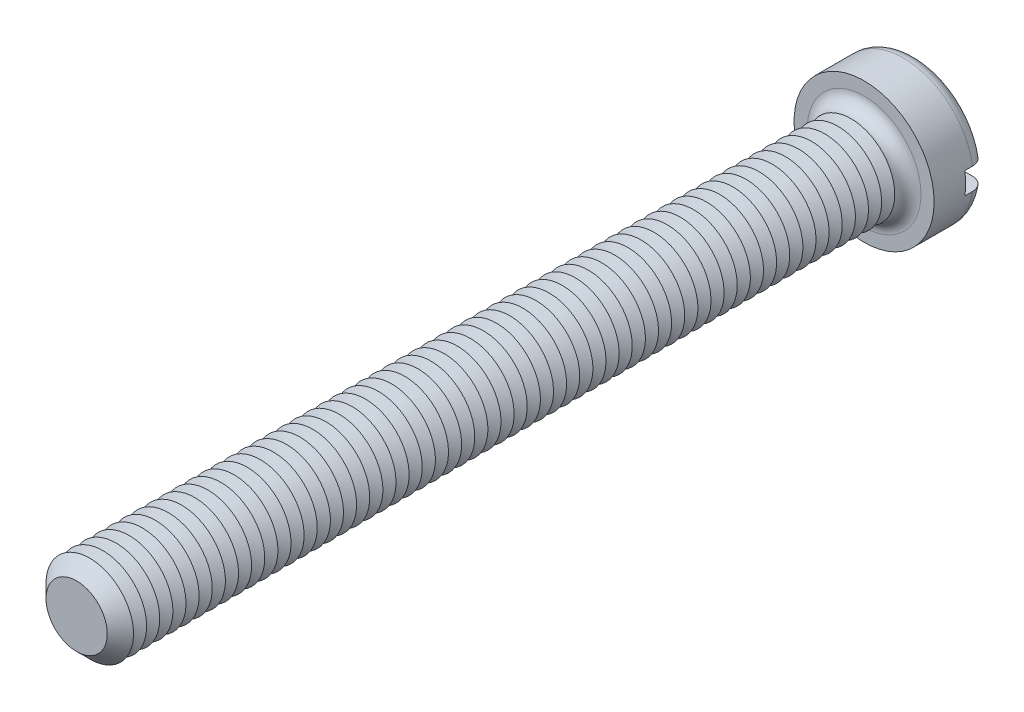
ISO-10303-21;
HEADER;
FILE_DESCRIPTION(('STEP AP214'),'2;1');
FILE_NAME('part.step','',(''),(''),'','','');
FILE_SCHEMA(('AUTOMOTIVE_DESIGN { 1 0 10303 214 1 1 1 1 }'));
ENDSEC;
DATA;
#1=APPLICATION_CONTEXT('core data for automotive mechanical design processes');
#2=APPLICATION_PROTOCOL_DEFINITION('international standard','automotive_design',2000,#1);
#3=PRODUCT_CONTEXT('',#1,'mechanical');
#4=PRODUCT('Part','Part','',(#3));
#5=PRODUCT_RELATED_PRODUCT_CATEGORY('part','',(#4));
#6=PRODUCT_DEFINITION_FORMATION('','',#4);
#7=PRODUCT_DEFINITION_CONTEXT('part definition',#1,'design');
#8=PRODUCT_DEFINITION('design','',#6,#7);
#9=PRODUCT_DEFINITION_SHAPE('','',#8);
#10=(LENGTH_UNIT() NAMED_UNIT(*) SI_UNIT(.MILLI.,.METRE.));
#11=(NAMED_UNIT(*) PLANE_ANGLE_UNIT() SI_UNIT($,.RADIAN.));
#12=(NAMED_UNIT(*) SI_UNIT($,.STERADIAN.) SOLID_ANGLE_UNIT());
#13=UNCERTAINTY_MEASURE_WITH_UNIT(LENGTH_MEASURE(1.E-05),#10,'distance_accuracy_value','');
#14=(GEOMETRIC_REPRESENTATION_CONTEXT(3) GLOBAL_UNCERTAINTY_ASSIGNED_CONTEXT((#13)) GLOBAL_UNIT_ASSIGNED_CONTEXT((#10,
#11,#12)) REPRESENTATION_CONTEXT('',''));
#15=CARTESIAN_POINT('',(0.,0.,0.));
#16=DIRECTION('',(0.,0.,1.));
#17=DIRECTION('',(1.,0.,0.));
#18=AXIS2_PLACEMENT_3D('',#15,#16,#17);
#19=CARTESIAN_POINT('',(0.,0.,-6.));
#20=DIRECTION('',(0.,0.,1.));
#21=DIRECTION('',(1.,0.,0.));
#22=AXIS2_PLACEMENT_3D('',#19,#20,#21);
#23=PLANE('',#22);
#24=CARTESIAN_POINT('',(0.,0.,-6.));
#25=DIRECTION('',(0.,0.,1.));
#26=DIRECTION('',(1.,0.,0.));
#27=AXIS2_PLACEMENT_3D('',#24,#25,#26);
#28=CIRCLE('',#27,6.5);
#29=CARTESIAN_POINT('',(-6.37867541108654,1.25,-6.));
#30=VERTEX_POINT('',#29);
#31=CARTESIAN_POINT('',(6.37867541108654,1.25,-6.));
#32=VERTEX_POINT('',#31);
#33=EDGE_CURVE('E116',#30,#32,#28,.F.);
#34=ORIENTED_EDGE('',*,*,#33,.T.);
#35=DIRECTION('',(1.,0.,0.));
#36=VECTOR('',#35,1.);
#37=CARTESIAN_POINT('',(-8.,1.25,-6.));
#38=LINE('',#37,#36);
#39=EDGE_CURVE('E111',#30,#32,#38,.T.);
#40=ORIENTED_EDGE('',*,*,#39,.F.);
#41=EDGE_LOOP('',(#34,#40));
#42=FACE_BOUND('',#41,.T.);
#43=ADVANCED_FACE('F39',(#42),#23,.F.);
#44=CARTESIAN_POINT('',(0.,0.,-4.5));
#45=DIRECTION('',(0.,0.,1.));
#46=DIRECTION('',(1.,0.,0.));
#47=AXIS2_PLACEMENT_3D('',#44,#45,#46);
#48=TOROIDAL_SURFACE('',#47,6.5,1.5);
#49=CARTESIAN_POINT('',(-7.63778128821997,1.25,-5.34492908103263));
#50=CARTESIAN_POINT('',(-7.58949199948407,1.25,-5.41482553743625));
#51=CARTESIAN_POINT('',(-7.53520056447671,1.25,-5.48065698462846));
#52=CARTESIAN_POINT('',(-7.41624971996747,1.25,-5.60228223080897));
#53=CARTESIAN_POINT('',(-7.35157642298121,1.25,-5.65806236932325));
#54=CARTESIAN_POINT('',(-7.21387612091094,1.25,-5.75795436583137));
#55=CARTESIAN_POINT('',(-7.14085828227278,1.25,-5.80207885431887));
#56=CARTESIAN_POINT('',(-6.98853766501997,1.25,-5.87758013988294));
#57=CARTESIAN_POINT('',(-6.90923642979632,1.25,-5.90896005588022));
#58=CARTESIAN_POINT('',(-6.74565677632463,1.25,-5.95849861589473));
#59=CARTESIAN_POINT('',(-6.66133328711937,1.25,-5.97650838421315));
#60=CARTESIAN_POINT('',(-6.49086565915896,1.25,-5.99833509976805));
#61=CARTESIAN_POINT('',(-6.40472129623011,1.25,-6.00215028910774));
#62=CARTESIAN_POINT('',(-6.23174891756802,1.25,-5.99550457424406));
#63=CARTESIAN_POINT('',(-6.14492874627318,1.25,-5.98483870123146));
#64=CARTESIAN_POINT('',(-5.97427268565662,1.25,-5.94920077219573));
#65=CARTESIAN_POINT('',(-5.89043699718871,1.25,-5.92422775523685));
#66=CARTESIAN_POINT('',(-5.72747580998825,1.25,-5.86041051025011));
#67=CARTESIAN_POINT('',(-5.64839123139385,1.25,-5.8214616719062));
#68=CARTESIAN_POINT('',(-5.49793182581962,1.25,-5.73076137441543));
#69=CARTESIAN_POINT('',(-5.42655700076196,1.25,-5.6790099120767));
#70=CARTESIAN_POINT('',(-5.29410028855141,1.25,-5.56444713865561));
#71=CARTESIAN_POINT('',(-5.23295591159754,1.25,-5.50170815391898));
#72=CARTESIAN_POINT('',(-5.12236155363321,1.25,-5.36664720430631));
#73=CARTESIAN_POINT('',(-5.07291010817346,1.25,-5.29432644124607));
#74=CARTESIAN_POINT('',(-4.98836421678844,1.25,-5.14389152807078));
#75=CARTESIAN_POINT('',(-4.95296843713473,1.25,-5.0659468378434));
#76=CARTESIAN_POINT('',(-4.89620356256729,1.25,-4.90510804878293));
#77=CARTESIAN_POINT('',(-4.87483169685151,1.25,-4.82221493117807));
#78=CARTESIAN_POINT('',(-4.8472995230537,1.25,-4.65636387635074));
#79=CARTESIAN_POINT('',(-4.84072446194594,1.25,-4.57347463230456));
#80=CARTESIAN_POINT('',(-4.84179430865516,1.25,-4.40779255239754));
#81=CARTESIAN_POINT('',(-4.84943782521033,1.25,-4.32499970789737));
#82=CARTESIAN_POINT('',(-4.87846819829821,1.25,-4.16301415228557));
#83=CARTESIAN_POINT('',(-4.89966978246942,1.25,-4.08378809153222));
#84=CARTESIAN_POINT('',(-4.95491528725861,1.25,-3.92995334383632));
#85=CARTESIAN_POINT('',(-4.98895983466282,1.25,-3.85534488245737));
#86=CARTESIAN_POINT('',(-5.06928242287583,1.25,-3.71183790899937));
#87=CARTESIAN_POINT('',(-5.11570495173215,1.25,-3.64302036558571));
#88=CARTESIAN_POINT('',(-5.21915370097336,1.25,-3.51388372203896));
#89=CARTESIAN_POINT('',(-5.27618132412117,1.25,-3.45356574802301));
#90=CARTESIAN_POINT('',(-5.40090076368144,1.25,-3.34137671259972));
#91=CARTESIAN_POINT('',(-5.46884305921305,1.25,-3.28978408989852));
#92=CARTESIAN_POINT('',(-5.61225757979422,1.25,-3.19841811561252));
#93=CARTESIAN_POINT('',(-5.68773079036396,1.25,-3.15864631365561));
#94=CARTESIAN_POINT('',(-5.84602026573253,1.25,-3.09111626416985));
#95=CARTESIAN_POINT('',(-5.92896901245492,1.25,-3.06366820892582));
#96=CARTESIAN_POINT('',(-6.09827849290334,1.25,-3.02294686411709));
#97=CARTESIAN_POINT('',(-6.18463944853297,1.25,-3.00967449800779));
#98=CARTESIAN_POINT('',(-6.35914138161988,1.25,-2.99765063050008));
#99=CARTESIAN_POINT('',(-6.4472913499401,1.25,-2.99902877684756));
#100=CARTESIAN_POINT('',(-6.62209547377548,1.25,-3.01665363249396));
#101=CARTESIAN_POINT('',(-6.70874965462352,1.25,-3.03290008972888));
#102=CARTESIAN_POINT('',(-6.87754008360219,1.25,-3.07975247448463));
#103=CARTESIAN_POINT('',(-6.95969991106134,1.25,-3.11027336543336));
#104=CARTESIAN_POINT('',(-7.11762200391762,1.25,-3.18486653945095));
#105=CARTESIAN_POINT('',(-7.19338469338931,1.25,-3.22893792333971));
#106=CARTESIAN_POINT('',(-7.33522754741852,1.25,-3.32873457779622));
#107=CARTESIAN_POINT('',(-7.40142768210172,1.25,-3.38428930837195));
#108=CARTESIAN_POINT('',(-7.52338344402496,1.25,-3.50587739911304));
#109=CARTESIAN_POINT('',(-7.5791399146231,1.25,-3.57190991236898));
#110=CARTESIAN_POINT('',(-7.67774856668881,1.25,-3.71151097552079));
#111=CARTESIAN_POINT('',(-7.72078137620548,1.25,-3.7849519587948));
#112=CARTESIAN_POINT('',(-7.79373860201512,1.25,-3.93807617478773));
#113=CARTESIAN_POINT('',(-7.82366445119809,1.25,-4.01775872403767));
#114=CARTESIAN_POINT('',(-7.86922494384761,1.25,-4.1801114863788));
#115=CARTESIAN_POINT('',(-7.88502105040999,1.25,-4.26273642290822));
#116=CARTESIAN_POINT('',(-7.90243332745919,1.25,-4.42948977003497));
#117=CARTESIAN_POINT('',(-7.90404643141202,1.25,-4.51361850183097));
#118=CARTESIAN_POINT('',(-7.89306914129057,1.25,-4.68049925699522));
#119=CARTESIAN_POINT('',(-7.88055163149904,1.25,-4.76325613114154));
#120=CARTESIAN_POINT('',(-7.84181179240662,1.25,-4.92542124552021));
#121=CARTESIAN_POINT('',(-7.81560657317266,1.25,-5.00483353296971));
#122=CARTESIAN_POINT('',(-7.76329893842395,1.25,-5.12766777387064));
#123=CARTESIAN_POINT('',(-7.74127773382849,1.25,-5.17287245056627));
#124=CARTESIAN_POINT('',(-7.69279783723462,1.25,-5.26083500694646));
#125=CARTESIAN_POINT('',(-7.66633917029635,1.25,-5.30359290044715));
#126=CARTESIAN_POINT('',(-7.63778128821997,1.25,-5.34492908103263));
#127=B_SPLINE_CURVE_WITH_KNOTS('',3,(#49,#50,#51,#52,#53,#54,#55,#56,#57,#58,#59,#60,#61,#62,
#63,#64,#65,#66,#67,#68,#69,#70,#71,#72,#73,#74,#75,#76,#77,#78,#79,#80,#81,#82,#83,#84,#85,#86,
#87,#88,#89,#90,#91,#92,#93,#94,#95,#96,#97,#98,#99,#100,#101,#102,#103,#104,#105,#106,#107,
#108,#109,#110,#111,#112,#113,#114,#115,#116,#117,#118,#119,#120,#121,#122,#123,#124,#125,#126),
.UNSPECIFIED.,.T.,.F.,(4,2,2,2,2,2,2,2,2,2,2,2,2,2,2,2,2,2,2,2,2,2,2,2,2,2,2,2,2,2,2,2,2,2,2,2,
2,2,4),(0.,0.254678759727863,0.509701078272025,0.764445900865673,1.01912834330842,
1.27660578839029,1.53411511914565,1.7953075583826,2.05651754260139,2.31972495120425,
2.58293242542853,2.84446831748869,3.10597143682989,3.36151874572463,3.61701554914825,
3.86525656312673,4.11347328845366,4.35836855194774,4.60327576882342,4.8511774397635,
5.0991119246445,5.35387584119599,5.60867314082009,5.86956650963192,6.13047687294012,
6.39369803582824,6.65691473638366,6.91858297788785,7.18023385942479,7.43824706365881,
7.69623942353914,7.95037087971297,8.20447454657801,8.45563599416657,8.70685174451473,
8.95677764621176,9.20639187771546,9.35700761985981,9.50762251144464),.UNSPECIFIED.);
#128=CARTESIAN_POINT('',(-7.90174031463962,1.25,-4.50000000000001));
#129=VERTEX_POINT('',#128);
#130=EDGE_CURVE('E643',#129,#30,#127,.T.);
#131=ORIENTED_EDGE('',*,*,#130,.F.);
#132=CARTESIAN_POINT('',(0.,0.,-4.5));
#133=DIRECTION('',(0.,0.,1.));
#134=DIRECTION('',(1.,0.,0.));
#135=AXIS2_PLACEMENT_3D('',#132,#133,#134);
#136=CIRCLE('',#135,8.);
#137=CARTESIAN_POINT('',(7.90174031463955,1.25,-4.5));
#138=VERTEX_POINT('',#137);
#139=EDGE_CURVE('E125',#138,#129,#136,.T.);
#140=ORIENTED_EDGE('',*,*,#139,.F.);
#141=CARTESIAN_POINT('',(4.95236709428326,1.25,-5.05808354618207));
#142=CARTESIAN_POINT('',(4.98477386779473,1.25,-5.13646278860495));
#143=CARTESIAN_POINT('',(5.02397623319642,1.25,-5.21210974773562));
#144=CARTESIAN_POINT('',(5.11464829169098,1.25,-5.35575180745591));
#145=CARTESIAN_POINT('',(5.16613670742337,1.25,-5.42373499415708));
#146=CARTESIAN_POINT('',(5.27963080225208,1.25,-5.55005899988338));
#147=CARTESIAN_POINT('',(5.34161871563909,1.25,-5.60841578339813));
#148=CARTESIAN_POINT('',(5.47431803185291,1.25,-5.71412381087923));
#149=CARTESIAN_POINT('',(5.545027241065,1.25,-5.76147781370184));
#150=CARTESIAN_POINT('',(5.69469818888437,1.25,-5.84486022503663));
#151=CARTESIAN_POINT('',(5.77379661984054,1.25,-5.88064336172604));
#152=CARTESIAN_POINT('',(5.93682776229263,1.25,-5.93863952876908));
#153=CARTESIAN_POINT('',(6.02076112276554,1.25,-5.96085073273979));
#154=CARTESIAN_POINT('',(6.19235911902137,1.25,-5.99130732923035));
#155=CARTESIAN_POINT('',(6.2800597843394,1.25,-5.99935025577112));
#156=CARTESIAN_POINT('',(6.45556807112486,1.25,-6.00057400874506));
#157=CARTESIAN_POINT('',(6.54337569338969,1.25,-5.99375472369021));
#158=CARTESIAN_POINT('',(6.71642471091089,1.25,-5.96539034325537));
#159=CARTESIAN_POINT('',(6.8016703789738,1.25,-5.94387137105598));
#160=CARTESIAN_POINT('',(6.96726399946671,1.25,-5.8866508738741));
#161=CARTESIAN_POINT('',(7.04761223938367,1.25,-5.85095018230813));
#162=CARTESIAN_POINT('',(7.2000703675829,1.25,-5.7668235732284));
#163=CARTESIAN_POINT('',(7.27226868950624,1.25,-5.71855796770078));
#164=CARTESIAN_POINT('',(7.40737382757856,1.25,-5.61041520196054));
#165=CARTESIAN_POINT('',(7.47028138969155,1.25,-5.55053897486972));
#166=CARTESIAN_POINT('',(7.5840004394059,1.25,-5.42185995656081));
#167=CARTESIAN_POINT('',(7.63498189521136,1.25,-5.35320736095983));
#168=CARTESIAN_POINT('',(7.72451646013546,1.25,-5.20822613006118));
#169=CARTESIAN_POINT('',(7.76307051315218,1.25,-5.13189807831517));
#170=CARTESIAN_POINT('',(7.82615156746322,1.25,-4.97479919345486));
#171=CARTESIAN_POINT('',(7.85085353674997,1.25,-4.89409858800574));
#172=CARTESIAN_POINT('',(7.88624162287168,1.25,-4.72968126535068));
#173=CARTESIAN_POINT('',(7.89692844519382,1.25,-4.64596470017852));
#174=CARTESIAN_POINT('',(7.90393395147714,1.25,-4.47857496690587));
#175=CARTESIAN_POINT('',(7.900361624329,1.25,-4.39490633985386));
#176=CARTESIAN_POINT('',(7.8792027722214,1.25,-4.22936201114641));
#177=CARTESIAN_POINT('',(7.86161649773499,1.25,-4.14748627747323));
#178=CARTESIAN_POINT('',(7.81298565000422,1.25,-3.98793539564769));
#179=CARTESIAN_POINT('',(7.78195585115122,1.25,-3.91025574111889));
#180=CARTESIAN_POINT('',(7.70736418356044,1.25,-3.76116938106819));
#181=CARTESIAN_POINT('',(7.66380211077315,1.25,-3.68976277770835));
#182=CARTESIAN_POINT('',(7.56515173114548,1.25,-3.55480889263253));
#183=CARTESIAN_POINT('',(7.51000119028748,1.25,-3.49130712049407));
#184=CARTESIAN_POINT('',(7.38992820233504,1.25,-3.3743390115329));
#185=CARTESIAN_POINT('',(7.32500529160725,1.25,-3.32087315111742));
#186=CARTESIAN_POINT('',(7.18646521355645,1.25,-3.22483712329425));
#187=CARTESIAN_POINT('',(7.11275872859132,1.25,-3.18239583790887));
#188=CARTESIAN_POINT('',(6.95934489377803,1.25,-3.11028530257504));
#189=CARTESIAN_POINT('',(6.87963710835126,1.25,-3.08061698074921));
#190=CARTESIAN_POINT('',(6.71523243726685,1.25,-3.03442872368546));
#191=CARTESIAN_POINT('',(6.63047940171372,1.25,-3.0181086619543));
#192=CARTESIAN_POINT('',(6.45944163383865,1.25,-2.99971307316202));
#193=CARTESIAN_POINT('',(6.37315677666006,1.25,-2.99763871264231));
#194=CARTESIAN_POINT('',(6.20021063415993,1.25,-3.00779604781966));
#195=CARTESIAN_POINT('',(6.11356117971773,1.25,-3.02022976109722));
#196=CARTESIAN_POINT('',(5.94354092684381,1.25,-3.05935975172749));
#197=CARTESIAN_POINT('',(5.86017035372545,1.25,-3.08605700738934));
#198=CARTESIAN_POINT('',(5.69848536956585,1.25,-3.15322746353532));
#199=CARTESIAN_POINT('',(5.62021039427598,1.25,-3.1937956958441));
#200=CARTESIAN_POINT('',(5.47164170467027,1.25,-3.28758816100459));
#201=CARTESIAN_POINT('',(5.40134797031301,1.25,-3.3408123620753));
#202=CARTESIAN_POINT('',(5.27136483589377,1.25,-3.45806317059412));
#203=CARTESIAN_POINT('',(5.21160120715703,1.25,-3.52200740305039));
#204=CARTESIAN_POINT('',(5.10396941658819,1.25,-3.65922833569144));
#205=CARTESIAN_POINT('',(5.05609917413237,1.25,-3.73250340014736));
#206=CARTESIAN_POINT('',(4.97487058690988,1.25,-3.8844714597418));
#207=CARTESIAN_POINT('',(4.94119529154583,1.25,-3.96299495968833));
#208=CARTESIAN_POINT('',(4.88793322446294,1.25,-4.12470694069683));
#209=CARTESIAN_POINT('',(4.86834741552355,1.25,-4.20789574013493));
#210=CARTESIAN_POINT('',(4.84433446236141,1.25,-4.3740749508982));
#211=CARTESIAN_POINT('',(4.83950391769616,1.25,-4.45700748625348));
#212=CARTESIAN_POINT('',(4.84404021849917,1.25,-4.62240731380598));
#213=CARTESIAN_POINT('',(4.85338770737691,1.25,-4.70487508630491));
#214=CARTESIAN_POINT('',(4.87895619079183,1.25,-4.83246978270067));
#215=CARTESIAN_POINT('',(4.89056704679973,1.25,-4.87856970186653));
#216=CARTESIAN_POINT('',(4.91819711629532,1.25,-4.96942661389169));
#217=CARTESIAN_POINT('',(4.93421619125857,1.25,-5.01418364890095));
#218=CARTESIAN_POINT('',(4.95236709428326,1.25,-5.05808354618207));
#219=B_SPLINE_CURVE_WITH_KNOTS('',3,(#141,#142,#143,#144,#145,#146,#147,#148,#149,#150,#151,
#152,#153,#154,#155,#156,#157,#158,#159,#160,#161,#162,#163,#164,#165,#166,#167,#168,#169,#170,
#171,#172,#173,#174,#175,#176,#177,#178,#179,#180,#181,#182,#183,#184,#185,#186,#187,#188,#189,
#190,#191,#192,#193,#194,#195,#196,#197,#198,#199,#200,#201,#202,#203,#204,#205,#206,#207,#208,
#209,#210,#211,#212,#213,#214,#215,#216,#217,#218),.UNSPECIFIED.,.T.,.F.,(4,2,2,2,2,2,2,2,2,2,2,
2,2,2,2,2,2,2,2,2,2,2,2,2,2,2,2,2,2,2,2,2,2,2,2,2,2,2,4),(0.,0.25426396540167,0.508917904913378,
0.763145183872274,1.01730864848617,1.27655188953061,1.53583000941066,1.79878406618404,
2.06174009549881,2.32423003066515,2.5867045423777,2.84598168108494,3.10523799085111,
3.36053725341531,3.61581712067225,3.8677953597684,4.11976091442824,4.36980428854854,
4.61984319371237,4.86960800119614,5.11937687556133,5.37052303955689,5.62168112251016,
5.87565515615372,6.12964764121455,6.38737709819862,6.64512765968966,6.90651052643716,
7.16791132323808,7.43114013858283,7.69436829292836,7.95565940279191,8.21690477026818,
8.47196060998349,8.72703387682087,8.97506819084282,9.22276418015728,9.36518087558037,
9.50759309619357),.UNSPECIFIED.);
#220=EDGE_CURVE('E645',#32,#138,#219,.T.);
#221=ORIENTED_EDGE('',*,*,#220,.F.);
#222=ORIENTED_EDGE('',*,*,#33,.F.);
#223=EDGE_LOOP('',(#131,#140,#221,#222));
#224=FACE_BOUND('',#223,.T.);
#225=ADVANCED_FACE('F627',(#224),#48,.T.);
#226=CARTESIAN_POINT('',(0.,0.,-6.));
#227=DIRECTION('',(0.,0.,1.));
#228=DIRECTION('',(1.,0.,0.));
#229=AXIS2_PLACEMENT_3D('',#226,#227,#228);
#230=CYLINDRICAL_SURFACE('',#229,8.);
#231=DIRECTION('',(0.,0.,1.));
#232=VECTOR('',#231,1.);
#233=CARTESIAN_POINT('',(7.90174031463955,1.25,-6.));
#234=LINE('',#233,#232);
#235=CARTESIAN_POINT('',(7.90174031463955,1.25,-3.6));
#236=VERTEX_POINT('',#235);
#237=EDGE_CURVE('E660',#138,#236,#234,.T.);
#238=ORIENTED_EDGE('',*,*,#237,.F.);
#239=ORIENTED_EDGE('',*,*,#139,.T.);
#240=DIRECTION('',(0.,0.,1.));
#241=VECTOR('',#240,1.);
#242=CARTESIAN_POINT('',(-7.90174031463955,1.25,-6.));
#243=LINE('',#242,#241);
#244=CARTESIAN_POINT('',(-7.90174031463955,1.25,-3.6));
#245=VERTEX_POINT('',#244);
#246=EDGE_CURVE('E63',#245,#129,#243,.F.);
#247=ORIENTED_EDGE('',*,*,#246,.F.);
#248=CARTESIAN_POINT('',(0.,0.,-3.6));
#249=DIRECTION('',(0.,0.,-1.));
#250=DIRECTION('',(-1.,0.,0.));
#251=AXIS2_PLACEMENT_3D('',#248,#249,#250);
#252=CIRCLE('',#251,8.);
#253=CARTESIAN_POINT('',(-7.90174031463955,-1.25,-3.6));
#254=VERTEX_POINT('',#253);
#255=EDGE_CURVE('E43',#245,#254,#252,.F.);
#256=ORIENTED_EDGE('',*,*,#255,.T.);
#257=DIRECTION('',(0.,0.,1.));
#258=VECTOR('',#257,1.);
#259=CARTESIAN_POINT('',(-7.90174031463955,-1.25,-6.));
#260=LINE('',#259,#258);
#261=CARTESIAN_POINT('',(-7.9017403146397,-1.25,-4.49999999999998));
#262=VERTEX_POINT('',#261);
#263=EDGE_CURVE('E657',#262,#254,#260,.T.);
#264=ORIENTED_EDGE('',*,*,#263,.F.);
#265=CARTESIAN_POINT('',(7.90174031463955,-1.25,-4.5));
#266=VERTEX_POINT('',#265);
#267=EDGE_CURVE('E127',#262,#266,#136,.T.);
#268=ORIENTED_EDGE('',*,*,#267,.T.);
#269=DIRECTION('',(0.,0.,1.));
#270=VECTOR('',#269,1.);
#271=CARTESIAN_POINT('',(7.90174031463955,-1.25,-6.));
#272=LINE('',#271,#270);
#273=CARTESIAN_POINT('',(7.90174031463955,-1.25,-3.6));
#274=VERTEX_POINT('',#273);
#275=EDGE_CURVE('E55',#274,#266,#272,.F.);
#276=ORIENTED_EDGE('',*,*,#275,.F.);
#277=EDGE_CURVE('E11',#274,#236,#252,.F.);
#278=ORIENTED_EDGE('',*,*,#277,.T.);
#279=EDGE_LOOP('',(#238,#239,#247,#256,#264,#268,#276,#278));
#280=FACE_BOUND('',#279,.T.);
#281=CARTESIAN_POINT('',(0.,0.,0.));
#282=DIRECTION('',(0.,0.,1.));
#283=DIRECTION('',(1.,0.,0.));
#284=AXIS2_PLACEMENT_3D('',#281,#282,#283);
#285=CIRCLE('',#284,8.);
#286=CARTESIAN_POINT('',(8.,0.,0.));
#287=VERTEX_POINT('',#286);
#288=EDGE_CURVE('E663',#287,#287,#285,.T.);
#289=ORIENTED_EDGE('',*,*,#288,.F.);
#290=EDGE_LOOP('',(#289));
#291=FACE_BOUND('',#290,.T.);
#292=ADVANCED_FACE('F623',(#280,#291),#230,.T.);
#293=CARTESIAN_POINT('',(6.37867541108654,-1.25,-6.));
#294=VERTEX_POINT('',#293);
#295=CARTESIAN_POINT('',(-6.37867541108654,-1.25,-6.));
#296=VERTEX_POINT('',#295);
#297=EDGE_CURVE('E109',#294,#296,#28,.F.);
#298=ORIENTED_EDGE('',*,*,#297,.T.);
#299=DIRECTION('',(-1.,0.,0.));
#300=VECTOR('',#299,1.);
#301=CARTESIAN_POINT('',(-8.,-1.25,-6.));
#302=LINE('',#301,#300);
#303=EDGE_CURVE('E96',#294,#296,#302,.T.);
#304=ORIENTED_EDGE('',*,*,#303,.F.);
#305=EDGE_LOOP('',(#298,#304));
#306=FACE_BOUND('',#305,.T.);
#307=ADVANCED_FACE('F108',(#306),#23,.F.);
#308=CARTESIAN_POINT('',(0.,0.,0.));
#309=DIRECTION('',(0.,0.,1.));
#310=DIRECTION('',(1.,0.,0.));
#311=AXIS2_PLACEMENT_3D('',#308,#309,#310);
#312=PLANE('',#311);
#313=CARTESIAN_POINT('',(0.,0.,0.));
#314=DIRECTION('',(0.,0.,1.));
#315=DIRECTION('',(1.,0.,0.));
#316=AXIS2_PLACEMENT_3D('',#313,#314,#315);
#317=CIRCLE('',#316,6.5);
#318=CARTESIAN_POINT('',(6.5,0.,0.));
#319=VERTEX_POINT('',#318);
#320=EDGE_CURVE('E115',#319,#319,#317,.F.);
#321=ORIENTED_EDGE('',*,*,#320,.T.);
#322=EDGE_LOOP('',(#321));
#323=FACE_BOUND('',#322,.T.);
#324=ORIENTED_EDGE('',*,*,#288,.T.);
#325=EDGE_LOOP('',(#324));
#326=FACE_BOUND('',#325,.T.);
#327=ADVANCED_FACE('F622',(#323,#326),#312,.T.);
#328=CARTESIAN_POINT('',(-7.63778128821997,-1.25,-5.34492908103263));
#329=CARTESIAN_POINT('',(-7.68527581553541,-1.25,-5.27616964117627));
#330=CARTESIAN_POINT('',(-7.72703224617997,-1.25,-5.20337764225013));
#331=CARTESIAN_POINT('',(-7.79778035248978,-1.25,-5.05176511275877));
#332=CARTESIAN_POINT('',(-7.82675823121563,-1.25,-4.97293817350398));
#333=CARTESIAN_POINT('',(-7.87103239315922,-1.25,-4.81153865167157));
#334=CARTESIAN_POINT('',(-7.8863313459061,-1.25,-4.72896680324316));
#335=CARTESIAN_POINT('',(-7.90278562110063,-1.25,-4.56244566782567));
#336=CARTESIAN_POINT('',(-7.90394420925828,-1.25,-4.4784967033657));
#337=CARTESIAN_POINT('',(-7.89211470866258,-1.25,-4.31190980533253));
#338=CARTESIAN_POINT('',(-7.87917806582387,-1.25,-4.22926821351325));
#339=CARTESIAN_POINT('',(-7.8396278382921,-1.25,-4.06732477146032));
#340=CARTESIAN_POINT('',(-7.81301388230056,-1.25,-3.98802301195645));
#341=CARTESIAN_POINT('',(-7.74686575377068,-1.25,-3.83490116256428));
#342=CARTESIAN_POINT('',(-7.70731700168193,-1.25,-3.76108737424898));
#343=CARTESIAN_POINT('',(-7.61647675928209,-1.25,-3.62108231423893));
#344=CARTESIAN_POINT('',(-7.56518496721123,-1.25,-3.55489123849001));
#345=CARTESIAN_POINT('',(-7.45192141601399,-1.25,-3.43145488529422));
#346=CARTESIAN_POINT('',(-7.3898717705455,-1.25,-3.37428109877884));
#347=CARTESIAN_POINT('',(-7.25715883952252,-1.25,-3.27100737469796));
#348=CARTESIAN_POINT('',(-7.18649507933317,-1.25,-3.22490804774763));
#349=CARTESIAN_POINT('',(-7.03760898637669,-1.25,-3.14445316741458));
#350=CARTESIAN_POINT('',(-6.95930204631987,-1.25,-3.1102542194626));
#351=CARTESIAN_POINT('',(-6.79811453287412,-1.25,-3.05526915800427));
#352=CARTESIAN_POINT('',(-6.71523359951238,-1.25,-3.03448410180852));
#353=CARTESIAN_POINT('',(-6.5459165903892,-1.25,-3.006592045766));
#354=CARTESIAN_POINT('',(-6.45944575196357,-1.25,-2.99969602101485));
#355=CARTESIAN_POINT('',(-6.28655568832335,-1.25,-3.00032465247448));
#356=CARTESIAN_POINT('',(-6.20013646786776,-1.25,-3.00785047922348));
#357=CARTESIAN_POINT('',(-6.02865505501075,-1.25,-3.03725742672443));
#358=CARTESIAN_POINT('',(-5.94362352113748,-1.25,-3.05931758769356));
#359=CARTESIAN_POINT('',(-5.77844448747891,-1.25,-3.11735373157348));
#360=CARTESIAN_POINT('',(-5.69829723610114,-1.25,-3.15333042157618));
#361=CARTESIAN_POINT('',(-5.54495924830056,-1.25,-3.23837037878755));
#362=CARTESIAN_POINT('',(-5.47178958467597,-1.25,-3.28747168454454));
#363=CARTESIAN_POINT('',(-5.33486536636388,-1.25,-3.39741183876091));
#364=CARTESIAN_POINT('',(-5.27111040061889,-1.25,-3.45825017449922));
#365=CARTESIAN_POINT('',(-5.15579778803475,-1.25,-3.58914722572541));
#366=CARTESIAN_POINT('',(-5.10409113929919,-1.25,-3.65907455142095));
#367=CARTESIAN_POINT('',(-5.01353659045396,-1.25,-3.8068142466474));
#368=CARTESIAN_POINT('',(-4.97468647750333,-1.25,-3.88462525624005));
#369=CARTESIAN_POINT('',(-4.91208858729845,-1.25,-4.04366636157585));
#370=CARTESIAN_POINT('',(-4.88795969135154,-1.25,-4.12474643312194));
#371=CARTESIAN_POINT('',(-4.85404909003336,-1.25,-4.28985038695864));
#372=CARTESIAN_POINT('',(-4.84426486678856,-1.25,-4.37387374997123));
#373=CARTESIAN_POINT('',(-4.83946276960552,-1.25,-4.54023897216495));
#374=CARTESIAN_POINT('',(-4.8440833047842,-1.25,-4.62257060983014));
#375=CARTESIAN_POINT('',(-4.86713763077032,-1.25,-4.78527148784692));
#376=CARTESIAN_POINT('',(-4.88557092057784,-1.25,-4.86564079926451));
#377=CARTESIAN_POINT('',(-4.9355229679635,-1.25,-5.02189555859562));
#378=CARTESIAN_POINT('',(-4.9669975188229,-1.25,-5.09779517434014));
#379=CARTESIAN_POINT('',(-5.04199393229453,-1.25,-5.24338322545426));
#380=CARTESIAN_POINT('',(-5.0855168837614,-1.25,-5.31307109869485));
#381=CARTESIAN_POINT('',(-5.18427540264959,-1.25,-5.44580979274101));
#382=CARTESIAN_POINT('',(-5.2397318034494,-1.25,-5.50869620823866));
#383=CARTESIAN_POINT('',(-5.36015301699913,-1.25,-5.62458635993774));
#384=CARTESIAN_POINT('',(-5.42511919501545,-1.25,-5.67758867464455));
#385=CARTESIAN_POINT('',(-5.56469412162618,-1.25,-5.7737610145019));
#386=CARTESIAN_POINT('',(-5.6395232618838,-1.25,-5.81661133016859));
#387=CARTESIAN_POINT('',(-5.79521544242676,-1.25,-5.8894110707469));
#388=CARTESIAN_POINT('',(-5.8760791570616,-1.25,-5.91935905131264));
#389=CARTESIAN_POINT('',(-6.04317815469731,-1.25,-5.9660059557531));
#390=CARTESIAN_POINT('',(-6.12948555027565,-1.25,-5.98244700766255));
#391=CARTESIAN_POINT('',(-6.30363462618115,-1.25,-6.00064866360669));
#392=CARTESIAN_POINT('',(-6.39147629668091,-1.25,-6.00240936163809));
#393=CARTESIAN_POINT('',(-6.5664192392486,-1.25,-5.9911248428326));
#394=CARTESIAN_POINT('',(-6.653518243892,-1.25,-5.9780442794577));
#395=CARTESIAN_POINT('',(-6.82426167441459,-1.25,-5.93729204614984));
#396=CARTESIAN_POINT('',(-6.90790538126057,-1.25,-5.90961735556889));
#397=CARTESIAN_POINT('',(-7.06846412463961,-1.25,-5.84071272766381));
#398=CARTESIAN_POINT('',(-7.14543542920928,-1.25,-5.79961377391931));
#399=CARTESIAN_POINT('',(-7.29116896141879,-1.25,-5.70491210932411));
#400=CARTESIAN_POINT('',(-7.35994165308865,-1.25,-5.65132560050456));
#401=CARTESIAN_POINT('',(-7.46362894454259,-1.25,-5.55509815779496));
#402=CARTESIAN_POINT('',(-7.50165191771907,-1.25,-5.51575032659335));
#403=CARTESIAN_POINT('',(-7.57319530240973,-1.25,-5.43315308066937));
#404=CARTESIAN_POINT('',(-7.60671575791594,-1.25,-5.38990370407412));
#405=CARTESIAN_POINT('',(-7.63778128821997,-1.25,-5.34492908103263));
#406=B_SPLINE_CURVE_WITH_KNOTS('',3,(#328,#329,#330,#331,#332,#333,#334,#335,#336,#337,#338,
#339,#340,#341,#342,#343,#344,#345,#346,#347,#348,#349,#350,#351,#352,#353,#354,#355,#356,#357,
#358,#359,#360,#361,#362,#363,#364,#365,#366,#367,#368,#369,#370,#371,#372,#373,#374,#375,#376,
#377,#378,#379,#380,#381,#382,#383,#384,#385,#386,#387,#388,#389,#390,#391,#392,#393,#394,#395,
#396,#397,#398,#399,#400,#401,#402,#403,#404,#405),.UNSPECIFIED.,.T.,.F.,(4,2,2,2,2,2,2,2,2,2,2,
2,2,2,2,2,2,2,2,2,2,2,2,2,2,2,2,2,2,2,2,2,2,2,2,2,2,2,4),(0.,0.250506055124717,
0.501281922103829,0.752008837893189,1.00267784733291,1.25243500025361,1.50219893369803,
1.75224536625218,2.00229822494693,2.25424343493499,2.50620253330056,2.76136198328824,
3.01654154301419,3.27556891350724,3.53461730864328,3.79691797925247,4.05923197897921,
4.32231463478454,4.5853858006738,4.84500678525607,5.10458306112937,5.3571172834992,
5.60960717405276,5.85581050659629,6.10200490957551,6.34737151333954,6.59276029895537,
6.84315522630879,7.09358613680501,7.35108485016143,7.60861238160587,7.87094926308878,
8.13328446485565,8.39624576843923,8.65926152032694,8.91978401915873,9.17997036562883,
9.34382460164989,9.50767723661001),.UNSPECIFIED.);
#407=EDGE_CURVE('E103',#296,#262,#406,.T.);
#408=ORIENTED_EDGE('',*,*,#407,.F.);
#409=ORIENTED_EDGE('',*,*,#297,.F.);
#410=CARTESIAN_POINT('',(4.95236709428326,-1.25,-5.05808354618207));
#411=CARTESIAN_POINT('',(4.92105512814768,-1.25,-4.98233216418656));
#412=CARTESIAN_POINT('',(4.89604361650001,-1.25,-4.90392040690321));
#413=CARTESIAN_POINT('',(4.85951223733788,-1.25,-4.74395758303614));
#414=CARTESIAN_POINT('',(4.8480045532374,-1.25,-4.66240375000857));
#415=CARTESIAN_POINT('',(4.83891469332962,-1.25,-4.49852199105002));
#416=CARTESIAN_POINT('',(4.84133145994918,-1.25,-4.41619412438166));
#417=CARTESIAN_POINT('',(4.8600038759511,-1.25,-4.25314313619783));
#418=CARTESIAN_POINT('',(4.87625705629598,-1.25,-4.17241973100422));
#419=CARTESIAN_POINT('',(4.92196554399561,-1.25,-4.01505032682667));
#420=CARTESIAN_POINT('',(4.95138456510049,-1.25,-3.93839376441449));
#421=CARTESIAN_POINT('',(5.02244158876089,-1.25,-3.79097367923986));
#422=CARTESIAN_POINT('',(5.06408092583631,-1.25,-3.72021080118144));
#423=CARTESIAN_POINT('',(5.15918188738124,-1.25,-3.5851203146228));
#424=CARTESIAN_POINT('',(5.21285223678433,-1.25,-3.5209397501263));
#425=CARTESIAN_POINT('',(5.32993512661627,-1.25,-3.40218700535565));
#426=CARTESIAN_POINT('',(5.39334903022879,-1.25,-3.34761617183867));
#427=CARTESIAN_POINT('',(5.5300552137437,-1.25,-3.24801679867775));
#428=CARTESIAN_POINT('',(5.60357647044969,-1.25,-3.20330242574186));
#429=CARTESIAN_POINT('',(5.75697062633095,-1.25,-3.1265687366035));
#430=CARTESIAN_POINT('',(5.83684424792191,-1.25,-3.09455086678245));
#431=CARTESIAN_POINT('',(6.00239031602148,-1.25,-3.04353393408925));
#432=CARTESIAN_POINT('',(6.08814636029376,-1.25,-3.02480570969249));
#433=CARTESIAN_POINT('',(6.26158564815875,-1.25,-3.00194915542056));
#434=CARTESIAN_POINT('',(6.34926896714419,-1.25,-2.997821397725));
#435=CARTESIAN_POINT('',(6.52441816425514,-1.25,-3.00435236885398));
#436=CARTESIAN_POINT('',(6.61188199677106,-1.25,-3.01506655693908));
#437=CARTESIAN_POINT('',(6.78373130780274,-1.25,-3.05116556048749));
#438=CARTESIAN_POINT('',(6.8681168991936,-1.25,-3.07654983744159));
#439=CARTESIAN_POINT('',(7.03056473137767,-1.25,-3.14105639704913));
#440=CARTESIAN_POINT('',(7.10867812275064,-1.25,-3.18004978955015));
#441=CARTESIAN_POINT('',(7.25711285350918,-1.25,-3.27078804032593));
#442=CARTESIAN_POINT('',(7.327434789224,-1.25,-3.32253192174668));
#443=CARTESIAN_POINT('',(7.45716954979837,-1.25,-3.4364775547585));
#444=CARTESIAN_POINT('',(7.51672925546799,-1.25,-3.49851206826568));
#445=CARTESIAN_POINT('',(7.62440498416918,-1.25,-3.63182557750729));
#446=CARTESIAN_POINT('',(7.67252193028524,-1.25,-3.70310382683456));
#447=CARTESIAN_POINT('',(7.75523498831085,-1.25,-3.8517825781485));
#448=CARTESIAN_POINT('',(7.79001407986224,-1.25,-3.92908131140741));
#449=CARTESIAN_POINT('',(7.84595474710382,-1.25,-4.08845836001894));
#450=CARTESIAN_POINT('',(7.86711715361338,-1.25,-4.1705363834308));
#451=CARTESIAN_POINT('',(7.89503817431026,-1.25,-4.3362768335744));
#452=CARTESIAN_POINT('',(7.90193595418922,-1.25,-4.41991584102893));
#453=CARTESIAN_POINT('',(7.90153623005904,-1.25,-4.58715860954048));
#454=CARTESIAN_POINT('',(7.89423915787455,-1.25,-4.67076237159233));
#455=CARTESIAN_POINT('',(7.86572271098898,-1.25,-4.83525080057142));
#456=CARTESIAN_POINT('',(7.84455307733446,-1.25,-4.91614410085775));
#457=CARTESIAN_POINT('',(7.78897430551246,-1.25,-5.0732444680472));
#458=CARTESIAN_POINT('',(7.75456511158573,-1.25,-5.1494515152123));
#459=CARTESIAN_POINT('',(7.67339923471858,-1.25,-5.29528903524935));
#460=CARTESIAN_POINT('',(7.62660424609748,-1.25,-5.36489817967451));
#461=CARTESIAN_POINT('',(7.52209201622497,-1.25,-5.49536318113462));
#462=CARTESIAN_POINT('',(7.4643743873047,-1.25,-5.55621872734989));
#463=CARTESIAN_POINT('',(7.33909994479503,-1.25,-5.66807257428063));
#464=CARTESIAN_POINT('',(7.27145672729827,-1.25,-5.71897407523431));
#465=CARTESIAN_POINT('',(7.12868060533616,-1.25,-5.80887807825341));
#466=CARTESIAN_POINT('',(7.0535472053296,-1.25,-5.84787979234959));
#467=CARTESIAN_POINT('',(6.89682225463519,-1.25,-5.91345911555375));
#468=CARTESIAN_POINT('',(6.81515596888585,-1.25,-5.93985808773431));
#469=CARTESIAN_POINT('',(6.64858434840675,-1.25,-5.97879449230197));
#470=CARTESIAN_POINT('',(6.56367874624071,-1.25,-5.99133077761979));
#471=CARTESIAN_POINT('',(6.39168259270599,-1.25,-6.00236627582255));
#472=CARTESIAN_POINT('',(6.30457835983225,-1.25,-6.00065255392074));
#473=CARTESIAN_POINT('',(6.13186422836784,-1.25,-5.98278857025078));
#474=CARTESIAN_POINT('',(6.04625438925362,-1.25,-5.96663773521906));
#475=CARTESIAN_POINT('',(5.87802521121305,-1.25,-5.92012173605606));
#476=CARTESIAN_POINT('',(5.79544617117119,-1.25,-5.88961066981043));
#477=CARTESIAN_POINT('',(5.63656223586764,-1.25,-5.81513349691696));
#478=CARTESIAN_POINT('',(5.56025908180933,-1.25,-5.77116367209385));
#479=CARTESIAN_POINT('',(5.4162607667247,-1.25,-5.67098882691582));
#480=CARTESIAN_POINT('',(5.34855795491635,-1.25,-5.61479480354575));
#481=CARTESIAN_POINT('',(5.22382615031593,-1.25,-5.49168804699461));
#482=CARTESIAN_POINT('',(5.16678340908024,-1.25,-5.42478932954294));
#483=CARTESIAN_POINT('',(5.08326589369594,-1.25,-5.3075481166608));
#484=CARTESIAN_POINT('',(5.05313168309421,-1.25,-5.25976959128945));
#485=CARTESIAN_POINT('',(4.99845900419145,-1.25,-5.16110869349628));
#486=CARTESIAN_POINT('',(4.9739204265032,-1.25,-5.11022638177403));
#487=CARTESIAN_POINT('',(4.95236709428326,-1.25,-5.05808354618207));
#488=B_SPLINE_CURVE_WITH_KNOTS('',3,(#410,#411,#412,#413,#414,#415,#416,#417,#418,#419,#420,
#421,#422,#423,#424,#425,#426,#427,#428,#429,#430,#431,#432,#433,#434,#435,#436,#437,#438,#439,
#440,#441,#442,#443,#444,#445,#446,#447,#448,#449,#450,#451,#452,#453,#454,#455,#456,#457,#458,
#459,#460,#461,#462,#463,#464,#465,#466,#467,#468,#469,#470,#471,#472,#473,#474,#475,#476,#477,
#478,#479,#480,#481,#482,#483,#484,#485,#486,#487),.UNSPECIFIED.,.T.,.F.,(4,2,2,2,2,2,2,2,2,2,2,
2,2,2,2,2,2,2,2,2,2,2,2,2,2,2,2,2,2,2,2,2,2,2,2,2,2,2,4),(0.,0.245701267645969,
0.491624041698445,0.737528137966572,0.983388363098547,1.22857510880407,1.47378864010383,
1.72364048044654,1.97352730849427,2.2304941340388,2.48749022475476,2.74958408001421,
3.01168820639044,3.2747743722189,3.53785088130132,3.79850056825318,4.05913029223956,
4.31587819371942,4.57260537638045,4.82567253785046,5.07872425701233,5.32929532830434,
5.57985877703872,5.82952869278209,6.07919966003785,6.32965199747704,6.58011322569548,
6.8329006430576,7.08570479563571,7.3419930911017,7.59830259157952,7.85844887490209,
8.11860548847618,8.38146435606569,8.64439590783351,8.90709189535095,9.16944670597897,
9.33857644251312,9.5077028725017),.UNSPECIFIED.);
#489=EDGE_CURVE('E92',#266,#294,#488,.T.);
#490=ORIENTED_EDGE('',*,*,#489,.F.);
#491=ORIENTED_EDGE('',*,*,#267,.F.);
#492=EDGE_LOOP('',(#408,#409,#490,#491));
#493=FACE_BOUND('',#492,.T.);
#494=ADVANCED_FACE('F113',(#493),#48,.T.);
#495=CARTESIAN_POINT('',(0.,0.,1.5));
#496=DIRECTION('',(0.,0.,1.));
#497=DIRECTION('',(1.,0.,0.));
#498=AXIS2_PLACEMENT_3D('',#495,#496,#497);
#499=TOROIDAL_SURFACE('',#498,6.5,1.5);
#500=ORIENTED_EDGE('',*,*,#320,.F.);
#501=EDGE_LOOP('',(#500));
#502=FACE_BOUND('',#501,.T.);
#503=CARTESIAN_POINT('',(0.,0.,1.5));
#504=DIRECTION('',(0.,0.,-1.));
#505=DIRECTION('',(-1.,0.,0.));
#506=AXIS2_PLACEMENT_3D('',#503,#504,#505);
#507=CIRCLE('',#506,5.);
#508=CARTESIAN_POINT('',(-5.,0.,1.5));
#509=VERTEX_POINT('',#508);
#510=EDGE_CURVE('E668',#509,#509,#507,.T.);
#511=ORIENTED_EDGE('',*,*,#510,.T.);
#512=EDGE_LOOP('',(#511));
#513=FACE_BOUND('',#512,.T.);
#514=ADVANCED_FACE('F615',(#502,#513),#499,.F.);
#515=CARTESIAN_POINT('',(0.,0.,2.25));
#516=DIRECTION('',(0.,0.,-1.));
#517=DIRECTION('',(-1.,0.,0.));
#518=AXIS2_PLACEMENT_3D('',#515,#516,#517);
#519=CONICAL_SURFACE('',#518,3.70096189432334,1.0471975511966);
#520=ORIENTED_EDGE('',*,*,#510,.F.);
#521=EDGE_LOOP('',(#520));
#522=FACE_BOUND('',#521,.T.);
#523=CARTESIAN_POINT('',(0.,0.,2.25));
#524=DIRECTION('',(0.,0.,-1.));
#525=DIRECTION('',(-1.,0.,0.));
#526=AXIS2_PLACEMENT_3D('',#523,#524,#525);
#527=CIRCLE('',#526,3.70096189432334);
#528=CARTESIAN_POINT('',(-3.70096189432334,0.,2.25));
#529=VERTEX_POINT('',#528);
#530=EDGE_CURVE('E674',#529,#529,#527,.T.);
#531=ORIENTED_EDGE('',*,*,#530,.T.);
#532=EDGE_LOOP('',(#531));
#533=FACE_BOUND('',#532,.T.);
#534=ADVANCED_FACE('F611',(#522,#533),#519,.T.);
#535=CARTESIAN_POINT('',(0.,0.,3.));
#536=DIRECTION('',(0.,0.,1.));
#537=DIRECTION('',(1.,0.,0.));
#538=AXIS2_PLACEMENT_3D('',#535,#536,#537);
#539=CONICAL_SURFACE('',#538,5.,1.0471975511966);
#540=ORIENTED_EDGE('',*,*,#530,.F.);
#541=EDGE_LOOP('',(#540));
#542=FACE_BOUND('',#541,.T.);
#543=CARTESIAN_POINT('',(0.,0.,3.));
#544=DIRECTION('',(0.,0.,-1.));
#545=DIRECTION('',(-1.,0.,0.));
#546=AXIS2_PLACEMENT_3D('',#543,#544,#545);
#547=CIRCLE('',#546,5.);
#548=CARTESIAN_POINT('',(-5.,0.,3.));
#549=VERTEX_POINT('',#548);
#550=EDGE_CURVE('E680',#549,#549,#547,.T.);
#551=ORIENTED_EDGE('',*,*,#550,.T.);
#552=EDGE_LOOP('',(#551));
#553=FACE_BOUND('',#552,.T.);
#554=ADVANCED_FACE('F607',(#542,#553),#539,.T.);
#555=CARTESIAN_POINT('',(0.,0.,3.75));
#556=DIRECTION('',(0.,0.,-1.));
#557=DIRECTION('',(-1.,0.,0.));
#558=AXIS2_PLACEMENT_3D('',#555,#556,#557);
#559=CONICAL_SURFACE('',#558,3.70096189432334,1.0471975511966);
#560=ORIENTED_EDGE('',*,*,#550,.F.);
#561=EDGE_LOOP('',(#560));
#562=FACE_BOUND('',#561,.T.);
#563=CARTESIAN_POINT('',(0.,0.,3.75));
#564=DIRECTION('',(0.,0.,-1.));
#565=DIRECTION('',(-1.,0.,0.));
#566=AXIS2_PLACEMENT_3D('',#563,#564,#565);
#567=CIRCLE('',#566,3.70096189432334);
#568=CARTESIAN_POINT('',(-3.70096189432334,0.,3.75));
#569=VERTEX_POINT('',#568);
#570=EDGE_CURVE('E684',#569,#569,#567,.T.);
#571=ORIENTED_EDGE('',*,*,#570,.T.);
#572=EDGE_LOOP('',(#571));
#573=FACE_BOUND('',#572,.T.);
#574=ADVANCED_FACE('F603',(#562,#573),#559,.T.);
#575=CARTESIAN_POINT('',(0.,0.,4.5));
#576=DIRECTION('',(0.,0.,1.));
#577=DIRECTION('',(1.,0.,0.));
#578=AXIS2_PLACEMENT_3D('',#575,#576,#577);
#579=CONICAL_SURFACE('',#578,5.,1.0471975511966);
#580=ORIENTED_EDGE('',*,*,#570,.F.);
#581=EDGE_LOOP('',(#580));
#582=FACE_BOUND('',#581,.T.);
#583=CARTESIAN_POINT('',(0.,0.,4.5));
#584=DIRECTION('',(0.,0.,-1.));
#585=DIRECTION('',(-1.,0.,0.));
#586=AXIS2_PLACEMENT_3D('',#583,#584,#585);
#587=CIRCLE('',#586,5.);
#588=CARTESIAN_POINT('',(-5.,0.,4.5));
#589=VERTEX_POINT('',#588);
#590=EDGE_CURVE('E688',#589,#589,#587,.T.);
#591=ORIENTED_EDGE('',*,*,#590,.T.);
#592=EDGE_LOOP('',(#591));
#593=FACE_BOUND('',#592,.T.);
#594=ADVANCED_FACE('F599',(#582,#593),#579,.T.);
#595=CARTESIAN_POINT('',(0.,0.,5.25));
#596=DIRECTION('',(0.,0.,-1.));
#597=DIRECTION('',(-1.,0.,0.));
#598=AXIS2_PLACEMENT_3D('',#595,#596,#597);
#599=CONICAL_SURFACE('',#598,3.70096189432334,1.0471975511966);
#600=ORIENTED_EDGE('',*,*,#590,.F.);
#601=EDGE_LOOP('',(#600));
#602=FACE_BOUND('',#601,.T.);
#603=CARTESIAN_POINT('',(0.,0.,5.25));
#604=DIRECTION('',(0.,0.,-1.));
#605=DIRECTION('',(-1.,0.,0.));
#606=AXIS2_PLACEMENT_3D('',#603,#604,#605);
#607=CIRCLE('',#606,3.70096189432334);
#608=CARTESIAN_POINT('',(-3.70096189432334,0.,5.25));
#609=VERTEX_POINT('',#608);
#610=EDGE_CURVE('E692',#609,#609,#607,.T.);
#611=ORIENTED_EDGE('',*,*,#610,.T.);
#612=EDGE_LOOP('',(#611));
#613=FACE_BOUND('',#612,.T.);
#614=ADVANCED_FACE('F595',(#602,#613),#599,.T.);
#615=CARTESIAN_POINT('',(0.,0.,6.));
#616=DIRECTION('',(0.,0.,1.));
#617=DIRECTION('',(1.,0.,0.));
#618=AXIS2_PLACEMENT_3D('',#615,#616,#617);
#619=CONICAL_SURFACE('',#618,5.,1.0471975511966);
#620=ORIENTED_EDGE('',*,*,#610,.F.);
#621=EDGE_LOOP('',(#620));
#622=FACE_BOUND('',#621,.T.);
#623=CARTESIAN_POINT('',(0.,0.,6.));
#624=DIRECTION('',(0.,0.,-1.));
#625=DIRECTION('',(-1.,0.,0.));
#626=AXIS2_PLACEMENT_3D('',#623,#624,#625);
#627=CIRCLE('',#626,5.);
#628=CARTESIAN_POINT('',(-5.,0.,6.));
#629=VERTEX_POINT('',#628);
#630=EDGE_CURVE('E696',#629,#629,#627,.T.);
#631=ORIENTED_EDGE('',*,*,#630,.T.);
#632=EDGE_LOOP('',(#631));
#633=FACE_BOUND('',#632,.T.);
#634=ADVANCED_FACE('F591',(#622,#633),#619,.T.);
#635=CARTESIAN_POINT('',(0.,0.,6.75));
#636=DIRECTION('',(0.,0.,-1.));
#637=DIRECTION('',(-1.,0.,0.));
#638=AXIS2_PLACEMENT_3D('',#635,#636,#637);
#639=CONICAL_SURFACE('',#638,3.70096189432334,1.0471975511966);
#640=ORIENTED_EDGE('',*,*,#630,.F.);
#641=EDGE_LOOP('',(#640));
#642=FACE_BOUND('',#641,.T.);
#643=CARTESIAN_POINT('',(0.,0.,6.75));
#644=DIRECTION('',(0.,0.,-1.));
#645=DIRECTION('',(-1.,0.,0.));
#646=AXIS2_PLACEMENT_3D('',#643,#644,#645);
#647=CIRCLE('',#646,3.70096189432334);
#648=CARTESIAN_POINT('',(-3.70096189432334,0.,6.75));
#649=VERTEX_POINT('',#648);
#650=EDGE_CURVE('E700',#649,#649,#647,.T.);
#651=ORIENTED_EDGE('',*,*,#650,.T.);
#652=EDGE_LOOP('',(#651));
#653=FACE_BOUND('',#652,.T.);
#654=ADVANCED_FACE('F587',(#642,#653),#639,.T.);
#655=CARTESIAN_POINT('',(0.,0.,7.5));
#656=DIRECTION('',(0.,0.,1.));
#657=DIRECTION('',(1.,0.,0.));
#658=AXIS2_PLACEMENT_3D('',#655,#656,#657);
#659=CONICAL_SURFACE('',#658,5.,1.0471975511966);
#660=ORIENTED_EDGE('',*,*,#650,.F.);
#661=EDGE_LOOP('',(#660));
#662=FACE_BOUND('',#661,.T.);
#663=CARTESIAN_POINT('',(0.,0.,7.5));
#664=DIRECTION('',(0.,0.,-1.));
#665=DIRECTION('',(-1.,0.,0.));
#666=AXIS2_PLACEMENT_3D('',#663,#664,#665);
#667=CIRCLE('',#666,5.);
#668=CARTESIAN_POINT('',(-5.,0.,7.5));
#669=VERTEX_POINT('',#668);
#670=EDGE_CURVE('E704',#669,#669,#667,.T.);
#671=ORIENTED_EDGE('',*,*,#670,.T.);
#672=EDGE_LOOP('',(#671));
#673=FACE_BOUND('',#672,.T.);
#674=ADVANCED_FACE('F583',(#662,#673),#659,.T.);
#675=CARTESIAN_POINT('',(0.,0.,8.25));
#676=DIRECTION('',(0.,0.,-1.));
#677=DIRECTION('',(-1.,0.,0.));
#678=AXIS2_PLACEMENT_3D('',#675,#676,#677);
#679=CONICAL_SURFACE('',#678,3.70096189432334,1.0471975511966);
#680=ORIENTED_EDGE('',*,*,#670,.F.);
#681=EDGE_LOOP('',(#680));
#682=FACE_BOUND('',#681,.T.);
#683=CARTESIAN_POINT('',(0.,0.,8.25));
#684=DIRECTION('',(0.,0.,-1.));
#685=DIRECTION('',(-1.,0.,0.));
#686=AXIS2_PLACEMENT_3D('',#683,#684,#685);
#687=CIRCLE('',#686,3.70096189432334);
#688=CARTESIAN_POINT('',(-3.70096189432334,0.,8.25));
#689=VERTEX_POINT('',#688);
#690=EDGE_CURVE('E708',#689,#689,#687,.T.);
#691=ORIENTED_EDGE('',*,*,#690,.T.);
#692=EDGE_LOOP('',(#691));
#693=FACE_BOUND('',#692,.T.);
#694=ADVANCED_FACE('F579',(#682,#693),#679,.T.);
#695=CARTESIAN_POINT('',(0.,0.,9.));
#696=DIRECTION('',(0.,0.,1.));
#697=DIRECTION('',(1.,0.,0.));
#698=AXIS2_PLACEMENT_3D('',#695,#696,#697);
#699=CONICAL_SURFACE('',#698,5.,1.0471975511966);
#700=ORIENTED_EDGE('',*,*,#690,.F.);
#701=EDGE_LOOP('',(#700));
#702=FACE_BOUND('',#701,.T.);
#703=CARTESIAN_POINT('',(0.,0.,9.));
#704=DIRECTION('',(0.,0.,-1.));
#705=DIRECTION('',(-1.,0.,0.));
#706=AXIS2_PLACEMENT_3D('',#703,#704,#705);
#707=CIRCLE('',#706,5.);
#708=CARTESIAN_POINT('',(-5.,0.,9.));
#709=VERTEX_POINT('',#708);
#710=EDGE_CURVE('E712',#709,#709,#707,.T.);
#711=ORIENTED_EDGE('',*,*,#710,.T.);
#712=EDGE_LOOP('',(#711));
#713=FACE_BOUND('',#712,.T.);
#714=ADVANCED_FACE('F575',(#702,#713),#699,.T.);
#715=CARTESIAN_POINT('',(0.,0.,9.75));
#716=DIRECTION('',(0.,0.,-1.));
#717=DIRECTION('',(-1.,0.,0.));
#718=AXIS2_PLACEMENT_3D('',#715,#716,#717);
#719=CONICAL_SURFACE('',#718,3.70096189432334,1.0471975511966);
#720=ORIENTED_EDGE('',*,*,#710,.F.);
#721=EDGE_LOOP('',(#720));
#722=FACE_BOUND('',#721,.T.);
#723=CARTESIAN_POINT('',(0.,0.,9.75));
#724=DIRECTION('',(0.,0.,-1.));
#725=DIRECTION('',(-1.,0.,0.));
#726=AXIS2_PLACEMENT_3D('',#723,#724,#725);
#727=CIRCLE('',#726,3.70096189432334);
#728=CARTESIAN_POINT('',(-3.70096189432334,0.,9.75));
#729=VERTEX_POINT('',#728);
#730=EDGE_CURVE('E716',#729,#729,#727,.T.);
#731=ORIENTED_EDGE('',*,*,#730,.T.);
#732=EDGE_LOOP('',(#731));
#733=FACE_BOUND('',#732,.T.);
#734=ADVANCED_FACE('F571',(#722,#733),#719,.T.);
#735=CARTESIAN_POINT('',(0.,0.,10.5));
#736=DIRECTION('',(0.,0.,1.));
#737=DIRECTION('',(1.,0.,0.));
#738=AXIS2_PLACEMENT_3D('',#735,#736,#737);
#739=CONICAL_SURFACE('',#738,5.,1.0471975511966);
#740=ORIENTED_EDGE('',*,*,#730,.F.);
#741=EDGE_LOOP('',(#740));
#742=FACE_BOUND('',#741,.T.);
#743=CARTESIAN_POINT('',(0.,0.,10.5));
#744=DIRECTION('',(0.,0.,-1.));
#745=DIRECTION('',(-1.,0.,0.));
#746=AXIS2_PLACEMENT_3D('',#743,#744,#745);
#747=CIRCLE('',#746,5.);
#748=CARTESIAN_POINT('',(-5.,0.,10.5));
#749=VERTEX_POINT('',#748);
#750=EDGE_CURVE('E720',#749,#749,#747,.T.);
#751=ORIENTED_EDGE('',*,*,#750,.T.);
#752=EDGE_LOOP('',(#751));
#753=FACE_BOUND('',#752,.T.);
#754=ADVANCED_FACE('F567',(#742,#753),#739,.T.);
#755=CARTESIAN_POINT('',(0.,0.,11.25));
#756=DIRECTION('',(0.,0.,-1.));
#757=DIRECTION('',(-1.,0.,0.));
#758=AXIS2_PLACEMENT_3D('',#755,#756,#757);
#759=CONICAL_SURFACE('',#758,3.70096189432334,1.0471975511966);
#760=ORIENTED_EDGE('',*,*,#750,.F.);
#761=EDGE_LOOP('',(#760));
#762=FACE_BOUND('',#761,.T.);
#763=CARTESIAN_POINT('',(0.,0.,11.25));
#764=DIRECTION('',(0.,0.,-1.));
#765=DIRECTION('',(-1.,0.,0.));
#766=AXIS2_PLACEMENT_3D('',#763,#764,#765);
#767=CIRCLE('',#766,3.70096189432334);
#768=CARTESIAN_POINT('',(-3.70096189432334,0.,11.25));
#769=VERTEX_POINT('',#768);
#770=EDGE_CURVE('E724',#769,#769,#767,.T.);
#771=ORIENTED_EDGE('',*,*,#770,.T.);
#772=EDGE_LOOP('',(#771));
#773=FACE_BOUND('',#772,.T.);
#774=ADVANCED_FACE('F563',(#762,#773),#759,.T.);
#775=CARTESIAN_POINT('',(0.,0.,12.));
#776=DIRECTION('',(0.,0.,1.));
#777=DIRECTION('',(1.,0.,0.));
#778=AXIS2_PLACEMENT_3D('',#775,#776,#777);
#779=CONICAL_SURFACE('',#778,5.,1.0471975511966);
#780=ORIENTED_EDGE('',*,*,#770,.F.);
#781=EDGE_LOOP('',(#780));
#782=FACE_BOUND('',#781,.T.);
#783=CARTESIAN_POINT('',(0.,0.,12.));
#784=DIRECTION('',(0.,0.,-1.));
#785=DIRECTION('',(-1.,0.,0.));
#786=AXIS2_PLACEMENT_3D('',#783,#784,#785);
#787=CIRCLE('',#786,5.);
#788=CARTESIAN_POINT('',(-5.,0.,12.));
#789=VERTEX_POINT('',#788);
#790=EDGE_CURVE('E728',#789,#789,#787,.T.);
#791=ORIENTED_EDGE('',*,*,#790,.T.);
#792=EDGE_LOOP('',(#791));
#793=FACE_BOUND('',#792,.T.);
#794=ADVANCED_FACE('F559',(#782,#793),#779,.T.);
#795=CARTESIAN_POINT('',(0.,0.,12.75));
#796=DIRECTION('',(0.,0.,-1.));
#797=DIRECTION('',(-1.,0.,0.));
#798=AXIS2_PLACEMENT_3D('',#795,#796,#797);
#799=CONICAL_SURFACE('',#798,3.70096189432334,1.0471975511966);
#800=ORIENTED_EDGE('',*,*,#790,.F.);
#801=EDGE_LOOP('',(#800));
#802=FACE_BOUND('',#801,.T.);
#803=CARTESIAN_POINT('',(0.,0.,12.75));
#804=DIRECTION('',(0.,0.,-1.));
#805=DIRECTION('',(-1.,0.,0.));
#806=AXIS2_PLACEMENT_3D('',#803,#804,#805);
#807=CIRCLE('',#806,3.70096189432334);
#808=CARTESIAN_POINT('',(-3.70096189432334,0.,12.75));
#809=VERTEX_POINT('',#808);
#810=EDGE_CURVE('E732',#809,#809,#807,.T.);
#811=ORIENTED_EDGE('',*,*,#810,.T.);
#812=EDGE_LOOP('',(#811));
#813=FACE_BOUND('',#812,.T.);
#814=ADVANCED_FACE('F555',(#802,#813),#799,.T.);
#815=CARTESIAN_POINT('',(0.,0.,13.5));
#816=DIRECTION('',(0.,0.,1.));
#817=DIRECTION('',(1.,0.,0.));
#818=AXIS2_PLACEMENT_3D('',#815,#816,#817);
#819=CONICAL_SURFACE('',#818,5.,1.0471975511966);
#820=ORIENTED_EDGE('',*,*,#810,.F.);
#821=EDGE_LOOP('',(#820));
#822=FACE_BOUND('',#821,.T.);
#823=CARTESIAN_POINT('',(0.,0.,13.5));
#824=DIRECTION('',(0.,0.,-1.));
#825=DIRECTION('',(-1.,0.,0.));
#826=AXIS2_PLACEMENT_3D('',#823,#824,#825);
#827=CIRCLE('',#826,5.);
#828=CARTESIAN_POINT('',(-5.,0.,13.5));
#829=VERTEX_POINT('',#828);
#830=EDGE_CURVE('E736',#829,#829,#827,.T.);
#831=ORIENTED_EDGE('',*,*,#830,.T.);
#832=EDGE_LOOP('',(#831));
#833=FACE_BOUND('',#832,.T.);
#834=ADVANCED_FACE('F551',(#822,#833),#819,.T.);
#835=CARTESIAN_POINT('',(0.,0.,14.25));
#836=DIRECTION('',(0.,0.,-1.));
#837=DIRECTION('',(-1.,0.,0.));
#838=AXIS2_PLACEMENT_3D('',#835,#836,#837);
#839=CONICAL_SURFACE('',#838,3.70096189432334,1.0471975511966);
#840=ORIENTED_EDGE('',*,*,#830,.F.);
#841=EDGE_LOOP('',(#840));
#842=FACE_BOUND('',#841,.T.);
#843=CARTESIAN_POINT('',(0.,0.,14.25));
#844=DIRECTION('',(0.,0.,-1.));
#845=DIRECTION('',(-1.,0.,0.));
#846=AXIS2_PLACEMENT_3D('',#843,#844,#845);
#847=CIRCLE('',#846,3.70096189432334);
#848=CARTESIAN_POINT('',(-3.70096189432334,0.,14.25));
#849=VERTEX_POINT('',#848);
#850=EDGE_CURVE('E740',#849,#849,#847,.T.);
#851=ORIENTED_EDGE('',*,*,#850,.T.);
#852=EDGE_LOOP('',(#851));
#853=FACE_BOUND('',#852,.T.);
#854=ADVANCED_FACE('F547',(#842,#853),#839,.T.);
#855=CARTESIAN_POINT('',(0.,0.,15.));
#856=DIRECTION('',(0.,0.,1.));
#857=DIRECTION('',(1.,0.,0.));
#858=AXIS2_PLACEMENT_3D('',#855,#856,#857);
#859=CONICAL_SURFACE('',#858,5.,1.0471975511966);
#860=ORIENTED_EDGE('',*,*,#850,.F.);
#861=EDGE_LOOP('',(#860));
#862=FACE_BOUND('',#861,.T.);
#863=CARTESIAN_POINT('',(0.,0.,15.));
#864=DIRECTION('',(0.,0.,-1.));
#865=DIRECTION('',(-1.,0.,0.));
#866=AXIS2_PLACEMENT_3D('',#863,#864,#865);
#867=CIRCLE('',#866,5.);
#868=CARTESIAN_POINT('',(-5.,0.,15.));
#869=VERTEX_POINT('',#868);
#870=EDGE_CURVE('E744',#869,#869,#867,.T.);
#871=ORIENTED_EDGE('',*,*,#870,.T.);
#872=EDGE_LOOP('',(#871));
#873=FACE_BOUND('',#872,.T.);
#874=ADVANCED_FACE('F543',(#862,#873),#859,.T.);
#875=CARTESIAN_POINT('',(0.,0.,15.75));
#876=DIRECTION('',(0.,0.,-1.));
#877=DIRECTION('',(-1.,0.,0.));
#878=AXIS2_PLACEMENT_3D('',#875,#876,#877);
#879=CONICAL_SURFACE('',#878,3.70096189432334,1.0471975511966);
#880=ORIENTED_EDGE('',*,*,#870,.F.);
#881=EDGE_LOOP('',(#880));
#882=FACE_BOUND('',#881,.T.);
#883=CARTESIAN_POINT('',(0.,0.,15.75));
#884=DIRECTION('',(0.,0.,-1.));
#885=DIRECTION('',(-1.,0.,0.));
#886=AXIS2_PLACEMENT_3D('',#883,#884,#885);
#887=CIRCLE('',#886,3.70096189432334);
#888=CARTESIAN_POINT('',(-3.70096189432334,0.,15.75));
#889=VERTEX_POINT('',#888);
#890=EDGE_CURVE('E748',#889,#889,#887,.T.);
#891=ORIENTED_EDGE('',*,*,#890,.T.);
#892=EDGE_LOOP('',(#891));
#893=FACE_BOUND('',#892,.T.);
#894=ADVANCED_FACE('F539',(#882,#893),#879,.T.);
#895=CARTESIAN_POINT('',(0.,0.,16.5));
#896=DIRECTION('',(0.,0.,1.));
#897=DIRECTION('',(1.,0.,0.));
#898=AXIS2_PLACEMENT_3D('',#895,#896,#897);
#899=CONICAL_SURFACE('',#898,5.,1.0471975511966);
#900=ORIENTED_EDGE('',*,*,#890,.F.);
#901=EDGE_LOOP('',(#900));
#902=FACE_BOUND('',#901,.T.);
#903=CARTESIAN_POINT('',(0.,0.,16.5));
#904=DIRECTION('',(0.,0.,-1.));
#905=DIRECTION('',(-1.,0.,0.));
#906=AXIS2_PLACEMENT_3D('',#903,#904,#905);
#907=CIRCLE('',#906,5.);
#908=CARTESIAN_POINT('',(-5.,0.,16.5));
#909=VERTEX_POINT('',#908);
#910=EDGE_CURVE('E752',#909,#909,#907,.T.);
#911=ORIENTED_EDGE('',*,*,#910,.T.);
#912=EDGE_LOOP('',(#911));
#913=FACE_BOUND('',#912,.T.);
#914=ADVANCED_FACE('F535',(#902,#913),#899,.T.);
#915=CARTESIAN_POINT('',(0.,0.,17.25));
#916=DIRECTION('',(0.,0.,-1.));
#917=DIRECTION('',(-1.,0.,0.));
#918=AXIS2_PLACEMENT_3D('',#915,#916,#917);
#919=CONICAL_SURFACE('',#918,3.70096189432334,1.0471975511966);
#920=ORIENTED_EDGE('',*,*,#910,.F.);
#921=EDGE_LOOP('',(#920));
#922=FACE_BOUND('',#921,.T.);
#923=CARTESIAN_POINT('',(0.,0.,17.25));
#924=DIRECTION('',(0.,0.,-1.));
#925=DIRECTION('',(-1.,0.,0.));
#926=AXIS2_PLACEMENT_3D('',#923,#924,#925);
#927=CIRCLE('',#926,3.70096189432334);
#928=CARTESIAN_POINT('',(-3.70096189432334,0.,17.25));
#929=VERTEX_POINT('',#928);
#930=EDGE_CURVE('E756',#929,#929,#927,.T.);
#931=ORIENTED_EDGE('',*,*,#930,.T.);
#932=EDGE_LOOP('',(#931));
#933=FACE_BOUND('',#932,.T.);
#934=ADVANCED_FACE('F531',(#922,#933),#919,.T.);
#935=CARTESIAN_POINT('',(0.,0.,18.));
#936=DIRECTION('',(0.,0.,1.));
#937=DIRECTION('',(1.,0.,0.));
#938=AXIS2_PLACEMENT_3D('',#935,#936,#937);
#939=CONICAL_SURFACE('',#938,5.,1.0471975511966);
#940=ORIENTED_EDGE('',*,*,#930,.F.);
#941=EDGE_LOOP('',(#940));
#942=FACE_BOUND('',#941,.T.);
#943=CARTESIAN_POINT('',(0.,0.,18.));
#944=DIRECTION('',(0.,0.,-1.));
#945=DIRECTION('',(-1.,0.,0.));
#946=AXIS2_PLACEMENT_3D('',#943,#944,#945);
#947=CIRCLE('',#946,5.);
#948=CARTESIAN_POINT('',(-5.,0.,18.));
#949=VERTEX_POINT('',#948);
#950=EDGE_CURVE('E760',#949,#949,#947,.T.);
#951=ORIENTED_EDGE('',*,*,#950,.T.);
#952=EDGE_LOOP('',(#951));
#953=FACE_BOUND('',#952,.T.);
#954=ADVANCED_FACE('F527',(#942,#953),#939,.T.);
#955=CARTESIAN_POINT('',(0.,0.,18.75));
#956=DIRECTION('',(0.,0.,-1.));
#957=DIRECTION('',(-1.,0.,0.));
#958=AXIS2_PLACEMENT_3D('',#955,#956,#957);
#959=CONICAL_SURFACE('',#958,3.70096189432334,1.0471975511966);
#960=ORIENTED_EDGE('',*,*,#950,.F.);
#961=EDGE_LOOP('',(#960));
#962=FACE_BOUND('',#961,.T.);
#963=CARTESIAN_POINT('',(0.,0.,18.75));
#964=DIRECTION('',(0.,0.,-1.));
#965=DIRECTION('',(-1.,0.,0.));
#966=AXIS2_PLACEMENT_3D('',#963,#964,#965);
#967=CIRCLE('',#966,3.70096189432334);
#968=CARTESIAN_POINT('',(-3.70096189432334,0.,18.75));
#969=VERTEX_POINT('',#968);
#970=EDGE_CURVE('E763',#969,#969,#967,.T.);
#971=ORIENTED_EDGE('',*,*,#970,.T.);
#972=EDGE_LOOP('',(#971));
#973=FACE_BOUND('',#972,.T.);
#974=ADVANCED_FACE('F523',(#962,#973),#959,.T.);
#975=CARTESIAN_POINT('',(0.,0.,19.5));
#976=DIRECTION('',(0.,0.,1.));
#977=DIRECTION('',(1.,0.,0.));
#978=AXIS2_PLACEMENT_3D('',#975,#976,#977);
#979=CONICAL_SURFACE('',#978,5.,1.0471975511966);
#980=ORIENTED_EDGE('',*,*,#970,.F.);
#981=EDGE_LOOP('',(#980));
#982=FACE_BOUND('',#981,.T.);
#983=CARTESIAN_POINT('',(0.,0.,19.5));
#984=DIRECTION('',(0.,0.,-1.));
#985=DIRECTION('',(-1.,0.,0.));
#986=AXIS2_PLACEMENT_3D('',#983,#984,#985);
#987=CIRCLE('',#986,5.);
#988=CARTESIAN_POINT('',(-5.,0.,19.5));
#989=VERTEX_POINT('',#988);
#990=EDGE_CURVE('E767',#989,#989,#987,.T.);
#991=ORIENTED_EDGE('',*,*,#990,.T.);
#992=EDGE_LOOP('',(#991));
#993=FACE_BOUND('',#992,.T.);
#994=ADVANCED_FACE('F519',(#982,#993),#979,.T.);
#995=CARTESIAN_POINT('',(0.,0.,20.25));
#996=DIRECTION('',(0.,0.,-1.));
#997=DIRECTION('',(-1.,0.,0.));
#998=AXIS2_PLACEMENT_3D('',#995,#996,#997);
#999=CONICAL_SURFACE('',#998,3.70096189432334,1.0471975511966);
#1000=ORIENTED_EDGE('',*,*,#990,.F.);
#1001=EDGE_LOOP('',(#1000));
#1002=FACE_BOUND('',#1001,.T.);
#1003=CARTESIAN_POINT('',(0.,0.,20.25));
#1004=DIRECTION('',(0.,0.,-1.));
#1005=DIRECTION('',(-1.,0.,0.));
#1006=AXIS2_PLACEMENT_3D('',#1003,#1004,#1005);
#1007=CIRCLE('',#1006,3.70096189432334);
#1008=CARTESIAN_POINT('',(-3.70096189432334,0.,20.25));
#1009=VERTEX_POINT('',#1008);
#1010=EDGE_CURVE('E771',#1009,#1009,#1007,.T.);
#1011=ORIENTED_EDGE('',*,*,#1010,.T.);
#1012=EDGE_LOOP('',(#1011));
#1013=FACE_BOUND('',#1012,.T.);
#1014=ADVANCED_FACE('F515',(#1002,#1013),#999,.T.);
#1015=CARTESIAN_POINT('',(0.,0.,21.));
#1016=DIRECTION('',(0.,0.,1.));
#1017=DIRECTION('',(1.,0.,0.));
#1018=AXIS2_PLACEMENT_3D('',#1015,#1016,#1017);
#1019=CONICAL_SURFACE('',#1018,5.,1.0471975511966);
#1020=ORIENTED_EDGE('',*,*,#1010,.F.);
#1021=EDGE_LOOP('',(#1020));
#1022=FACE_BOUND('',#1021,.T.);
#1023=CARTESIAN_POINT('',(0.,0.,21.));
#1024=DIRECTION('',(0.,0.,-1.));
#1025=DIRECTION('',(-1.,0.,0.));
#1026=AXIS2_PLACEMENT_3D('',#1023,#1024,#1025);
#1027=CIRCLE('',#1026,5.);
#1028=CARTESIAN_POINT('',(-5.,0.,21.));
#1029=VERTEX_POINT('',#1028);
#1030=EDGE_CURVE('E775',#1029,#1029,#1027,.T.);
#1031=ORIENTED_EDGE('',*,*,#1030,.T.);
#1032=EDGE_LOOP('',(#1031));
#1033=FACE_BOUND('',#1032,.T.);
#1034=ADVANCED_FACE('F511',(#1022,#1033),#1019,.T.);
#1035=CARTESIAN_POINT('',(0.,0.,21.75));
#1036=DIRECTION('',(0.,0.,-1.));
#1037=DIRECTION('',(-1.,0.,0.));
#1038=AXIS2_PLACEMENT_3D('',#1035,#1036,#1037);
#1039=CONICAL_SURFACE('',#1038,3.70096189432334,1.0471975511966);
#1040=ORIENTED_EDGE('',*,*,#1030,.F.);
#1041=EDGE_LOOP('',(#1040));
#1042=FACE_BOUND('',#1041,.T.);
#1043=CARTESIAN_POINT('',(0.,0.,21.75));
#1044=DIRECTION('',(0.,0.,-1.));
#1045=DIRECTION('',(-1.,0.,0.));
#1046=AXIS2_PLACEMENT_3D('',#1043,#1044,#1045);
#1047=CIRCLE('',#1046,3.70096189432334);
#1048=CARTESIAN_POINT('',(-3.70096189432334,0.,21.75));
#1049=VERTEX_POINT('',#1048);
#1050=EDGE_CURVE('E778',#1049,#1049,#1047,.T.);
#1051=ORIENTED_EDGE('',*,*,#1050,.T.);
#1052=EDGE_LOOP('',(#1051));
#1053=FACE_BOUND('',#1052,.T.);
#1054=ADVANCED_FACE('F507',(#1042,#1053),#1039,.T.);
#1055=CARTESIAN_POINT('',(0.,0.,22.5));
#1056=DIRECTION('',(0.,0.,1.));
#1057=DIRECTION('',(1.,0.,0.));
#1058=AXIS2_PLACEMENT_3D('',#1055,#1056,#1057);
#1059=CONICAL_SURFACE('',#1058,5.,1.0471975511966);
#1060=ORIENTED_EDGE('',*,*,#1050,.F.);
#1061=EDGE_LOOP('',(#1060));
#1062=FACE_BOUND('',#1061,.T.);
#1063=CARTESIAN_POINT('',(0.,0.,22.5));
#1064=DIRECTION('',(0.,0.,-1.));
#1065=DIRECTION('',(-1.,0.,0.));
#1066=AXIS2_PLACEMENT_3D('',#1063,#1064,#1065);
#1067=CIRCLE('',#1066,5.);
#1068=CARTESIAN_POINT('',(-5.,0.,22.5));
#1069=VERTEX_POINT('',#1068);
#1070=EDGE_CURVE('E782',#1069,#1069,#1067,.T.);
#1071=ORIENTED_EDGE('',*,*,#1070,.T.);
#1072=EDGE_LOOP('',(#1071));
#1073=FACE_BOUND('',#1072,.T.);
#1074=ADVANCED_FACE('F503',(#1062,#1073),#1059,.T.);
#1075=CARTESIAN_POINT('',(0.,0.,23.25));
#1076=DIRECTION('',(0.,0.,-1.));
#1077=DIRECTION('',(-1.,0.,0.));
#1078=AXIS2_PLACEMENT_3D('',#1075,#1076,#1077);
#1079=CONICAL_SURFACE('',#1078,3.70096189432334,1.0471975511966);
#1080=ORIENTED_EDGE('',*,*,#1070,.F.);
#1081=EDGE_LOOP('',(#1080));
#1082=FACE_BOUND('',#1081,.T.);
#1083=CARTESIAN_POINT('',(0.,0.,23.25));
#1084=DIRECTION('',(0.,0.,-1.));
#1085=DIRECTION('',(-1.,0.,0.));
#1086=AXIS2_PLACEMENT_3D('',#1083,#1084,#1085);
#1087=CIRCLE('',#1086,3.70096189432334);
#1088=CARTESIAN_POINT('',(-3.70096189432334,0.,23.25));
#1089=VERTEX_POINT('',#1088);
#1090=EDGE_CURVE('E786',#1089,#1089,#1087,.T.);
#1091=ORIENTED_EDGE('',*,*,#1090,.T.);
#1092=EDGE_LOOP('',(#1091));
#1093=FACE_BOUND('',#1092,.T.);
#1094=ADVANCED_FACE('F499',(#1082,#1093),#1079,.T.);
#1095=CARTESIAN_POINT('',(0.,0.,24.));
#1096=DIRECTION('',(0.,0.,1.));
#1097=DIRECTION('',(1.,0.,0.));
#1098=AXIS2_PLACEMENT_3D('',#1095,#1096,#1097);
#1099=CONICAL_SURFACE('',#1098,5.,1.0471975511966);
#1100=ORIENTED_EDGE('',*,*,#1090,.F.);
#1101=EDGE_LOOP('',(#1100));
#1102=FACE_BOUND('',#1101,.T.);
#1103=CARTESIAN_POINT('',(0.,0.,24.));
#1104=DIRECTION('',(0.,0.,-1.));
#1105=DIRECTION('',(-1.,0.,0.));
#1106=AXIS2_PLACEMENT_3D('',#1103,#1104,#1105);
#1107=CIRCLE('',#1106,5.);
#1108=CARTESIAN_POINT('',(-5.,0.,24.));
#1109=VERTEX_POINT('',#1108);
#1110=EDGE_CURVE('E790',#1109,#1109,#1107,.T.);
#1111=ORIENTED_EDGE('',*,*,#1110,.T.);
#1112=EDGE_LOOP('',(#1111));
#1113=FACE_BOUND('',#1112,.T.);
#1114=ADVANCED_FACE('F495',(#1102,#1113),#1099,.T.);
#1115=CARTESIAN_POINT('',(0.,0.,24.75));
#1116=DIRECTION('',(0.,0.,-1.));
#1117=DIRECTION('',(-1.,0.,0.));
#1118=AXIS2_PLACEMENT_3D('',#1115,#1116,#1117);
#1119=CONICAL_SURFACE('',#1118,3.70096189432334,1.0471975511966);
#1120=ORIENTED_EDGE('',*,*,#1110,.F.);
#1121=EDGE_LOOP('',(#1120));
#1122=FACE_BOUND('',#1121,.T.);
#1123=CARTESIAN_POINT('',(0.,0.,24.75));
#1124=DIRECTION('',(0.,0.,-1.));
#1125=DIRECTION('',(-1.,0.,0.));
#1126=AXIS2_PLACEMENT_3D('',#1123,#1124,#1125);
#1127=CIRCLE('',#1126,3.70096189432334);
#1128=CARTESIAN_POINT('',(-3.70096189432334,0.,24.75));
#1129=VERTEX_POINT('',#1128);
#1130=EDGE_CURVE('E794',#1129,#1129,#1127,.T.);
#1131=ORIENTED_EDGE('',*,*,#1130,.T.);
#1132=EDGE_LOOP('',(#1131));
#1133=FACE_BOUND('',#1132,.T.);
#1134=ADVANCED_FACE('F491',(#1122,#1133),#1119,.T.);
#1135=CARTESIAN_POINT('',(0.,0.,25.5));
#1136=DIRECTION('',(0.,0.,1.));
#1137=DIRECTION('',(1.,0.,0.));
#1138=AXIS2_PLACEMENT_3D('',#1135,#1136,#1137);
#1139=CONICAL_SURFACE('',#1138,5.,1.0471975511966);
#1140=ORIENTED_EDGE('',*,*,#1130,.F.);
#1141=EDGE_LOOP('',(#1140));
#1142=FACE_BOUND('',#1141,.T.);
#1143=CARTESIAN_POINT('',(0.,0.,25.5));
#1144=DIRECTION('',(0.,0.,-1.));
#1145=DIRECTION('',(-1.,0.,0.));
#1146=AXIS2_PLACEMENT_3D('',#1143,#1144,#1145);
#1147=CIRCLE('',#1146,5.);
#1148=CARTESIAN_POINT('',(-5.,0.,25.5));
#1149=VERTEX_POINT('',#1148);
#1150=EDGE_CURVE('E798',#1149,#1149,#1147,.T.);
#1151=ORIENTED_EDGE('',*,*,#1150,.T.);
#1152=EDGE_LOOP('',(#1151));
#1153=FACE_BOUND('',#1152,.T.);
#1154=ADVANCED_FACE('F487',(#1142,#1153),#1139,.T.);
#1155=CARTESIAN_POINT('',(0.,0.,26.25));
#1156=DIRECTION('',(0.,0.,-1.));
#1157=DIRECTION('',(-1.,0.,0.));
#1158=AXIS2_PLACEMENT_3D('',#1155,#1156,#1157);
#1159=CONICAL_SURFACE('',#1158,3.70096189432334,1.0471975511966);
#1160=ORIENTED_EDGE('',*,*,#1150,.F.);
#1161=EDGE_LOOP('',(#1160));
#1162=FACE_BOUND('',#1161,.T.);
#1163=CARTESIAN_POINT('',(0.,0.,26.25));
#1164=DIRECTION('',(0.,0.,-1.));
#1165=DIRECTION('',(-1.,0.,0.));
#1166=AXIS2_PLACEMENT_3D('',#1163,#1164,#1165);
#1167=CIRCLE('',#1166,3.70096189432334);
#1168=CARTESIAN_POINT('',(-3.70096189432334,0.,26.25));
#1169=VERTEX_POINT('',#1168);
#1170=EDGE_CURVE('E802',#1169,#1169,#1167,.T.);
#1171=ORIENTED_EDGE('',*,*,#1170,.T.);
#1172=EDGE_LOOP('',(#1171));
#1173=FACE_BOUND('',#1172,.T.);
#1174=ADVANCED_FACE('F483',(#1162,#1173),#1159,.T.);
#1175=CARTESIAN_POINT('',(0.,0.,27.));
#1176=DIRECTION('',(0.,0.,1.));
#1177=DIRECTION('',(1.,0.,0.));
#1178=AXIS2_PLACEMENT_3D('',#1175,#1176,#1177);
#1179=CONICAL_SURFACE('',#1178,5.,1.0471975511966);
#1180=ORIENTED_EDGE('',*,*,#1170,.F.);
#1181=EDGE_LOOP('',(#1180));
#1182=FACE_BOUND('',#1181,.T.);
#1183=CARTESIAN_POINT('',(0.,0.,27.));
#1184=DIRECTION('',(0.,0.,-1.));
#1185=DIRECTION('',(-1.,0.,0.));
#1186=AXIS2_PLACEMENT_3D('',#1183,#1184,#1185);
#1187=CIRCLE('',#1186,5.);
#1188=CARTESIAN_POINT('',(-5.,0.,27.));
#1189=VERTEX_POINT('',#1188);
#1190=EDGE_CURVE('E806',#1189,#1189,#1187,.T.);
#1191=ORIENTED_EDGE('',*,*,#1190,.T.);
#1192=EDGE_LOOP('',(#1191));
#1193=FACE_BOUND('',#1192,.T.);
#1194=ADVANCED_FACE('F479',(#1182,#1193),#1179,.T.);
#1195=CARTESIAN_POINT('',(0.,0.,27.75));
#1196=DIRECTION('',(0.,0.,-1.));
#1197=DIRECTION('',(-1.,0.,0.));
#1198=AXIS2_PLACEMENT_3D('',#1195,#1196,#1197);
#1199=CONICAL_SURFACE('',#1198,3.70096189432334,1.0471975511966);
#1200=ORIENTED_EDGE('',*,*,#1190,.F.);
#1201=EDGE_LOOP('',(#1200));
#1202=FACE_BOUND('',#1201,.T.);
#1203=CARTESIAN_POINT('',(0.,0.,27.75));
#1204=DIRECTION('',(0.,0.,-1.));
#1205=DIRECTION('',(-1.,0.,0.));
#1206=AXIS2_PLACEMENT_3D('',#1203,#1204,#1205);
#1207=CIRCLE('',#1206,3.70096189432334);
#1208=CARTESIAN_POINT('',(-3.70096189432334,0.,27.75));
#1209=VERTEX_POINT('',#1208);
#1210=EDGE_CURVE('E810',#1209,#1209,#1207,.T.);
#1211=ORIENTED_EDGE('',*,*,#1210,.T.);
#1212=EDGE_LOOP('',(#1211));
#1213=FACE_BOUND('',#1212,.T.);
#1214=ADVANCED_FACE('F475',(#1202,#1213),#1199,.T.);
#1215=CARTESIAN_POINT('',(0.,0.,28.5));
#1216=DIRECTION('',(0.,0.,1.));
#1217=DIRECTION('',(1.,0.,0.));
#1218=AXIS2_PLACEMENT_3D('',#1215,#1216,#1217);
#1219=CONICAL_SURFACE('',#1218,5.,1.0471975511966);
#1220=ORIENTED_EDGE('',*,*,#1210,.F.);
#1221=EDGE_LOOP('',(#1220));
#1222=FACE_BOUND('',#1221,.T.);
#1223=CARTESIAN_POINT('',(0.,0.,28.5));
#1224=DIRECTION('',(0.,0.,-1.));
#1225=DIRECTION('',(-1.,0.,0.));
#1226=AXIS2_PLACEMENT_3D('',#1223,#1224,#1225);
#1227=CIRCLE('',#1226,5.);
#1228=CARTESIAN_POINT('',(-5.,0.,28.5));
#1229=VERTEX_POINT('',#1228);
#1230=EDGE_CURVE('E814',#1229,#1229,#1227,.T.);
#1231=ORIENTED_EDGE('',*,*,#1230,.T.);
#1232=EDGE_LOOP('',(#1231));
#1233=FACE_BOUND('',#1232,.T.);
#1234=ADVANCED_FACE('F471',(#1222,#1233),#1219,.T.);
#1235=CARTESIAN_POINT('',(0.,0.,29.25));
#1236=DIRECTION('',(0.,0.,-1.));
#1237=DIRECTION('',(-1.,0.,0.));
#1238=AXIS2_PLACEMENT_3D('',#1235,#1236,#1237);
#1239=CONICAL_SURFACE('',#1238,3.70096189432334,1.0471975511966);
#1240=ORIENTED_EDGE('',*,*,#1230,.F.);
#1241=EDGE_LOOP('',(#1240));
#1242=FACE_BOUND('',#1241,.T.);
#1243=CARTESIAN_POINT('',(0.,0.,29.25));
#1244=DIRECTION('',(0.,0.,-1.));
#1245=DIRECTION('',(-1.,0.,0.));
#1246=AXIS2_PLACEMENT_3D('',#1243,#1244,#1245);
#1247=CIRCLE('',#1246,3.70096189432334);
#1248=CARTESIAN_POINT('',(-3.70096189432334,0.,29.25));
#1249=VERTEX_POINT('',#1248);
#1250=EDGE_CURVE('E818',#1249,#1249,#1247,.T.);
#1251=ORIENTED_EDGE('',*,*,#1250,.T.);
#1252=EDGE_LOOP('',(#1251));
#1253=FACE_BOUND('',#1252,.T.);
#1254=ADVANCED_FACE('F467',(#1242,#1253),#1239,.T.);
#1255=CARTESIAN_POINT('',(0.,0.,30.));
#1256=DIRECTION('',(0.,0.,1.));
#1257=DIRECTION('',(1.,0.,0.));
#1258=AXIS2_PLACEMENT_3D('',#1255,#1256,#1257);
#1259=CONICAL_SURFACE('',#1258,5.,1.0471975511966);
#1260=ORIENTED_EDGE('',*,*,#1250,.F.);
#1261=EDGE_LOOP('',(#1260));
#1262=FACE_BOUND('',#1261,.T.);
#1263=CARTESIAN_POINT('',(0.,0.,30.));
#1264=DIRECTION('',(0.,0.,-1.));
#1265=DIRECTION('',(-1.,0.,0.));
#1266=AXIS2_PLACEMENT_3D('',#1263,#1264,#1265);
#1267=CIRCLE('',#1266,5.);
#1268=CARTESIAN_POINT('',(-5.,0.,30.));
#1269=VERTEX_POINT('',#1268);
#1270=EDGE_CURVE('E822',#1269,#1269,#1267,.T.);
#1271=ORIENTED_EDGE('',*,*,#1270,.T.);
#1272=EDGE_LOOP('',(#1271));
#1273=FACE_BOUND('',#1272,.T.);
#1274=ADVANCED_FACE('F463',(#1262,#1273),#1259,.T.);
#1275=CARTESIAN_POINT('',(0.,0.,30.75));
#1276=DIRECTION('',(0.,0.,-1.));
#1277=DIRECTION('',(-1.,0.,0.));
#1278=AXIS2_PLACEMENT_3D('',#1275,#1276,#1277);
#1279=CONICAL_SURFACE('',#1278,3.70096189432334,1.0471975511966);
#1280=ORIENTED_EDGE('',*,*,#1270,.F.);
#1281=EDGE_LOOP('',(#1280));
#1282=FACE_BOUND('',#1281,.T.);
#1283=CARTESIAN_POINT('',(0.,0.,30.75));
#1284=DIRECTION('',(0.,0.,-1.));
#1285=DIRECTION('',(-1.,0.,0.));
#1286=AXIS2_PLACEMENT_3D('',#1283,#1284,#1285);
#1287=CIRCLE('',#1286,3.70096189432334);
#1288=CARTESIAN_POINT('',(-3.70096189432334,0.,30.75));
#1289=VERTEX_POINT('',#1288);
#1290=EDGE_CURVE('E826',#1289,#1289,#1287,.T.);
#1291=ORIENTED_EDGE('',*,*,#1290,.T.);
#1292=EDGE_LOOP('',(#1291));
#1293=FACE_BOUND('',#1292,.T.);
#1294=ADVANCED_FACE('F459',(#1282,#1293),#1279,.T.);
#1295=CARTESIAN_POINT('',(0.,0.,31.5));
#1296=DIRECTION('',(0.,0.,1.));
#1297=DIRECTION('',(1.,0.,0.));
#1298=AXIS2_PLACEMENT_3D('',#1295,#1296,#1297);
#1299=CONICAL_SURFACE('',#1298,5.,1.0471975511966);
#1300=ORIENTED_EDGE('',*,*,#1290,.F.);
#1301=EDGE_LOOP('',(#1300));
#1302=FACE_BOUND('',#1301,.T.);
#1303=CARTESIAN_POINT('',(0.,0.,31.5));
#1304=DIRECTION('',(0.,0.,-1.));
#1305=DIRECTION('',(-1.,0.,0.));
#1306=AXIS2_PLACEMENT_3D('',#1303,#1304,#1305);
#1307=CIRCLE('',#1306,5.);
#1308=CARTESIAN_POINT('',(-5.,0.,31.5));
#1309=VERTEX_POINT('',#1308);
#1310=EDGE_CURVE('E830',#1309,#1309,#1307,.T.);
#1311=ORIENTED_EDGE('',*,*,#1310,.T.);
#1312=EDGE_LOOP('',(#1311));
#1313=FACE_BOUND('',#1312,.T.);
#1314=ADVANCED_FACE('F455',(#1302,#1313),#1299,.T.);
#1315=CARTESIAN_POINT('',(0.,0.,32.25));
#1316=DIRECTION('',(0.,0.,-1.));
#1317=DIRECTION('',(-1.,0.,0.));
#1318=AXIS2_PLACEMENT_3D('',#1315,#1316,#1317);
#1319=CONICAL_SURFACE('',#1318,3.70096189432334,1.0471975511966);
#1320=ORIENTED_EDGE('',*,*,#1310,.F.);
#1321=EDGE_LOOP('',(#1320));
#1322=FACE_BOUND('',#1321,.T.);
#1323=CARTESIAN_POINT('',(0.,0.,32.25));
#1324=DIRECTION('',(0.,0.,-1.));
#1325=DIRECTION('',(-1.,0.,0.));
#1326=AXIS2_PLACEMENT_3D('',#1323,#1324,#1325);
#1327=CIRCLE('',#1326,3.70096189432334);
#1328=CARTESIAN_POINT('',(-3.70096189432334,0.,32.25));
#1329=VERTEX_POINT('',#1328);
#1330=EDGE_CURVE('E834',#1329,#1329,#1327,.T.);
#1331=ORIENTED_EDGE('',*,*,#1330,.T.);
#1332=EDGE_LOOP('',(#1331));
#1333=FACE_BOUND('',#1332,.T.);
#1334=ADVANCED_FACE('F451',(#1322,#1333),#1319,.T.);
#1335=CARTESIAN_POINT('',(0.,0.,33.));
#1336=DIRECTION('',(0.,0.,1.));
#1337=DIRECTION('',(1.,0.,0.));
#1338=AXIS2_PLACEMENT_3D('',#1335,#1336,#1337);
#1339=CONICAL_SURFACE('',#1338,5.,1.0471975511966);
#1340=ORIENTED_EDGE('',*,*,#1330,.F.);
#1341=EDGE_LOOP('',(#1340));
#1342=FACE_BOUND('',#1341,.T.);
#1343=CARTESIAN_POINT('',(0.,0.,33.));
#1344=DIRECTION('',(0.,0.,-1.));
#1345=DIRECTION('',(-1.,0.,0.));
#1346=AXIS2_PLACEMENT_3D('',#1343,#1344,#1345);
#1347=CIRCLE('',#1346,5.);
#1348=CARTESIAN_POINT('',(-5.,0.,33.));
#1349=VERTEX_POINT('',#1348);
#1350=EDGE_CURVE('E838',#1349,#1349,#1347,.T.);
#1351=ORIENTED_EDGE('',*,*,#1350,.T.);
#1352=EDGE_LOOP('',(#1351));
#1353=FACE_BOUND('',#1352,.T.);
#1354=ADVANCED_FACE('F447',(#1342,#1353),#1339,.T.);
#1355=CARTESIAN_POINT('',(0.,0.,33.75));
#1356=DIRECTION('',(0.,0.,-1.));
#1357=DIRECTION('',(-1.,0.,0.));
#1358=AXIS2_PLACEMENT_3D('',#1355,#1356,#1357);
#1359=CONICAL_SURFACE('',#1358,3.70096189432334,1.0471975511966);
#1360=ORIENTED_EDGE('',*,*,#1350,.F.);
#1361=EDGE_LOOP('',(#1360));
#1362=FACE_BOUND('',#1361,.T.);
#1363=CARTESIAN_POINT('',(0.,0.,33.75));
#1364=DIRECTION('',(0.,0.,-1.));
#1365=DIRECTION('',(-1.,0.,0.));
#1366=AXIS2_PLACEMENT_3D('',#1363,#1364,#1365);
#1367=CIRCLE('',#1366,3.70096189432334);
#1368=CARTESIAN_POINT('',(-3.70096189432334,0.,33.75));
#1369=VERTEX_POINT('',#1368);
#1370=EDGE_CURVE('E842',#1369,#1369,#1367,.T.);
#1371=ORIENTED_EDGE('',*,*,#1370,.T.);
#1372=EDGE_LOOP('',(#1371));
#1373=FACE_BOUND('',#1372,.T.);
#1374=ADVANCED_FACE('F443',(#1362,#1373),#1359,.T.);
#1375=CARTESIAN_POINT('',(0.,0.,34.5));
#1376=DIRECTION('',(0.,0.,1.));
#1377=DIRECTION('',(1.,0.,0.));
#1378=AXIS2_PLACEMENT_3D('',#1375,#1376,#1377);
#1379=CONICAL_SURFACE('',#1378,5.,1.0471975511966);
#1380=ORIENTED_EDGE('',*,*,#1370,.F.);
#1381=EDGE_LOOP('',(#1380));
#1382=FACE_BOUND('',#1381,.T.);
#1383=CARTESIAN_POINT('',(0.,0.,34.5));
#1384=DIRECTION('',(0.,0.,-1.));
#1385=DIRECTION('',(-1.,0.,0.));
#1386=AXIS2_PLACEMENT_3D('',#1383,#1384,#1385);
#1387=CIRCLE('',#1386,5.);
#1388=CARTESIAN_POINT('',(-5.,0.,34.5));
#1389=VERTEX_POINT('',#1388);
#1390=EDGE_CURVE('E846',#1389,#1389,#1387,.T.);
#1391=ORIENTED_EDGE('',*,*,#1390,.T.);
#1392=EDGE_LOOP('',(#1391));
#1393=FACE_BOUND('',#1392,.T.);
#1394=ADVANCED_FACE('F439',(#1382,#1393),#1379,.T.);
#1395=CARTESIAN_POINT('',(0.,0.,35.25));
#1396=DIRECTION('',(0.,0.,-1.));
#1397=DIRECTION('',(-1.,0.,0.));
#1398=AXIS2_PLACEMENT_3D('',#1395,#1396,#1397);
#1399=CONICAL_SURFACE('',#1398,3.70096189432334,1.0471975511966);
#1400=ORIENTED_EDGE('',*,*,#1390,.F.);
#1401=EDGE_LOOP('',(#1400));
#1402=FACE_BOUND('',#1401,.T.);
#1403=CARTESIAN_POINT('',(0.,0.,35.25));
#1404=DIRECTION('',(0.,0.,-1.));
#1405=DIRECTION('',(-1.,0.,0.));
#1406=AXIS2_PLACEMENT_3D('',#1403,#1404,#1405);
#1407=CIRCLE('',#1406,3.70096189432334);
#1408=CARTESIAN_POINT('',(-3.70096189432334,0.,35.25));
#1409=VERTEX_POINT('',#1408);
#1410=EDGE_CURVE('E850',#1409,#1409,#1407,.T.);
#1411=ORIENTED_EDGE('',*,*,#1410,.T.);
#1412=EDGE_LOOP('',(#1411));
#1413=FACE_BOUND('',#1412,.T.);
#1414=ADVANCED_FACE('F435',(#1402,#1413),#1399,.T.);
#1415=CARTESIAN_POINT('',(0.,0.,36.));
#1416=DIRECTION('',(0.,0.,1.));
#1417=DIRECTION('',(1.,0.,0.));
#1418=AXIS2_PLACEMENT_3D('',#1415,#1416,#1417);
#1419=CONICAL_SURFACE('',#1418,5.,1.0471975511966);
#1420=ORIENTED_EDGE('',*,*,#1410,.F.);
#1421=EDGE_LOOP('',(#1420));
#1422=FACE_BOUND('',#1421,.T.);
#1423=CARTESIAN_POINT('',(0.,0.,36.));
#1424=DIRECTION('',(0.,0.,-1.));
#1425=DIRECTION('',(-1.,0.,0.));
#1426=AXIS2_PLACEMENT_3D('',#1423,#1424,#1425);
#1427=CIRCLE('',#1426,5.);
#1428=CARTESIAN_POINT('',(-5.,0.,36.));
#1429=VERTEX_POINT('',#1428);
#1430=EDGE_CURVE('E854',#1429,#1429,#1427,.T.);
#1431=ORIENTED_EDGE('',*,*,#1430,.T.);
#1432=EDGE_LOOP('',(#1431));
#1433=FACE_BOUND('',#1432,.T.);
#1434=ADVANCED_FACE('F431',(#1422,#1433),#1419,.T.);
#1435=CARTESIAN_POINT('',(0.,0.,36.75));
#1436=DIRECTION('',(0.,0.,-1.));
#1437=DIRECTION('',(-1.,0.,0.));
#1438=AXIS2_PLACEMENT_3D('',#1435,#1436,#1437);
#1439=CONICAL_SURFACE('',#1438,3.70096189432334,1.0471975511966);
#1440=ORIENTED_EDGE('',*,*,#1430,.F.);
#1441=EDGE_LOOP('',(#1440));
#1442=FACE_BOUND('',#1441,.T.);
#1443=CARTESIAN_POINT('',(0.,0.,36.75));
#1444=DIRECTION('',(0.,0.,-1.));
#1445=DIRECTION('',(-1.,0.,0.));
#1446=AXIS2_PLACEMENT_3D('',#1443,#1444,#1445);
#1447=CIRCLE('',#1446,3.70096189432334);
#1448=CARTESIAN_POINT('',(-3.70096189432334,0.,36.75));
#1449=VERTEX_POINT('',#1448);
#1450=EDGE_CURVE('E858',#1449,#1449,#1447,.T.);
#1451=ORIENTED_EDGE('',*,*,#1450,.T.);
#1452=EDGE_LOOP('',(#1451));
#1453=FACE_BOUND('',#1452,.T.);
#1454=ADVANCED_FACE('F427',(#1442,#1453),#1439,.T.);
#1455=CARTESIAN_POINT('',(0.,0.,37.5));
#1456=DIRECTION('',(0.,0.,1.));
#1457=DIRECTION('',(1.,0.,0.));
#1458=AXIS2_PLACEMENT_3D('',#1455,#1456,#1457);
#1459=CONICAL_SURFACE('',#1458,5.,1.0471975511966);
#1460=ORIENTED_EDGE('',*,*,#1450,.F.);
#1461=EDGE_LOOP('',(#1460));
#1462=FACE_BOUND('',#1461,.T.);
#1463=CARTESIAN_POINT('',(0.,0.,37.5));
#1464=DIRECTION('',(0.,0.,-1.));
#1465=DIRECTION('',(-1.,0.,0.));
#1466=AXIS2_PLACEMENT_3D('',#1463,#1464,#1465);
#1467=CIRCLE('',#1466,5.);
#1468=CARTESIAN_POINT('',(-5.,0.,37.5));
#1469=VERTEX_POINT('',#1468);
#1470=EDGE_CURVE('E862',#1469,#1469,#1467,.T.);
#1471=ORIENTED_EDGE('',*,*,#1470,.T.);
#1472=EDGE_LOOP('',(#1471));
#1473=FACE_BOUND('',#1472,.T.);
#1474=ADVANCED_FACE('F423',(#1462,#1473),#1459,.T.);
#1475=CARTESIAN_POINT('',(0.,0.,38.25));
#1476=DIRECTION('',(0.,0.,-1.));
#1477=DIRECTION('',(-1.,0.,0.));
#1478=AXIS2_PLACEMENT_3D('',#1475,#1476,#1477);
#1479=CONICAL_SURFACE('',#1478,3.70096189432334,1.0471975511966);
#1480=ORIENTED_EDGE('',*,*,#1470,.F.);
#1481=EDGE_LOOP('',(#1480));
#1482=FACE_BOUND('',#1481,.T.);
#1483=CARTESIAN_POINT('',(0.,0.,38.25));
#1484=DIRECTION('',(0.,0.,-1.));
#1485=DIRECTION('',(-1.,0.,0.));
#1486=AXIS2_PLACEMENT_3D('',#1483,#1484,#1485);
#1487=CIRCLE('',#1486,3.70096189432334);
#1488=CARTESIAN_POINT('',(-3.70096189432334,0.,38.25));
#1489=VERTEX_POINT('',#1488);
#1490=EDGE_CURVE('E866',#1489,#1489,#1487,.T.);
#1491=ORIENTED_EDGE('',*,*,#1490,.T.);
#1492=EDGE_LOOP('',(#1491));
#1493=FACE_BOUND('',#1492,.T.);
#1494=ADVANCED_FACE('F419',(#1482,#1493),#1479,.T.);
#1495=CARTESIAN_POINT('',(0.,0.,39.));
#1496=DIRECTION('',(0.,0.,1.));
#1497=DIRECTION('',(1.,0.,0.));
#1498=AXIS2_PLACEMENT_3D('',#1495,#1496,#1497);
#1499=CONICAL_SURFACE('',#1498,5.,1.0471975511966);
#1500=ORIENTED_EDGE('',*,*,#1490,.F.);
#1501=EDGE_LOOP('',(#1500));
#1502=FACE_BOUND('',#1501,.T.);
#1503=CARTESIAN_POINT('',(0.,0.,39.));
#1504=DIRECTION('',(0.,0.,-1.));
#1505=DIRECTION('',(-1.,0.,0.));
#1506=AXIS2_PLACEMENT_3D('',#1503,#1504,#1505);
#1507=CIRCLE('',#1506,5.);
#1508=CARTESIAN_POINT('',(-5.,0.,39.));
#1509=VERTEX_POINT('',#1508);
#1510=EDGE_CURVE('E870',#1509,#1509,#1507,.T.);
#1511=ORIENTED_EDGE('',*,*,#1510,.T.);
#1512=EDGE_LOOP('',(#1511));
#1513=FACE_BOUND('',#1512,.T.);
#1514=ADVANCED_FACE('F415',(#1502,#1513),#1499,.T.);
#1515=CARTESIAN_POINT('',(0.,0.,39.75));
#1516=DIRECTION('',(0.,0.,-1.));
#1517=DIRECTION('',(-1.,0.,0.));
#1518=AXIS2_PLACEMENT_3D('',#1515,#1516,#1517);
#1519=CONICAL_SURFACE('',#1518,3.70096189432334,1.0471975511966);
#1520=ORIENTED_EDGE('',*,*,#1510,.F.);
#1521=EDGE_LOOP('',(#1520));
#1522=FACE_BOUND('',#1521,.T.);
#1523=CARTESIAN_POINT('',(0.,0.,39.75));
#1524=DIRECTION('',(0.,0.,-1.));
#1525=DIRECTION('',(-1.,0.,0.));
#1526=AXIS2_PLACEMENT_3D('',#1523,#1524,#1525);
#1527=CIRCLE('',#1526,3.70096189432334);
#1528=CARTESIAN_POINT('',(-3.70096189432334,0.,39.75));
#1529=VERTEX_POINT('',#1528);
#1530=EDGE_CURVE('E874',#1529,#1529,#1527,.T.);
#1531=ORIENTED_EDGE('',*,*,#1530,.T.);
#1532=EDGE_LOOP('',(#1531));
#1533=FACE_BOUND('',#1532,.T.);
#1534=ADVANCED_FACE('F411',(#1522,#1533),#1519,.T.);
#1535=CARTESIAN_POINT('',(0.,0.,40.5));
#1536=DIRECTION('',(0.,0.,1.));
#1537=DIRECTION('',(1.,0.,0.));
#1538=AXIS2_PLACEMENT_3D('',#1535,#1536,#1537);
#1539=CONICAL_SURFACE('',#1538,5.,1.0471975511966);
#1540=ORIENTED_EDGE('',*,*,#1530,.F.);
#1541=EDGE_LOOP('',(#1540));
#1542=FACE_BOUND('',#1541,.T.);
#1543=CARTESIAN_POINT('',(0.,0.,40.5));
#1544=DIRECTION('',(0.,0.,-1.));
#1545=DIRECTION('',(-1.,0.,0.));
#1546=AXIS2_PLACEMENT_3D('',#1543,#1544,#1545);
#1547=CIRCLE('',#1546,5.);
#1548=CARTESIAN_POINT('',(-5.,0.,40.5));
#1549=VERTEX_POINT('',#1548);
#1550=EDGE_CURVE('E878',#1549,#1549,#1547,.T.);
#1551=ORIENTED_EDGE('',*,*,#1550,.T.);
#1552=EDGE_LOOP('',(#1551));
#1553=FACE_BOUND('',#1552,.T.);
#1554=ADVANCED_FACE('F407',(#1542,#1553),#1539,.T.);
#1555=CARTESIAN_POINT('',(0.,0.,41.25));
#1556=DIRECTION('',(0.,0.,-1.));
#1557=DIRECTION('',(-1.,0.,0.));
#1558=AXIS2_PLACEMENT_3D('',#1555,#1556,#1557);
#1559=CONICAL_SURFACE('',#1558,3.70096189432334,1.0471975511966);
#1560=ORIENTED_EDGE('',*,*,#1550,.F.);
#1561=EDGE_LOOP('',(#1560));
#1562=FACE_BOUND('',#1561,.T.);
#1563=CARTESIAN_POINT('',(0.,0.,41.25));
#1564=DIRECTION('',(0.,0.,-1.));
#1565=DIRECTION('',(-1.,0.,0.));
#1566=AXIS2_PLACEMENT_3D('',#1563,#1564,#1565);
#1567=CIRCLE('',#1566,3.70096189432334);
#1568=CARTESIAN_POINT('',(-3.70096189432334,0.,41.25));
#1569=VERTEX_POINT('',#1568);
#1570=EDGE_CURVE('E882',#1569,#1569,#1567,.T.);
#1571=ORIENTED_EDGE('',*,*,#1570,.T.);
#1572=EDGE_LOOP('',(#1571));
#1573=FACE_BOUND('',#1572,.T.);
#1574=ADVANCED_FACE('F403',(#1562,#1573),#1559,.T.);
#1575=CARTESIAN_POINT('',(0.,0.,42.));
#1576=DIRECTION('',(0.,0.,1.));
#1577=DIRECTION('',(1.,0.,0.));
#1578=AXIS2_PLACEMENT_3D('',#1575,#1576,#1577);
#1579=CONICAL_SURFACE('',#1578,5.,1.0471975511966);
#1580=ORIENTED_EDGE('',*,*,#1570,.F.);
#1581=EDGE_LOOP('',(#1580));
#1582=FACE_BOUND('',#1581,.T.);
#1583=CARTESIAN_POINT('',(0.,0.,42.));
#1584=DIRECTION('',(0.,0.,-1.));
#1585=DIRECTION('',(-1.,0.,0.));
#1586=AXIS2_PLACEMENT_3D('',#1583,#1584,#1585);
#1587=CIRCLE('',#1586,5.);
#1588=CARTESIAN_POINT('',(-5.,0.,42.));
#1589=VERTEX_POINT('',#1588);
#1590=EDGE_CURVE('E886',#1589,#1589,#1587,.T.);
#1591=ORIENTED_EDGE('',*,*,#1590,.T.);
#1592=EDGE_LOOP('',(#1591));
#1593=FACE_BOUND('',#1592,.T.);
#1594=ADVANCED_FACE('F399',(#1582,#1593),#1579,.T.);
#1595=CARTESIAN_POINT('',(0.,0.,42.75));
#1596=DIRECTION('',(0.,0.,-1.));
#1597=DIRECTION('',(-1.,0.,0.));
#1598=AXIS2_PLACEMENT_3D('',#1595,#1596,#1597);
#1599=CONICAL_SURFACE('',#1598,3.70096189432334,1.0471975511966);
#1600=ORIENTED_EDGE('',*,*,#1590,.F.);
#1601=EDGE_LOOP('',(#1600));
#1602=FACE_BOUND('',#1601,.T.);
#1603=CARTESIAN_POINT('',(0.,0.,42.75));
#1604=DIRECTION('',(0.,0.,-1.));
#1605=DIRECTION('',(-1.,0.,0.));
#1606=AXIS2_PLACEMENT_3D('',#1603,#1604,#1605);
#1607=CIRCLE('',#1606,3.70096189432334);
#1608=CARTESIAN_POINT('',(-3.70096189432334,0.,42.75));
#1609=VERTEX_POINT('',#1608);
#1610=EDGE_CURVE('E890',#1609,#1609,#1607,.T.);
#1611=ORIENTED_EDGE('',*,*,#1610,.T.);
#1612=EDGE_LOOP('',(#1611));
#1613=FACE_BOUND('',#1612,.T.);
#1614=ADVANCED_FACE('F395',(#1602,#1613),#1599,.T.);
#1615=CARTESIAN_POINT('',(0.,0.,43.5));
#1616=DIRECTION('',(0.,0.,1.));
#1617=DIRECTION('',(1.,0.,0.));
#1618=AXIS2_PLACEMENT_3D('',#1615,#1616,#1617);
#1619=CONICAL_SURFACE('',#1618,5.,1.0471975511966);
#1620=ORIENTED_EDGE('',*,*,#1610,.F.);
#1621=EDGE_LOOP('',(#1620));
#1622=FACE_BOUND('',#1621,.T.);
#1623=CARTESIAN_POINT('',(0.,0.,43.5));
#1624=DIRECTION('',(0.,0.,-1.));
#1625=DIRECTION('',(-1.,0.,0.));
#1626=AXIS2_PLACEMENT_3D('',#1623,#1624,#1625);
#1627=CIRCLE('',#1626,5.);
#1628=CARTESIAN_POINT('',(-5.,0.,43.5));
#1629=VERTEX_POINT('',#1628);
#1630=EDGE_CURVE('E894',#1629,#1629,#1627,.T.);
#1631=ORIENTED_EDGE('',*,*,#1630,.T.);
#1632=EDGE_LOOP('',(#1631));
#1633=FACE_BOUND('',#1632,.T.);
#1634=ADVANCED_FACE('F391',(#1622,#1633),#1619,.T.);
#1635=CARTESIAN_POINT('',(0.,0.,44.25));
#1636=DIRECTION('',(0.,0.,-1.));
#1637=DIRECTION('',(-1.,0.,0.));
#1638=AXIS2_PLACEMENT_3D('',#1635,#1636,#1637);
#1639=CONICAL_SURFACE('',#1638,3.70096189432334,1.0471975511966);
#1640=ORIENTED_EDGE('',*,*,#1630,.F.);
#1641=EDGE_LOOP('',(#1640));
#1642=FACE_BOUND('',#1641,.T.);
#1643=CARTESIAN_POINT('',(0.,0.,44.25));
#1644=DIRECTION('',(0.,0.,-1.));
#1645=DIRECTION('',(-1.,0.,0.));
#1646=AXIS2_PLACEMENT_3D('',#1643,#1644,#1645);
#1647=CIRCLE('',#1646,3.70096189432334);
#1648=CARTESIAN_POINT('',(-3.70096189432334,0.,44.25));
#1649=VERTEX_POINT('',#1648);
#1650=EDGE_CURVE('E898',#1649,#1649,#1647,.T.);
#1651=ORIENTED_EDGE('',*,*,#1650,.T.);
#1652=EDGE_LOOP('',(#1651));
#1653=FACE_BOUND('',#1652,.T.);
#1654=ADVANCED_FACE('F387',(#1642,#1653),#1639,.T.);
#1655=CARTESIAN_POINT('',(0.,0.,45.));
#1656=DIRECTION('',(0.,0.,1.));
#1657=DIRECTION('',(1.,0.,0.));
#1658=AXIS2_PLACEMENT_3D('',#1655,#1656,#1657);
#1659=CONICAL_SURFACE('',#1658,5.,1.0471975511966);
#1660=ORIENTED_EDGE('',*,*,#1650,.F.);
#1661=EDGE_LOOP('',(#1660));
#1662=FACE_BOUND('',#1661,.T.);
#1663=CARTESIAN_POINT('',(0.,0.,45.));
#1664=DIRECTION('',(0.,0.,-1.));
#1665=DIRECTION('',(-1.,0.,0.));
#1666=AXIS2_PLACEMENT_3D('',#1663,#1664,#1665);
#1667=CIRCLE('',#1666,5.);
#1668=CARTESIAN_POINT('',(-5.,0.,45.));
#1669=VERTEX_POINT('',#1668);
#1670=EDGE_CURVE('E902',#1669,#1669,#1667,.T.);
#1671=ORIENTED_EDGE('',*,*,#1670,.T.);
#1672=EDGE_LOOP('',(#1671));
#1673=FACE_BOUND('',#1672,.T.);
#1674=ADVANCED_FACE('F383',(#1662,#1673),#1659,.T.);
#1675=CARTESIAN_POINT('',(0.,0.,45.75));
#1676=DIRECTION('',(0.,0.,-1.));
#1677=DIRECTION('',(-1.,0.,0.));
#1678=AXIS2_PLACEMENT_3D('',#1675,#1676,#1677);
#1679=CONICAL_SURFACE('',#1678,3.70096189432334,1.0471975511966);
#1680=ORIENTED_EDGE('',*,*,#1670,.F.);
#1681=EDGE_LOOP('',(#1680));
#1682=FACE_BOUND('',#1681,.T.);
#1683=CARTESIAN_POINT('',(0.,0.,45.75));
#1684=DIRECTION('',(0.,0.,-1.));
#1685=DIRECTION('',(-1.,0.,0.));
#1686=AXIS2_PLACEMENT_3D('',#1683,#1684,#1685);
#1687=CIRCLE('',#1686,3.70096189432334);
#1688=CARTESIAN_POINT('',(-3.70096189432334,0.,45.75));
#1689=VERTEX_POINT('',#1688);
#1690=EDGE_CURVE('E906',#1689,#1689,#1687,.T.);
#1691=ORIENTED_EDGE('',*,*,#1690,.T.);
#1692=EDGE_LOOP('',(#1691));
#1693=FACE_BOUND('',#1692,.T.);
#1694=ADVANCED_FACE('F379',(#1682,#1693),#1679,.T.);
#1695=CARTESIAN_POINT('',(0.,0.,46.5));
#1696=DIRECTION('',(0.,0.,1.));
#1697=DIRECTION('',(1.,0.,0.));
#1698=AXIS2_PLACEMENT_3D('',#1695,#1696,#1697);
#1699=CONICAL_SURFACE('',#1698,5.,1.0471975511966);
#1700=ORIENTED_EDGE('',*,*,#1690,.F.);
#1701=EDGE_LOOP('',(#1700));
#1702=FACE_BOUND('',#1701,.T.);
#1703=CARTESIAN_POINT('',(0.,0.,46.5));
#1704=DIRECTION('',(0.,0.,-1.));
#1705=DIRECTION('',(-1.,0.,0.));
#1706=AXIS2_PLACEMENT_3D('',#1703,#1704,#1705);
#1707=CIRCLE('',#1706,5.);
#1708=CARTESIAN_POINT('',(-5.,0.,46.5));
#1709=VERTEX_POINT('',#1708);
#1710=EDGE_CURVE('E910',#1709,#1709,#1707,.T.);
#1711=ORIENTED_EDGE('',*,*,#1710,.T.);
#1712=EDGE_LOOP('',(#1711));
#1713=FACE_BOUND('',#1712,.T.);
#1714=ADVANCED_FACE('F375',(#1702,#1713),#1699,.T.);
#1715=CARTESIAN_POINT('',(0.,0.,47.25));
#1716=DIRECTION('',(0.,0.,-1.));
#1717=DIRECTION('',(-1.,0.,0.));
#1718=AXIS2_PLACEMENT_3D('',#1715,#1716,#1717);
#1719=CONICAL_SURFACE('',#1718,3.70096189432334,1.0471975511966);
#1720=ORIENTED_EDGE('',*,*,#1710,.F.);
#1721=EDGE_LOOP('',(#1720));
#1722=FACE_BOUND('',#1721,.T.);
#1723=CARTESIAN_POINT('',(0.,0.,47.25));
#1724=DIRECTION('',(0.,0.,-1.));
#1725=DIRECTION('',(-1.,0.,0.));
#1726=AXIS2_PLACEMENT_3D('',#1723,#1724,#1725);
#1727=CIRCLE('',#1726,3.70096189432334);
#1728=CARTESIAN_POINT('',(-3.70096189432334,0.,47.25));
#1729=VERTEX_POINT('',#1728);
#1730=EDGE_CURVE('E914',#1729,#1729,#1727,.T.);
#1731=ORIENTED_EDGE('',*,*,#1730,.T.);
#1732=EDGE_LOOP('',(#1731));
#1733=FACE_BOUND('',#1732,.T.);
#1734=ADVANCED_FACE('F371',(#1722,#1733),#1719,.T.);
#1735=CARTESIAN_POINT('',(0.,0.,48.));
#1736=DIRECTION('',(0.,0.,1.));
#1737=DIRECTION('',(1.,0.,0.));
#1738=AXIS2_PLACEMENT_3D('',#1735,#1736,#1737);
#1739=CONICAL_SURFACE('',#1738,5.,1.0471975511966);
#1740=ORIENTED_EDGE('',*,*,#1730,.F.);
#1741=EDGE_LOOP('',(#1740));
#1742=FACE_BOUND('',#1741,.T.);
#1743=CARTESIAN_POINT('',(0.,0.,48.));
#1744=DIRECTION('',(0.,0.,-1.));
#1745=DIRECTION('',(-1.,0.,0.));
#1746=AXIS2_PLACEMENT_3D('',#1743,#1744,#1745);
#1747=CIRCLE('',#1746,5.);
#1748=CARTESIAN_POINT('',(-5.,0.,48.));
#1749=VERTEX_POINT('',#1748);
#1750=EDGE_CURVE('E918',#1749,#1749,#1747,.T.);
#1751=ORIENTED_EDGE('',*,*,#1750,.T.);
#1752=EDGE_LOOP('',(#1751));
#1753=FACE_BOUND('',#1752,.T.);
#1754=ADVANCED_FACE('F367',(#1742,#1753),#1739,.T.);
#1755=CARTESIAN_POINT('',(0.,0.,48.75));
#1756=DIRECTION('',(0.,0.,-1.));
#1757=DIRECTION('',(-1.,0.,0.));
#1758=AXIS2_PLACEMENT_3D('',#1755,#1756,#1757);
#1759=CONICAL_SURFACE('',#1758,3.70096189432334,1.0471975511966);
#1760=ORIENTED_EDGE('',*,*,#1750,.F.);
#1761=EDGE_LOOP('',(#1760));
#1762=FACE_BOUND('',#1761,.T.);
#1763=CARTESIAN_POINT('',(0.,0.,48.75));
#1764=DIRECTION('',(0.,0.,-1.));
#1765=DIRECTION('',(-1.,0.,0.));
#1766=AXIS2_PLACEMENT_3D('',#1763,#1764,#1765);
#1767=CIRCLE('',#1766,3.70096189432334);
#1768=CARTESIAN_POINT('',(-3.70096189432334,0.,48.75));
#1769=VERTEX_POINT('',#1768);
#1770=EDGE_CURVE('E922',#1769,#1769,#1767,.T.);
#1771=ORIENTED_EDGE('',*,*,#1770,.T.);
#1772=EDGE_LOOP('',(#1771));
#1773=FACE_BOUND('',#1772,.T.);
#1774=ADVANCED_FACE('F363',(#1762,#1773),#1759,.T.);
#1775=CARTESIAN_POINT('',(0.,0.,49.5));
#1776=DIRECTION('',(0.,0.,1.));
#1777=DIRECTION('',(1.,0.,0.));
#1778=AXIS2_PLACEMENT_3D('',#1775,#1776,#1777);
#1779=CONICAL_SURFACE('',#1778,5.,1.0471975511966);
#1780=ORIENTED_EDGE('',*,*,#1770,.F.);
#1781=EDGE_LOOP('',(#1780));
#1782=FACE_BOUND('',#1781,.T.);
#1783=CARTESIAN_POINT('',(0.,0.,49.5));
#1784=DIRECTION('',(0.,0.,-1.));
#1785=DIRECTION('',(-1.,0.,0.));
#1786=AXIS2_PLACEMENT_3D('',#1783,#1784,#1785);
#1787=CIRCLE('',#1786,5.);
#1788=CARTESIAN_POINT('',(-5.,0.,49.5));
#1789=VERTEX_POINT('',#1788);
#1790=EDGE_CURVE('E926',#1789,#1789,#1787,.T.);
#1791=ORIENTED_EDGE('',*,*,#1790,.T.);
#1792=EDGE_LOOP('',(#1791));
#1793=FACE_BOUND('',#1792,.T.);
#1794=ADVANCED_FACE('F359',(#1782,#1793),#1779,.T.);
#1795=CARTESIAN_POINT('',(0.,0.,50.25));
#1796=DIRECTION('',(0.,0.,-1.));
#1797=DIRECTION('',(-1.,0.,0.));
#1798=AXIS2_PLACEMENT_3D('',#1795,#1796,#1797);
#1799=CONICAL_SURFACE('',#1798,3.70096189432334,1.0471975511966);
#1800=ORIENTED_EDGE('',*,*,#1790,.F.);
#1801=EDGE_LOOP('',(#1800));
#1802=FACE_BOUND('',#1801,.T.);
#1803=CARTESIAN_POINT('',(0.,0.,50.25));
#1804=DIRECTION('',(0.,0.,-1.));
#1805=DIRECTION('',(-1.,0.,0.));
#1806=AXIS2_PLACEMENT_3D('',#1803,#1804,#1805);
#1807=CIRCLE('',#1806,3.70096189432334);
#1808=CARTESIAN_POINT('',(-3.70096189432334,0.,50.25));
#1809=VERTEX_POINT('',#1808);
#1810=EDGE_CURVE('E930',#1809,#1809,#1807,.T.);
#1811=ORIENTED_EDGE('',*,*,#1810,.T.);
#1812=EDGE_LOOP('',(#1811));
#1813=FACE_BOUND('',#1812,.T.);
#1814=ADVANCED_FACE('F355',(#1802,#1813),#1799,.T.);
#1815=CARTESIAN_POINT('',(0.,0.,51.));
#1816=DIRECTION('',(0.,0.,1.));
#1817=DIRECTION('',(1.,0.,0.));
#1818=AXIS2_PLACEMENT_3D('',#1815,#1816,#1817);
#1819=CONICAL_SURFACE('',#1818,5.,1.0471975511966);
#1820=ORIENTED_EDGE('',*,*,#1810,.F.);
#1821=EDGE_LOOP('',(#1820));
#1822=FACE_BOUND('',#1821,.T.);
#1823=CARTESIAN_POINT('',(0.,0.,51.));
#1824=DIRECTION('',(0.,0.,-1.));
#1825=DIRECTION('',(-1.,0.,0.));
#1826=AXIS2_PLACEMENT_3D('',#1823,#1824,#1825);
#1827=CIRCLE('',#1826,5.);
#1828=CARTESIAN_POINT('',(-5.,0.,51.));
#1829=VERTEX_POINT('',#1828);
#1830=EDGE_CURVE('E934',#1829,#1829,#1827,.T.);
#1831=ORIENTED_EDGE('',*,*,#1830,.T.);
#1832=EDGE_LOOP('',(#1831));
#1833=FACE_BOUND('',#1832,.T.);
#1834=ADVANCED_FACE('F351',(#1822,#1833),#1819,.T.);
#1835=CARTESIAN_POINT('',(0.,0.,51.75));
#1836=DIRECTION('',(0.,0.,-1.));
#1837=DIRECTION('',(-1.,0.,0.));
#1838=AXIS2_PLACEMENT_3D('',#1835,#1836,#1837);
#1839=CONICAL_SURFACE('',#1838,3.70096189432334,1.0471975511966);
#1840=ORIENTED_EDGE('',*,*,#1830,.F.);
#1841=EDGE_LOOP('',(#1840));
#1842=FACE_BOUND('',#1841,.T.);
#1843=CARTESIAN_POINT('',(0.,0.,51.75));
#1844=DIRECTION('',(0.,0.,-1.));
#1845=DIRECTION('',(-1.,0.,0.));
#1846=AXIS2_PLACEMENT_3D('',#1843,#1844,#1845);
#1847=CIRCLE('',#1846,3.70096189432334);
#1848=CARTESIAN_POINT('',(-3.70096189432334,0.,51.75));
#1849=VERTEX_POINT('',#1848);
#1850=EDGE_CURVE('E938',#1849,#1849,#1847,.T.);
#1851=ORIENTED_EDGE('',*,*,#1850,.T.);
#1852=EDGE_LOOP('',(#1851));
#1853=FACE_BOUND('',#1852,.T.);
#1854=ADVANCED_FACE('F347',(#1842,#1853),#1839,.T.);
#1855=CARTESIAN_POINT('',(0.,0.,52.5));
#1856=DIRECTION('',(0.,0.,1.));
#1857=DIRECTION('',(1.,0.,0.));
#1858=AXIS2_PLACEMENT_3D('',#1855,#1856,#1857);
#1859=CONICAL_SURFACE('',#1858,5.,1.0471975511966);
#1860=ORIENTED_EDGE('',*,*,#1850,.F.);
#1861=EDGE_LOOP('',(#1860));
#1862=FACE_BOUND('',#1861,.T.);
#1863=CARTESIAN_POINT('',(0.,0.,52.5));
#1864=DIRECTION('',(0.,0.,-1.));
#1865=DIRECTION('',(-1.,0.,0.));
#1866=AXIS2_PLACEMENT_3D('',#1863,#1864,#1865);
#1867=CIRCLE('',#1866,5.);
#1868=CARTESIAN_POINT('',(-5.,0.,52.5));
#1869=VERTEX_POINT('',#1868);
#1870=EDGE_CURVE('E942',#1869,#1869,#1867,.T.);
#1871=ORIENTED_EDGE('',*,*,#1870,.T.);
#1872=EDGE_LOOP('',(#1871));
#1873=FACE_BOUND('',#1872,.T.);
#1874=ADVANCED_FACE('F343',(#1862,#1873),#1859,.T.);
#1875=CARTESIAN_POINT('',(0.,0.,53.25));
#1876=DIRECTION('',(0.,0.,-1.));
#1877=DIRECTION('',(-1.,0.,0.));
#1878=AXIS2_PLACEMENT_3D('',#1875,#1876,#1877);
#1879=CONICAL_SURFACE('',#1878,3.70096189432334,1.0471975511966);
#1880=ORIENTED_EDGE('',*,*,#1870,.F.);
#1881=EDGE_LOOP('',(#1880));
#1882=FACE_BOUND('',#1881,.T.);
#1883=CARTESIAN_POINT('',(0.,0.,53.25));
#1884=DIRECTION('',(0.,0.,-1.));
#1885=DIRECTION('',(-1.,0.,0.));
#1886=AXIS2_PLACEMENT_3D('',#1883,#1884,#1885);
#1887=CIRCLE('',#1886,3.70096189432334);
#1888=CARTESIAN_POINT('',(-3.70096189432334,0.,53.25));
#1889=VERTEX_POINT('',#1888);
#1890=EDGE_CURVE('E946',#1889,#1889,#1887,.T.);
#1891=ORIENTED_EDGE('',*,*,#1890,.T.);
#1892=EDGE_LOOP('',(#1891));
#1893=FACE_BOUND('',#1892,.T.);
#1894=ADVANCED_FACE('F339',(#1882,#1893),#1879,.T.);
#1895=CARTESIAN_POINT('',(0.,0.,54.));
#1896=DIRECTION('',(0.,0.,1.));
#1897=DIRECTION('',(1.,0.,0.));
#1898=AXIS2_PLACEMENT_3D('',#1895,#1896,#1897);
#1899=CONICAL_SURFACE('',#1898,5.,1.0471975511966);
#1900=ORIENTED_EDGE('',*,*,#1890,.F.);
#1901=EDGE_LOOP('',(#1900));
#1902=FACE_BOUND('',#1901,.T.);
#1903=CARTESIAN_POINT('',(0.,0.,54.));
#1904=DIRECTION('',(0.,0.,-1.));
#1905=DIRECTION('',(-1.,0.,0.));
#1906=AXIS2_PLACEMENT_3D('',#1903,#1904,#1905);
#1907=CIRCLE('',#1906,5.);
#1908=CARTESIAN_POINT('',(-5.,0.,54.));
#1909=VERTEX_POINT('',#1908);
#1910=EDGE_CURVE('E950',#1909,#1909,#1907,.T.);
#1911=ORIENTED_EDGE('',*,*,#1910,.T.);
#1912=EDGE_LOOP('',(#1911));
#1913=FACE_BOUND('',#1912,.T.);
#1914=ADVANCED_FACE('F335',(#1902,#1913),#1899,.T.);
#1915=CARTESIAN_POINT('',(0.,0.,54.75));
#1916=DIRECTION('',(0.,0.,-1.));
#1917=DIRECTION('',(-1.,0.,0.));
#1918=AXIS2_PLACEMENT_3D('',#1915,#1916,#1917);
#1919=CONICAL_SURFACE('',#1918,3.70096189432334,1.0471975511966);
#1920=ORIENTED_EDGE('',*,*,#1910,.F.);
#1921=EDGE_LOOP('',(#1920));
#1922=FACE_BOUND('',#1921,.T.);
#1923=CARTESIAN_POINT('',(0.,0.,54.75));
#1924=DIRECTION('',(0.,0.,-1.));
#1925=DIRECTION('',(-1.,0.,0.));
#1926=AXIS2_PLACEMENT_3D('',#1923,#1924,#1925);
#1927=CIRCLE('',#1926,3.70096189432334);
#1928=CARTESIAN_POINT('',(-3.70096189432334,0.,54.75));
#1929=VERTEX_POINT('',#1928);
#1930=EDGE_CURVE('E954',#1929,#1929,#1927,.T.);
#1931=ORIENTED_EDGE('',*,*,#1930,.T.);
#1932=EDGE_LOOP('',(#1931));
#1933=FACE_BOUND('',#1932,.T.);
#1934=ADVANCED_FACE('F331',(#1922,#1933),#1919,.T.);
#1935=CARTESIAN_POINT('',(0.,0.,55.5));
#1936=DIRECTION('',(0.,0.,1.));
#1937=DIRECTION('',(1.,0.,0.));
#1938=AXIS2_PLACEMENT_3D('',#1935,#1936,#1937);
#1939=CONICAL_SURFACE('',#1938,5.,1.0471975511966);
#1940=ORIENTED_EDGE('',*,*,#1930,.F.);
#1941=EDGE_LOOP('',(#1940));
#1942=FACE_BOUND('',#1941,.T.);
#1943=CARTESIAN_POINT('',(0.,0.,55.5));
#1944=DIRECTION('',(0.,0.,-1.));
#1945=DIRECTION('',(-1.,0.,0.));
#1946=AXIS2_PLACEMENT_3D('',#1943,#1944,#1945);
#1947=CIRCLE('',#1946,5.);
#1948=CARTESIAN_POINT('',(-5.,0.,55.5));
#1949=VERTEX_POINT('',#1948);
#1950=EDGE_CURVE('E958',#1949,#1949,#1947,.T.);
#1951=ORIENTED_EDGE('',*,*,#1950,.T.);
#1952=EDGE_LOOP('',(#1951));
#1953=FACE_BOUND('',#1952,.T.);
#1954=ADVANCED_FACE('F327',(#1942,#1953),#1939,.T.);
#1955=CARTESIAN_POINT('',(0.,0.,56.25));
#1956=DIRECTION('',(0.,0.,-1.));
#1957=DIRECTION('',(-1.,0.,0.));
#1958=AXIS2_PLACEMENT_3D('',#1955,#1956,#1957);
#1959=CONICAL_SURFACE('',#1958,3.70096189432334,1.0471975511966);
#1960=ORIENTED_EDGE('',*,*,#1950,.F.);
#1961=EDGE_LOOP('',(#1960));
#1962=FACE_BOUND('',#1961,.T.);
#1963=CARTESIAN_POINT('',(0.,0.,56.25));
#1964=DIRECTION('',(0.,0.,-1.));
#1965=DIRECTION('',(-1.,0.,0.));
#1966=AXIS2_PLACEMENT_3D('',#1963,#1964,#1965);
#1967=CIRCLE('',#1966,3.70096189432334);
#1968=CARTESIAN_POINT('',(-3.70096189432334,0.,56.25));
#1969=VERTEX_POINT('',#1968);
#1970=EDGE_CURVE('E962',#1969,#1969,#1967,.T.);
#1971=ORIENTED_EDGE('',*,*,#1970,.T.);
#1972=EDGE_LOOP('',(#1971));
#1973=FACE_BOUND('',#1972,.T.);
#1974=ADVANCED_FACE('F323',(#1962,#1973),#1959,.T.);
#1975=CARTESIAN_POINT('',(0.,0.,57.));
#1976=DIRECTION('',(0.,0.,1.));
#1977=DIRECTION('',(1.,0.,0.));
#1978=AXIS2_PLACEMENT_3D('',#1975,#1976,#1977);
#1979=CONICAL_SURFACE('',#1978,5.,1.0471975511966);
#1980=ORIENTED_EDGE('',*,*,#1970,.F.);
#1981=EDGE_LOOP('',(#1980));
#1982=FACE_BOUND('',#1981,.T.);
#1983=CARTESIAN_POINT('',(0.,0.,57.));
#1984=DIRECTION('',(0.,0.,-1.));
#1985=DIRECTION('',(-1.,0.,0.));
#1986=AXIS2_PLACEMENT_3D('',#1983,#1984,#1985);
#1987=CIRCLE('',#1986,5.);
#1988=CARTESIAN_POINT('',(-5.,0.,57.));
#1989=VERTEX_POINT('',#1988);
#1990=EDGE_CURVE('E966',#1989,#1989,#1987,.T.);
#1991=ORIENTED_EDGE('',*,*,#1990,.T.);
#1992=EDGE_LOOP('',(#1991));
#1993=FACE_BOUND('',#1992,.T.);
#1994=ADVANCED_FACE('F319',(#1982,#1993),#1979,.T.);
#1995=CARTESIAN_POINT('',(0.,0.,57.75));
#1996=DIRECTION('',(0.,0.,-1.));
#1997=DIRECTION('',(-1.,0.,0.));
#1998=AXIS2_PLACEMENT_3D('',#1995,#1996,#1997);
#1999=CONICAL_SURFACE('',#1998,3.70096189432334,1.0471975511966);
#2000=ORIENTED_EDGE('',*,*,#1990,.F.);
#2001=EDGE_LOOP('',(#2000));
#2002=FACE_BOUND('',#2001,.T.);
#2003=CARTESIAN_POINT('',(0.,0.,57.75));
#2004=DIRECTION('',(0.,0.,-1.));
#2005=DIRECTION('',(-1.,0.,0.));
#2006=AXIS2_PLACEMENT_3D('',#2003,#2004,#2005);
#2007=CIRCLE('',#2006,3.70096189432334);
#2008=CARTESIAN_POINT('',(-3.70096189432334,0.,57.75));
#2009=VERTEX_POINT('',#2008);
#2010=EDGE_CURVE('E970',#2009,#2009,#2007,.T.);
#2011=ORIENTED_EDGE('',*,*,#2010,.T.);
#2012=EDGE_LOOP('',(#2011));
#2013=FACE_BOUND('',#2012,.T.);
#2014=ADVANCED_FACE('F315',(#2002,#2013),#1999,.T.);
#2015=CARTESIAN_POINT('',(0.,0.,58.5));
#2016=DIRECTION('',(0.,0.,1.));
#2017=DIRECTION('',(1.,0.,0.));
#2018=AXIS2_PLACEMENT_3D('',#2015,#2016,#2017);
#2019=CONICAL_SURFACE('',#2018,5.,1.0471975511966);
#2020=ORIENTED_EDGE('',*,*,#2010,.F.);
#2021=EDGE_LOOP('',(#2020));
#2022=FACE_BOUND('',#2021,.T.);
#2023=CARTESIAN_POINT('',(0.,0.,58.5));
#2024=DIRECTION('',(0.,0.,-1.));
#2025=DIRECTION('',(-1.,0.,0.));
#2026=AXIS2_PLACEMENT_3D('',#2023,#2024,#2025);
#2027=CIRCLE('',#2026,5.);
#2028=CARTESIAN_POINT('',(-5.,0.,58.5));
#2029=VERTEX_POINT('',#2028);
#2030=EDGE_CURVE('E974',#2029,#2029,#2027,.T.);
#2031=ORIENTED_EDGE('',*,*,#2030,.T.);
#2032=EDGE_LOOP('',(#2031));
#2033=FACE_BOUND('',#2032,.T.);
#2034=ADVANCED_FACE('F311',(#2022,#2033),#2019,.T.);
#2035=CARTESIAN_POINT('',(0.,0.,59.25));
#2036=DIRECTION('',(0.,0.,-1.));
#2037=DIRECTION('',(-1.,0.,0.));
#2038=AXIS2_PLACEMENT_3D('',#2035,#2036,#2037);
#2039=CONICAL_SURFACE('',#2038,3.70096189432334,1.0471975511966);
#2040=ORIENTED_EDGE('',*,*,#2030,.F.);
#2041=EDGE_LOOP('',(#2040));
#2042=FACE_BOUND('',#2041,.T.);
#2043=CARTESIAN_POINT('',(0.,0.,59.25));
#2044=DIRECTION('',(0.,0.,-1.));
#2045=DIRECTION('',(-1.,0.,0.));
#2046=AXIS2_PLACEMENT_3D('',#2043,#2044,#2045);
#2047=CIRCLE('',#2046,3.70096189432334);
#2048=CARTESIAN_POINT('',(-3.70096189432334,0.,59.25));
#2049=VERTEX_POINT('',#2048);
#2050=EDGE_CURVE('E978',#2049,#2049,#2047,.T.);
#2051=ORIENTED_EDGE('',*,*,#2050,.T.);
#2052=EDGE_LOOP('',(#2051));
#2053=FACE_BOUND('',#2052,.T.);
#2054=ADVANCED_FACE('F307',(#2042,#2053),#2039,.T.);
#2055=CARTESIAN_POINT('',(0.,0.,60.));
#2056=DIRECTION('',(0.,0.,1.));
#2057=DIRECTION('',(1.,0.,0.));
#2058=AXIS2_PLACEMENT_3D('',#2055,#2056,#2057);
#2059=CONICAL_SURFACE('',#2058,5.,1.0471975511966);
#2060=ORIENTED_EDGE('',*,*,#2050,.F.);
#2061=EDGE_LOOP('',(#2060));
#2062=FACE_BOUND('',#2061,.T.);
#2063=CARTESIAN_POINT('',(0.,0.,60.));
#2064=DIRECTION('',(0.,0.,-1.));
#2065=DIRECTION('',(-1.,0.,0.));
#2066=AXIS2_PLACEMENT_3D('',#2063,#2064,#2065);
#2067=CIRCLE('',#2066,5.);
#2068=CARTESIAN_POINT('',(-5.,0.,60.));
#2069=VERTEX_POINT('',#2068);
#2070=EDGE_CURVE('E982',#2069,#2069,#2067,.T.);
#2071=ORIENTED_EDGE('',*,*,#2070,.T.);
#2072=EDGE_LOOP('',(#2071));
#2073=FACE_BOUND('',#2072,.T.);
#2074=ADVANCED_FACE('F303',(#2062,#2073),#2059,.T.);
#2075=CARTESIAN_POINT('',(0.,0.,60.75));
#2076=DIRECTION('',(0.,0.,-1.));
#2077=DIRECTION('',(-1.,0.,0.));
#2078=AXIS2_PLACEMENT_3D('',#2075,#2076,#2077);
#2079=CONICAL_SURFACE('',#2078,3.70096189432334,1.0471975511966);
#2080=ORIENTED_EDGE('',*,*,#2070,.F.);
#2081=EDGE_LOOP('',(#2080));
#2082=FACE_BOUND('',#2081,.T.);
#2083=CARTESIAN_POINT('',(0.,0.,60.75));
#2084=DIRECTION('',(0.,0.,-1.));
#2085=DIRECTION('',(-1.,0.,0.));
#2086=AXIS2_PLACEMENT_3D('',#2083,#2084,#2085);
#2087=CIRCLE('',#2086,3.70096189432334);
#2088=CARTESIAN_POINT('',(-3.70096189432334,0.,60.75));
#2089=VERTEX_POINT('',#2088);
#2090=EDGE_CURVE('E986',#2089,#2089,#2087,.T.);
#2091=ORIENTED_EDGE('',*,*,#2090,.T.);
#2092=EDGE_LOOP('',(#2091));
#2093=FACE_BOUND('',#2092,.T.);
#2094=ADVANCED_FACE('F299',(#2082,#2093),#2079,.T.);
#2095=CARTESIAN_POINT('',(0.,0.,61.5));
#2096=DIRECTION('',(0.,0.,1.));
#2097=DIRECTION('',(1.,0.,0.));
#2098=AXIS2_PLACEMENT_3D('',#2095,#2096,#2097);
#2099=CONICAL_SURFACE('',#2098,5.,1.0471975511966);
#2100=ORIENTED_EDGE('',*,*,#2090,.F.);
#2101=EDGE_LOOP('',(#2100));
#2102=FACE_BOUND('',#2101,.T.);
#2103=CARTESIAN_POINT('',(0.,0.,61.5));
#2104=DIRECTION('',(0.,0.,-1.));
#2105=DIRECTION('',(-1.,0.,0.));
#2106=AXIS2_PLACEMENT_3D('',#2103,#2104,#2105);
#2107=CIRCLE('',#2106,5.);
#2108=CARTESIAN_POINT('',(-5.,0.,61.5));
#2109=VERTEX_POINT('',#2108);
#2110=EDGE_CURVE('E990',#2109,#2109,#2107,.T.);
#2111=ORIENTED_EDGE('',*,*,#2110,.T.);
#2112=EDGE_LOOP('',(#2111));
#2113=FACE_BOUND('',#2112,.T.);
#2114=ADVANCED_FACE('F295',(#2102,#2113),#2099,.T.);
#2115=CARTESIAN_POINT('',(0.,0.,62.25));
#2116=DIRECTION('',(0.,0.,-1.));
#2117=DIRECTION('',(-1.,0.,0.));
#2118=AXIS2_PLACEMENT_3D('',#2115,#2116,#2117);
#2119=CONICAL_SURFACE('',#2118,3.70096189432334,1.0471975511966);
#2120=ORIENTED_EDGE('',*,*,#2110,.F.);
#2121=EDGE_LOOP('',(#2120));
#2122=FACE_BOUND('',#2121,.T.);
#2123=CARTESIAN_POINT('',(0.,0.,62.25));
#2124=DIRECTION('',(0.,0.,-1.));
#2125=DIRECTION('',(-1.,0.,0.));
#2126=AXIS2_PLACEMENT_3D('',#2123,#2124,#2125);
#2127=CIRCLE('',#2126,3.70096189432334);
#2128=CARTESIAN_POINT('',(-3.70096189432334,0.,62.25));
#2129=VERTEX_POINT('',#2128);
#2130=EDGE_CURVE('E994',#2129,#2129,#2127,.T.);
#2131=ORIENTED_EDGE('',*,*,#2130,.T.);
#2132=EDGE_LOOP('',(#2131));
#2133=FACE_BOUND('',#2132,.T.);
#2134=ADVANCED_FACE('F291',(#2122,#2133),#2119,.T.);
#2135=CARTESIAN_POINT('',(0.,0.,63.));
#2136=DIRECTION('',(0.,0.,1.));
#2137=DIRECTION('',(1.,0.,0.));
#2138=AXIS2_PLACEMENT_3D('',#2135,#2136,#2137);
#2139=CONICAL_SURFACE('',#2138,5.,1.0471975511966);
#2140=ORIENTED_EDGE('',*,*,#2130,.F.);
#2141=EDGE_LOOP('',(#2140));
#2142=FACE_BOUND('',#2141,.T.);
#2143=CARTESIAN_POINT('',(0.,0.,63.));
#2144=DIRECTION('',(0.,0.,-1.));
#2145=DIRECTION('',(-1.,0.,0.));
#2146=AXIS2_PLACEMENT_3D('',#2143,#2144,#2145);
#2147=CIRCLE('',#2146,5.);
#2148=CARTESIAN_POINT('',(-5.,0.,63.));
#2149=VERTEX_POINT('',#2148);
#2150=EDGE_CURVE('E998',#2149,#2149,#2147,.T.);
#2151=ORIENTED_EDGE('',*,*,#2150,.T.);
#2152=EDGE_LOOP('',(#2151));
#2153=FACE_BOUND('',#2152,.T.);
#2154=ADVANCED_FACE('F287',(#2142,#2153),#2139,.T.);
#2155=CARTESIAN_POINT('',(0.,0.,63.75));
#2156=DIRECTION('',(0.,0.,-1.));
#2157=DIRECTION('',(-1.,0.,0.));
#2158=AXIS2_PLACEMENT_3D('',#2155,#2156,#2157);
#2159=CONICAL_SURFACE('',#2158,3.70096189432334,1.0471975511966);
#2160=ORIENTED_EDGE('',*,*,#2150,.F.);
#2161=EDGE_LOOP('',(#2160));
#2162=FACE_BOUND('',#2161,.T.);
#2163=CARTESIAN_POINT('',(0.,0.,63.75));
#2164=DIRECTION('',(0.,0.,-1.));
#2165=DIRECTION('',(-1.,0.,0.));
#2166=AXIS2_PLACEMENT_3D('',#2163,#2164,#2165);
#2167=CIRCLE('',#2166,3.70096189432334);
#2168=CARTESIAN_POINT('',(-3.70096189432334,0.,63.75));
#2169=VERTEX_POINT('',#2168);
#2170=EDGE_CURVE('E1002',#2169,#2169,#2167,.T.);
#2171=ORIENTED_EDGE('',*,*,#2170,.T.);
#2172=EDGE_LOOP('',(#2171));
#2173=FACE_BOUND('',#2172,.T.);
#2174=ADVANCED_FACE('F283',(#2162,#2173),#2159,.T.);
#2175=CARTESIAN_POINT('',(0.,0.,64.5));
#2176=DIRECTION('',(0.,0.,1.));
#2177=DIRECTION('',(1.,0.,0.));
#2178=AXIS2_PLACEMENT_3D('',#2175,#2176,#2177);
#2179=CONICAL_SURFACE('',#2178,5.,1.0471975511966);
#2180=ORIENTED_EDGE('',*,*,#2170,.F.);
#2181=EDGE_LOOP('',(#2180));
#2182=FACE_BOUND('',#2181,.T.);
#2183=CARTESIAN_POINT('',(0.,0.,64.5));
#2184=DIRECTION('',(0.,0.,-1.));
#2185=DIRECTION('',(-1.,0.,0.));
#2186=AXIS2_PLACEMENT_3D('',#2183,#2184,#2185);
#2187=CIRCLE('',#2186,5.);
#2188=CARTESIAN_POINT('',(-5.,0.,64.5));
#2189=VERTEX_POINT('',#2188);
#2190=EDGE_CURVE('E1006',#2189,#2189,#2187,.T.);
#2191=ORIENTED_EDGE('',*,*,#2190,.T.);
#2192=EDGE_LOOP('',(#2191));
#2193=FACE_BOUND('',#2192,.T.);
#2194=ADVANCED_FACE('F279',(#2182,#2193),#2179,.T.);
#2195=CARTESIAN_POINT('',(0.,0.,65.25));
#2196=DIRECTION('',(0.,0.,-1.));
#2197=DIRECTION('',(-1.,0.,0.));
#2198=AXIS2_PLACEMENT_3D('',#2195,#2196,#2197);
#2199=CONICAL_SURFACE('',#2198,3.70096189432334,1.0471975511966);
#2200=ORIENTED_EDGE('',*,*,#2190,.F.);
#2201=EDGE_LOOP('',(#2200));
#2202=FACE_BOUND('',#2201,.T.);
#2203=CARTESIAN_POINT('',(0.,0.,65.25));
#2204=DIRECTION('',(0.,0.,-1.));
#2205=DIRECTION('',(-1.,0.,0.));
#2206=AXIS2_PLACEMENT_3D('',#2203,#2204,#2205);
#2207=CIRCLE('',#2206,3.70096189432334);
#2208=CARTESIAN_POINT('',(-3.70096189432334,0.,65.25));
#2209=VERTEX_POINT('',#2208);
#2210=EDGE_CURVE('E1010',#2209,#2209,#2207,.T.);
#2211=ORIENTED_EDGE('',*,*,#2210,.T.);
#2212=EDGE_LOOP('',(#2211));
#2213=FACE_BOUND('',#2212,.T.);
#2214=ADVANCED_FACE('F275',(#2202,#2213),#2199,.T.);
#2215=CARTESIAN_POINT('',(0.,0.,66.));
#2216=DIRECTION('',(0.,0.,1.));
#2217=DIRECTION('',(1.,0.,0.));
#2218=AXIS2_PLACEMENT_3D('',#2215,#2216,#2217);
#2219=CONICAL_SURFACE('',#2218,5.,1.0471975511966);
#2220=ORIENTED_EDGE('',*,*,#2210,.F.);
#2221=EDGE_LOOP('',(#2220));
#2222=FACE_BOUND('',#2221,.T.);
#2223=CARTESIAN_POINT('',(0.,0.,66.));
#2224=DIRECTION('',(0.,0.,-1.));
#2225=DIRECTION('',(-1.,0.,0.));
#2226=AXIS2_PLACEMENT_3D('',#2223,#2224,#2225);
#2227=CIRCLE('',#2226,5.);
#2228=CARTESIAN_POINT('',(-5.,0.,66.));
#2229=VERTEX_POINT('',#2228);
#2230=EDGE_CURVE('E1014',#2229,#2229,#2227,.T.);
#2231=ORIENTED_EDGE('',*,*,#2230,.T.);
#2232=EDGE_LOOP('',(#2231));
#2233=FACE_BOUND('',#2232,.T.);
#2234=ADVANCED_FACE('F271',(#2222,#2233),#2219,.T.);
#2235=CARTESIAN_POINT('',(0.,0.,66.75));
#2236=DIRECTION('',(0.,0.,-1.));
#2237=DIRECTION('',(-1.,0.,0.));
#2238=AXIS2_PLACEMENT_3D('',#2235,#2236,#2237);
#2239=CONICAL_SURFACE('',#2238,3.70096189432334,1.0471975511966);
#2240=ORIENTED_EDGE('',*,*,#2230,.F.);
#2241=EDGE_LOOP('',(#2240));
#2242=FACE_BOUND('',#2241,.T.);
#2243=CARTESIAN_POINT('',(0.,0.,66.75));
#2244=DIRECTION('',(0.,0.,-1.));
#2245=DIRECTION('',(-1.,0.,0.));
#2246=AXIS2_PLACEMENT_3D('',#2243,#2244,#2245);
#2247=CIRCLE('',#2246,3.70096189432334);
#2248=CARTESIAN_POINT('',(-3.70096189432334,0.,66.75));
#2249=VERTEX_POINT('',#2248);
#2250=EDGE_CURVE('E1018',#2249,#2249,#2247,.T.);
#2251=ORIENTED_EDGE('',*,*,#2250,.T.);
#2252=EDGE_LOOP('',(#2251));
#2253=FACE_BOUND('',#2252,.T.);
#2254=ADVANCED_FACE('F267',(#2242,#2253),#2239,.T.);
#2255=CARTESIAN_POINT('',(0.,0.,67.5));
#2256=DIRECTION('',(0.,0.,1.));
#2257=DIRECTION('',(1.,0.,0.));
#2258=AXIS2_PLACEMENT_3D('',#2255,#2256,#2257);
#2259=CONICAL_SURFACE('',#2258,5.,1.0471975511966);
#2260=ORIENTED_EDGE('',*,*,#2250,.F.);
#2261=EDGE_LOOP('',(#2260));
#2262=FACE_BOUND('',#2261,.T.);
#2263=CARTESIAN_POINT('',(0.,0.,67.5));
#2264=DIRECTION('',(0.,0.,-1.));
#2265=DIRECTION('',(-1.,0.,0.));
#2266=AXIS2_PLACEMENT_3D('',#2263,#2264,#2265);
#2267=CIRCLE('',#2266,5.);
#2268=CARTESIAN_POINT('',(-5.,0.,67.5));
#2269=VERTEX_POINT('',#2268);
#2270=EDGE_CURVE('E1022',#2269,#2269,#2267,.T.);
#2271=ORIENTED_EDGE('',*,*,#2270,.T.);
#2272=EDGE_LOOP('',(#2271));
#2273=FACE_BOUND('',#2272,.T.);
#2274=ADVANCED_FACE('F263',(#2262,#2273),#2259,.T.);
#2275=CARTESIAN_POINT('',(0.,0.,68.25));
#2276=DIRECTION('',(0.,0.,-1.));
#2277=DIRECTION('',(-1.,0.,0.));
#2278=AXIS2_PLACEMENT_3D('',#2275,#2276,#2277);
#2279=CONICAL_SURFACE('',#2278,3.70096189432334,1.0471975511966);
#2280=ORIENTED_EDGE('',*,*,#2270,.F.);
#2281=EDGE_LOOP('',(#2280));
#2282=FACE_BOUND('',#2281,.T.);
#2283=CARTESIAN_POINT('',(0.,0.,68.25));
#2284=DIRECTION('',(0.,0.,-1.));
#2285=DIRECTION('',(-1.,0.,0.));
#2286=AXIS2_PLACEMENT_3D('',#2283,#2284,#2285);
#2287=CIRCLE('',#2286,3.70096189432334);
#2288=CARTESIAN_POINT('',(-3.70096189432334,0.,68.25));
#2289=VERTEX_POINT('',#2288);
#2290=EDGE_CURVE('E1026',#2289,#2289,#2287,.T.);
#2291=ORIENTED_EDGE('',*,*,#2290,.T.);
#2292=EDGE_LOOP('',(#2291));
#2293=FACE_BOUND('',#2292,.T.);
#2294=ADVANCED_FACE('F259',(#2282,#2293),#2279,.T.);
#2295=CARTESIAN_POINT('',(0.,0.,69.));
#2296=DIRECTION('',(0.,0.,1.));
#2297=DIRECTION('',(1.,0.,0.));
#2298=AXIS2_PLACEMENT_3D('',#2295,#2296,#2297);
#2299=CONICAL_SURFACE('',#2298,5.,1.0471975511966);
#2300=ORIENTED_EDGE('',*,*,#2290,.F.);
#2301=EDGE_LOOP('',(#2300));
#2302=FACE_BOUND('',#2301,.T.);
#2303=CARTESIAN_POINT('',(0.,0.,69.));
#2304=DIRECTION('',(0.,0.,-1.));
#2305=DIRECTION('',(-1.,0.,0.));
#2306=AXIS2_PLACEMENT_3D('',#2303,#2304,#2305);
#2307=CIRCLE('',#2306,5.);
#2308=CARTESIAN_POINT('',(-5.,0.,69.));
#2309=VERTEX_POINT('',#2308);
#2310=EDGE_CURVE('E1030',#2309,#2309,#2307,.T.);
#2311=ORIENTED_EDGE('',*,*,#2310,.T.);
#2312=EDGE_LOOP('',(#2311));
#2313=FACE_BOUND('',#2312,.T.);
#2314=ADVANCED_FACE('F255',(#2302,#2313),#2299,.T.);
#2315=CARTESIAN_POINT('',(0.,0.,69.75));
#2316=DIRECTION('',(0.,0.,-1.));
#2317=DIRECTION('',(-1.,0.,0.));
#2318=AXIS2_PLACEMENT_3D('',#2315,#2316,#2317);
#2319=CONICAL_SURFACE('',#2318,3.70096189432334,1.0471975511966);
#2320=ORIENTED_EDGE('',*,*,#2310,.F.);
#2321=EDGE_LOOP('',(#2320));
#2322=FACE_BOUND('',#2321,.T.);
#2323=CARTESIAN_POINT('',(0.,0.,69.75));
#2324=DIRECTION('',(0.,0.,-1.));
#2325=DIRECTION('',(-1.,0.,0.));
#2326=AXIS2_PLACEMENT_3D('',#2323,#2324,#2325);
#2327=CIRCLE('',#2326,3.70096189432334);
#2328=CARTESIAN_POINT('',(-3.70096189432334,0.,69.75));
#2329=VERTEX_POINT('',#2328);
#2330=EDGE_CURVE('E1034',#2329,#2329,#2327,.T.);
#2331=ORIENTED_EDGE('',*,*,#2330,.T.);
#2332=EDGE_LOOP('',(#2331));
#2333=FACE_BOUND('',#2332,.T.);
#2334=ADVANCED_FACE('F251',(#2322,#2333),#2319,.T.);
#2335=CARTESIAN_POINT('',(0.,0.,70.5));
#2336=DIRECTION('',(0.,0.,1.));
#2337=DIRECTION('',(1.,0.,0.));
#2338=AXIS2_PLACEMENT_3D('',#2335,#2336,#2337);
#2339=CONICAL_SURFACE('',#2338,5.,1.0471975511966);
#2340=ORIENTED_EDGE('',*,*,#2330,.F.);
#2341=EDGE_LOOP('',(#2340));
#2342=FACE_BOUND('',#2341,.T.);
#2343=CARTESIAN_POINT('',(0.,0.,70.5));
#2344=DIRECTION('',(0.,0.,-1.));
#2345=DIRECTION('',(-1.,0.,0.));
#2346=AXIS2_PLACEMENT_3D('',#2343,#2344,#2345);
#2347=CIRCLE('',#2346,5.);
#2348=CARTESIAN_POINT('',(-5.,0.,70.5));
#2349=VERTEX_POINT('',#2348);
#2350=EDGE_CURVE('E1038',#2349,#2349,#2347,.T.);
#2351=ORIENTED_EDGE('',*,*,#2350,.T.);
#2352=EDGE_LOOP('',(#2351));
#2353=FACE_BOUND('',#2352,.T.);
#2354=ADVANCED_FACE('F247',(#2342,#2353),#2339,.T.);
#2355=CARTESIAN_POINT('',(0.,0.,71.25));
#2356=DIRECTION('',(0.,0.,-1.));
#2357=DIRECTION('',(-1.,0.,0.));
#2358=AXIS2_PLACEMENT_3D('',#2355,#2356,#2357);
#2359=CONICAL_SURFACE('',#2358,3.70096189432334,1.0471975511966);
#2360=ORIENTED_EDGE('',*,*,#2350,.F.);
#2361=EDGE_LOOP('',(#2360));
#2362=FACE_BOUND('',#2361,.T.);
#2363=CARTESIAN_POINT('',(0.,0.,71.25));
#2364=DIRECTION('',(0.,0.,-1.));
#2365=DIRECTION('',(-1.,0.,0.));
#2366=AXIS2_PLACEMENT_3D('',#2363,#2364,#2365);
#2367=CIRCLE('',#2366,3.70096189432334);
#2368=CARTESIAN_POINT('',(-3.70096189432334,0.,71.25));
#2369=VERTEX_POINT('',#2368);
#2370=EDGE_CURVE('E1042',#2369,#2369,#2367,.T.);
#2371=ORIENTED_EDGE('',*,*,#2370,.T.);
#2372=EDGE_LOOP('',(#2371));
#2373=FACE_BOUND('',#2372,.T.);
#2374=ADVANCED_FACE('F243',(#2362,#2373),#2359,.T.);
#2375=CARTESIAN_POINT('',(0.,0.,72.));
#2376=DIRECTION('',(0.,0.,1.));
#2377=DIRECTION('',(1.,0.,0.));
#2378=AXIS2_PLACEMENT_3D('',#2375,#2376,#2377);
#2379=CONICAL_SURFACE('',#2378,5.,1.0471975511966);
#2380=ORIENTED_EDGE('',*,*,#2370,.F.);
#2381=EDGE_LOOP('',(#2380));
#2382=FACE_BOUND('',#2381,.T.);
#2383=CARTESIAN_POINT('',(0.,0.,72.));
#2384=DIRECTION('',(0.,0.,-1.));
#2385=DIRECTION('',(-1.,0.,0.));
#2386=AXIS2_PLACEMENT_3D('',#2383,#2384,#2385);
#2387=CIRCLE('',#2386,5.);
#2388=CARTESIAN_POINT('',(-5.,0.,72.));
#2389=VERTEX_POINT('',#2388);
#2390=EDGE_CURVE('E1046',#2389,#2389,#2387,.T.);
#2391=ORIENTED_EDGE('',*,*,#2390,.T.);
#2392=EDGE_LOOP('',(#2391));
#2393=FACE_BOUND('',#2392,.T.);
#2394=ADVANCED_FACE('F239',(#2382,#2393),#2379,.T.);
#2395=CARTESIAN_POINT('',(0.,0.,72.75));
#2396=DIRECTION('',(0.,0.,-1.));
#2397=DIRECTION('',(-1.,0.,0.));
#2398=AXIS2_PLACEMENT_3D('',#2395,#2396,#2397);
#2399=CONICAL_SURFACE('',#2398,3.70096189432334,1.0471975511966);
#2400=ORIENTED_EDGE('',*,*,#2390,.F.);
#2401=EDGE_LOOP('',(#2400));
#2402=FACE_BOUND('',#2401,.T.);
#2403=CARTESIAN_POINT('',(0.,0.,72.75));
#2404=DIRECTION('',(0.,0.,-1.));
#2405=DIRECTION('',(-1.,0.,0.));
#2406=AXIS2_PLACEMENT_3D('',#2403,#2404,#2405);
#2407=CIRCLE('',#2406,3.70096189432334);
#2408=CARTESIAN_POINT('',(-3.70096189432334,0.,72.75));
#2409=VERTEX_POINT('',#2408);
#2410=EDGE_CURVE('E1050',#2409,#2409,#2407,.T.);
#2411=ORIENTED_EDGE('',*,*,#2410,.T.);
#2412=EDGE_LOOP('',(#2411));
#2413=FACE_BOUND('',#2412,.T.);
#2414=ADVANCED_FACE('F235',(#2402,#2413),#2399,.T.);
#2415=CARTESIAN_POINT('',(0.,0.,73.5));
#2416=DIRECTION('',(0.,0.,1.));
#2417=DIRECTION('',(1.,0.,0.));
#2418=AXIS2_PLACEMENT_3D('',#2415,#2416,#2417);
#2419=CONICAL_SURFACE('',#2418,5.,1.0471975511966);
#2420=ORIENTED_EDGE('',*,*,#2410,.F.);
#2421=EDGE_LOOP('',(#2420));
#2422=FACE_BOUND('',#2421,.T.);
#2423=CARTESIAN_POINT('',(0.,0.,73.5));
#2424=DIRECTION('',(0.,0.,-1.));
#2425=DIRECTION('',(-1.,0.,0.));
#2426=AXIS2_PLACEMENT_3D('',#2423,#2424,#2425);
#2427=CIRCLE('',#2426,5.);
#2428=CARTESIAN_POINT('',(-5.,0.,73.5));
#2429=VERTEX_POINT('',#2428);
#2430=EDGE_CURVE('E1054',#2429,#2429,#2427,.T.);
#2431=ORIENTED_EDGE('',*,*,#2430,.T.);
#2432=EDGE_LOOP('',(#2431));
#2433=FACE_BOUND('',#2432,.T.);
#2434=ADVANCED_FACE('F231',(#2422,#2433),#2419,.T.);
#2435=CARTESIAN_POINT('',(0.,0.,74.25));
#2436=DIRECTION('',(0.,0.,-1.));
#2437=DIRECTION('',(-1.,0.,0.));
#2438=AXIS2_PLACEMENT_3D('',#2435,#2436,#2437);
#2439=CONICAL_SURFACE('',#2438,3.70096189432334,1.0471975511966);
#2440=ORIENTED_EDGE('',*,*,#2430,.F.);
#2441=EDGE_LOOP('',(#2440));
#2442=FACE_BOUND('',#2441,.T.);
#2443=CARTESIAN_POINT('',(0.,0.,74.25));
#2444=DIRECTION('',(0.,0.,-1.));
#2445=DIRECTION('',(-1.,0.,0.));
#2446=AXIS2_PLACEMENT_3D('',#2443,#2444,#2445);
#2447=CIRCLE('',#2446,3.70096189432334);
#2448=CARTESIAN_POINT('',(-3.70096189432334,0.,74.25));
#2449=VERTEX_POINT('',#2448);
#2450=EDGE_CURVE('E1058',#2449,#2449,#2447,.T.);
#2451=ORIENTED_EDGE('',*,*,#2450,.T.);
#2452=EDGE_LOOP('',(#2451));
#2453=FACE_BOUND('',#2452,.T.);
#2454=ADVANCED_FACE('F227',(#2442,#2453),#2439,.T.);
#2455=CARTESIAN_POINT('',(0.,0.,75.));
#2456=DIRECTION('',(0.,0.,1.));
#2457=DIRECTION('',(1.,0.,0.));
#2458=AXIS2_PLACEMENT_3D('',#2455,#2456,#2457);
#2459=CONICAL_SURFACE('',#2458,5.,1.0471975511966);
#2460=ORIENTED_EDGE('',*,*,#2450,.F.);
#2461=EDGE_LOOP('',(#2460));
#2462=FACE_BOUND('',#2461,.T.);
#2463=CARTESIAN_POINT('',(0.,0.,75.));
#2464=DIRECTION('',(0.,0.,-1.));
#2465=DIRECTION('',(-1.,0.,0.));
#2466=AXIS2_PLACEMENT_3D('',#2463,#2464,#2465);
#2467=CIRCLE('',#2466,5.);
#2468=CARTESIAN_POINT('',(-5.,0.,75.));
#2469=VERTEX_POINT('',#2468);
#2470=EDGE_CURVE('E1062',#2469,#2469,#2467,.T.);
#2471=ORIENTED_EDGE('',*,*,#2470,.T.);
#2472=EDGE_LOOP('',(#2471));
#2473=FACE_BOUND('',#2472,.T.);
#2474=ADVANCED_FACE('F223',(#2462,#2473),#2459,.T.);
#2475=CARTESIAN_POINT('',(0.,0.,75.75));
#2476=DIRECTION('',(0.,0.,-1.));
#2477=DIRECTION('',(-1.,0.,0.));
#2478=AXIS2_PLACEMENT_3D('',#2475,#2476,#2477);
#2479=CONICAL_SURFACE('',#2478,3.70096189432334,1.0471975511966);
#2480=ORIENTED_EDGE('',*,*,#2470,.F.);
#2481=EDGE_LOOP('',(#2480));
#2482=FACE_BOUND('',#2481,.T.);
#2483=CARTESIAN_POINT('',(0.,0.,75.75));
#2484=DIRECTION('',(0.,0.,-1.));
#2485=DIRECTION('',(-1.,0.,0.));
#2486=AXIS2_PLACEMENT_3D('',#2483,#2484,#2485);
#2487=CIRCLE('',#2486,3.70096189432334);
#2488=CARTESIAN_POINT('',(-3.70096189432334,0.,75.75));
#2489=VERTEX_POINT('',#2488);
#2490=EDGE_CURVE('E1066',#2489,#2489,#2487,.T.);
#2491=ORIENTED_EDGE('',*,*,#2490,.T.);
#2492=EDGE_LOOP('',(#2491));
#2493=FACE_BOUND('',#2492,.T.);
#2494=ADVANCED_FACE('F219',(#2482,#2493),#2479,.T.);
#2495=CARTESIAN_POINT('',(0.,0.,76.5));
#2496=DIRECTION('',(0.,0.,1.));
#2497=DIRECTION('',(1.,0.,0.));
#2498=AXIS2_PLACEMENT_3D('',#2495,#2496,#2497);
#2499=CONICAL_SURFACE('',#2498,5.,1.0471975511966);
#2500=ORIENTED_EDGE('',*,*,#2490,.F.);
#2501=EDGE_LOOP('',(#2500));
#2502=FACE_BOUND('',#2501,.T.);
#2503=CARTESIAN_POINT('',(0.,0.,76.5));
#2504=DIRECTION('',(0.,0.,-1.));
#2505=DIRECTION('',(-1.,0.,0.));
#2506=AXIS2_PLACEMENT_3D('',#2503,#2504,#2505);
#2507=CIRCLE('',#2506,5.);
#2508=CARTESIAN_POINT('',(-5.,0.,76.5));
#2509=VERTEX_POINT('',#2508);
#2510=EDGE_CURVE('E1070',#2509,#2509,#2507,.T.);
#2511=ORIENTED_EDGE('',*,*,#2510,.T.);
#2512=EDGE_LOOP('',(#2511));
#2513=FACE_BOUND('',#2512,.T.);
#2514=ADVANCED_FACE('F215',(#2502,#2513),#2499,.T.);
#2515=CARTESIAN_POINT('',(0.,0.,77.25));
#2516=DIRECTION('',(0.,0.,-1.));
#2517=DIRECTION('',(-1.,0.,0.));
#2518=AXIS2_PLACEMENT_3D('',#2515,#2516,#2517);
#2519=CONICAL_SURFACE('',#2518,3.70096189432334,1.0471975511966);
#2520=ORIENTED_EDGE('',*,*,#2510,.F.);
#2521=EDGE_LOOP('',(#2520));
#2522=FACE_BOUND('',#2521,.T.);
#2523=CARTESIAN_POINT('',(0.,0.,77.25));
#2524=DIRECTION('',(0.,0.,-1.));
#2525=DIRECTION('',(-1.,0.,0.));
#2526=AXIS2_PLACEMENT_3D('',#2523,#2524,#2525);
#2527=CIRCLE('',#2526,3.70096189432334);
#2528=CARTESIAN_POINT('',(-3.70096189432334,0.,77.25));
#2529=VERTEX_POINT('',#2528);
#2530=EDGE_CURVE('E1074',#2529,#2529,#2527,.T.);
#2531=ORIENTED_EDGE('',*,*,#2530,.T.);
#2532=EDGE_LOOP('',(#2531));
#2533=FACE_BOUND('',#2532,.T.);
#2534=ADVANCED_FACE('F211',(#2522,#2533),#2519,.T.);
#2535=CARTESIAN_POINT('',(0.,0.,78.));
#2536=DIRECTION('',(0.,0.,1.));
#2537=DIRECTION('',(1.,0.,0.));
#2538=AXIS2_PLACEMENT_3D('',#2535,#2536,#2537);
#2539=CONICAL_SURFACE('',#2538,5.,1.0471975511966);
#2540=ORIENTED_EDGE('',*,*,#2530,.F.);
#2541=EDGE_LOOP('',(#2540));
#2542=FACE_BOUND('',#2541,.T.);
#2543=CARTESIAN_POINT('',(0.,0.,78.));
#2544=DIRECTION('',(0.,0.,-1.));
#2545=DIRECTION('',(-1.,0.,0.));
#2546=AXIS2_PLACEMENT_3D('',#2543,#2544,#2545);
#2547=CIRCLE('',#2546,5.);
#2548=CARTESIAN_POINT('',(-5.,0.,78.));
#2549=VERTEX_POINT('',#2548);
#2550=EDGE_CURVE('E1078',#2549,#2549,#2547,.T.);
#2551=ORIENTED_EDGE('',*,*,#2550,.T.);
#2552=EDGE_LOOP('',(#2551));
#2553=FACE_BOUND('',#2552,.T.);
#2554=ADVANCED_FACE('F207',(#2542,#2553),#2539,.T.);
#2555=CARTESIAN_POINT('',(0.,0.,78.75));
#2556=DIRECTION('',(0.,0.,-1.));
#2557=DIRECTION('',(-1.,0.,0.));
#2558=AXIS2_PLACEMENT_3D('',#2555,#2556,#2557);
#2559=CONICAL_SURFACE('',#2558,3.70096189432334,1.0471975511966);
#2560=ORIENTED_EDGE('',*,*,#2550,.F.);
#2561=EDGE_LOOP('',(#2560));
#2562=FACE_BOUND('',#2561,.T.);
#2563=CARTESIAN_POINT('',(0.,0.,78.75));
#2564=DIRECTION('',(0.,0.,-1.));
#2565=DIRECTION('',(-1.,0.,0.));
#2566=AXIS2_PLACEMENT_3D('',#2563,#2564,#2565);
#2567=CIRCLE('',#2566,3.70096189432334);
#2568=CARTESIAN_POINT('',(-3.70096189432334,0.,78.75));
#2569=VERTEX_POINT('',#2568);
#2570=EDGE_CURVE('E1082',#2569,#2569,#2567,.T.);
#2571=ORIENTED_EDGE('',*,*,#2570,.T.);
#2572=EDGE_LOOP('',(#2571));
#2573=FACE_BOUND('',#2572,.T.);
#2574=ADVANCED_FACE('F203',(#2562,#2573),#2559,.T.);
#2575=CARTESIAN_POINT('',(0.,0.,79.5));
#2576=DIRECTION('',(0.,0.,1.));
#2577=DIRECTION('',(1.,0.,0.));
#2578=AXIS2_PLACEMENT_3D('',#2575,#2576,#2577);
#2579=CONICAL_SURFACE('',#2578,5.,1.0471975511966);
#2580=ORIENTED_EDGE('',*,*,#2570,.F.);
#2581=EDGE_LOOP('',(#2580));
#2582=FACE_BOUND('',#2581,.T.);
#2583=CARTESIAN_POINT('',(0.,0.,79.5));
#2584=DIRECTION('',(0.,0.,-1.));
#2585=DIRECTION('',(-1.,0.,0.));
#2586=AXIS2_PLACEMENT_3D('',#2583,#2584,#2585);
#2587=CIRCLE('',#2586,5.);
#2588=CARTESIAN_POINT('',(-5.,0.,79.5));
#2589=VERTEX_POINT('',#2588);
#2590=EDGE_CURVE('E1086',#2589,#2589,#2587,.T.);
#2591=ORIENTED_EDGE('',*,*,#2590,.T.);
#2592=EDGE_LOOP('',(#2591));
#2593=FACE_BOUND('',#2592,.T.);
#2594=ADVANCED_FACE('F199',(#2582,#2593),#2579,.T.);
#2595=CARTESIAN_POINT('',(0.,0.,80.25));
#2596=DIRECTION('',(0.,0.,-1.));
#2597=DIRECTION('',(-1.,0.,0.));
#2598=AXIS2_PLACEMENT_3D('',#2595,#2596,#2597);
#2599=CONICAL_SURFACE('',#2598,3.70096189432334,1.0471975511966);
#2600=ORIENTED_EDGE('',*,*,#2590,.F.);
#2601=EDGE_LOOP('',(#2600));
#2602=FACE_BOUND('',#2601,.T.);
#2603=CARTESIAN_POINT('',(0.,0.,80.25));
#2604=DIRECTION('',(0.,0.,-1.));
#2605=DIRECTION('',(-1.,0.,0.));
#2606=AXIS2_PLACEMENT_3D('',#2603,#2604,#2605);
#2607=CIRCLE('',#2606,3.70096189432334);
#2608=CARTESIAN_POINT('',(-3.70096189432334,0.,80.25));
#2609=VERTEX_POINT('',#2608);
#2610=EDGE_CURVE('E1090',#2609,#2609,#2607,.T.);
#2611=ORIENTED_EDGE('',*,*,#2610,.T.);
#2612=EDGE_LOOP('',(#2611));
#2613=FACE_BOUND('',#2612,.T.);
#2614=ADVANCED_FACE('F195',(#2602,#2613),#2599,.T.);
#2615=CARTESIAN_POINT('',(0.,0.,81.));
#2616=DIRECTION('',(0.,0.,1.));
#2617=DIRECTION('',(1.,0.,0.));
#2618=AXIS2_PLACEMENT_3D('',#2615,#2616,#2617);
#2619=CONICAL_SURFACE('',#2618,5.,1.0471975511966);
#2620=ORIENTED_EDGE('',*,*,#2610,.F.);
#2621=EDGE_LOOP('',(#2620));
#2622=FACE_BOUND('',#2621,.T.);
#2623=CARTESIAN_POINT('',(0.,0.,81.));
#2624=DIRECTION('',(0.,0.,-1.));
#2625=DIRECTION('',(-1.,0.,0.));
#2626=AXIS2_PLACEMENT_3D('',#2623,#2624,#2625);
#2627=CIRCLE('',#2626,5.);
#2628=CARTESIAN_POINT('',(-5.,0.,81.));
#2629=VERTEX_POINT('',#2628);
#2630=EDGE_CURVE('E1094',#2629,#2629,#2627,.T.);
#2631=ORIENTED_EDGE('',*,*,#2630,.T.);
#2632=EDGE_LOOP('',(#2631));
#2633=FACE_BOUND('',#2632,.T.);
#2634=ADVANCED_FACE('F191',(#2622,#2633),#2619,.T.);
#2635=CARTESIAN_POINT('',(0.,0.,81.75));
#2636=DIRECTION('',(0.,0.,-1.));
#2637=DIRECTION('',(-1.,0.,0.));
#2638=AXIS2_PLACEMENT_3D('',#2635,#2636,#2637);
#2639=CONICAL_SURFACE('',#2638,3.70096189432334,1.0471975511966);
#2640=ORIENTED_EDGE('',*,*,#2630,.F.);
#2641=EDGE_LOOP('',(#2640));
#2642=FACE_BOUND('',#2641,.T.);
#2643=CARTESIAN_POINT('',(0.,0.,81.75));
#2644=DIRECTION('',(0.,0.,-1.));
#2645=DIRECTION('',(-1.,0.,0.));
#2646=AXIS2_PLACEMENT_3D('',#2643,#2644,#2645);
#2647=CIRCLE('',#2646,3.70096189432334);
#2648=CARTESIAN_POINT('',(-3.70096189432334,0.,81.75));
#2649=VERTEX_POINT('',#2648);
#2650=EDGE_CURVE('E1098',#2649,#2649,#2647,.T.);
#2651=ORIENTED_EDGE('',*,*,#2650,.T.);
#2652=EDGE_LOOP('',(#2651));
#2653=FACE_BOUND('',#2652,.T.);
#2654=ADVANCED_FACE('F187',(#2642,#2653),#2639,.T.);
#2655=CARTESIAN_POINT('',(0.,0.,82.5));
#2656=DIRECTION('',(0.,0.,1.));
#2657=DIRECTION('',(1.,0.,0.));
#2658=AXIS2_PLACEMENT_3D('',#2655,#2656,#2657);
#2659=CONICAL_SURFACE('',#2658,5.,1.0471975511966);
#2660=ORIENTED_EDGE('',*,*,#2650,.F.);
#2661=EDGE_LOOP('',(#2660));
#2662=FACE_BOUND('',#2661,.T.);
#2663=CARTESIAN_POINT('',(0.,0.,82.5));
#2664=DIRECTION('',(0.,0.,-1.));
#2665=DIRECTION('',(-1.,0.,0.));
#2666=AXIS2_PLACEMENT_3D('',#2663,#2664,#2665);
#2667=CIRCLE('',#2666,5.);
#2668=CARTESIAN_POINT('',(-5.,0.,82.5));
#2669=VERTEX_POINT('',#2668);
#2670=EDGE_CURVE('E1102',#2669,#2669,#2667,.T.);
#2671=ORIENTED_EDGE('',*,*,#2670,.T.);
#2672=EDGE_LOOP('',(#2671));
#2673=FACE_BOUND('',#2672,.T.);
#2674=ADVANCED_FACE('F183',(#2662,#2673),#2659,.T.);
#2675=CARTESIAN_POINT('',(0.,0.,83.25));
#2676=DIRECTION('',(0.,0.,-1.));
#2677=DIRECTION('',(-1.,0.,0.));
#2678=AXIS2_PLACEMENT_3D('',#2675,#2676,#2677);
#2679=CONICAL_SURFACE('',#2678,3.70096189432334,1.0471975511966);
#2680=ORIENTED_EDGE('',*,*,#2670,.F.);
#2681=EDGE_LOOP('',(#2680));
#2682=FACE_BOUND('',#2681,.T.);
#2683=CARTESIAN_POINT('',(0.,0.,83.25));
#2684=DIRECTION('',(0.,0.,-1.));
#2685=DIRECTION('',(-1.,0.,0.));
#2686=AXIS2_PLACEMENT_3D('',#2683,#2684,#2685);
#2687=CIRCLE('',#2686,3.70096189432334);
#2688=CARTESIAN_POINT('',(-3.70096189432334,0.,83.25));
#2689=VERTEX_POINT('',#2688);
#2690=EDGE_CURVE('E1106',#2689,#2689,#2687,.T.);
#2691=ORIENTED_EDGE('',*,*,#2690,.T.);
#2692=EDGE_LOOP('',(#2691));
#2693=FACE_BOUND('',#2692,.T.);
#2694=ADVANCED_FACE('F179',(#2682,#2693),#2679,.T.);
#2695=CARTESIAN_POINT('',(0.,0.,84.));
#2696=DIRECTION('',(0.,0.,1.));
#2697=DIRECTION('',(1.,0.,0.));
#2698=AXIS2_PLACEMENT_3D('',#2695,#2696,#2697);
#2699=CONICAL_SURFACE('',#2698,5.,1.0471975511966);
#2700=ORIENTED_EDGE('',*,*,#2690,.F.);
#2701=EDGE_LOOP('',(#2700));
#2702=FACE_BOUND('',#2701,.T.);
#2703=CARTESIAN_POINT('',(0.,0.,84.));
#2704=DIRECTION('',(0.,0.,-1.));
#2705=DIRECTION('',(-1.,0.,0.));
#2706=AXIS2_PLACEMENT_3D('',#2703,#2704,#2705);
#2707=CIRCLE('',#2706,5.);
#2708=CARTESIAN_POINT('',(-5.,0.,84.));
#2709=VERTEX_POINT('',#2708);
#2710=EDGE_CURVE('E1109',#2709,#2709,#2707,.T.);
#2711=ORIENTED_EDGE('',*,*,#2710,.T.);
#2712=EDGE_LOOP('',(#2711));
#2713=FACE_BOUND('',#2712,.T.);
#2714=ADVANCED_FACE('F175',(#2702,#2713),#2699,.T.);
#2715=CARTESIAN_POINT('',(0.,0.,84.75));
#2716=DIRECTION('',(0.,0.,-1.));
#2717=DIRECTION('',(-1.,0.,0.));
#2718=AXIS2_PLACEMENT_3D('',#2715,#2716,#2717);
#2719=CONICAL_SURFACE('',#2718,3.70096189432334,1.0471975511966);
#2720=ORIENTED_EDGE('',*,*,#2710,.F.);
#2721=EDGE_LOOP('',(#2720));
#2722=FACE_BOUND('',#2721,.T.);
#2723=CARTESIAN_POINT('',(0.,0.,84.75));
#2724=DIRECTION('',(0.,0.,-1.));
#2725=DIRECTION('',(-1.,0.,0.));
#2726=AXIS2_PLACEMENT_3D('',#2723,#2724,#2725);
#2727=CIRCLE('',#2726,3.70096189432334);
#2728=CARTESIAN_POINT('',(-3.70096189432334,0.,84.75));
#2729=VERTEX_POINT('',#2728);
#2730=EDGE_CURVE('E1113',#2729,#2729,#2727,.T.);
#2731=ORIENTED_EDGE('',*,*,#2730,.T.);
#2732=EDGE_LOOP('',(#2731));
#2733=FACE_BOUND('',#2732,.T.);
#2734=ADVANCED_FACE('F171',(#2722,#2733),#2719,.T.);
#2735=CARTESIAN_POINT('',(0.,0.,85.5));
#2736=DIRECTION('',(0.,0.,1.));
#2737=DIRECTION('',(1.,0.,0.));
#2738=AXIS2_PLACEMENT_3D('',#2735,#2736,#2737);
#2739=CONICAL_SURFACE('',#2738,5.,1.0471975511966);
#2740=ORIENTED_EDGE('',*,*,#2730,.F.);
#2741=EDGE_LOOP('',(#2740));
#2742=FACE_BOUND('',#2741,.T.);
#2743=CARTESIAN_POINT('',(0.,0.,85.5));
#2744=DIRECTION('',(0.,0.,-1.));
#2745=DIRECTION('',(-1.,0.,0.));
#2746=AXIS2_PLACEMENT_3D('',#2743,#2744,#2745);
#2747=CIRCLE('',#2746,5.);
#2748=CARTESIAN_POINT('',(-5.,0.,85.5));
#2749=VERTEX_POINT('',#2748);
#2750=EDGE_CURVE('E1117',#2749,#2749,#2747,.T.);
#2751=ORIENTED_EDGE('',*,*,#2750,.T.);
#2752=EDGE_LOOP('',(#2751));
#2753=FACE_BOUND('',#2752,.T.);
#2754=ADVANCED_FACE('F167',(#2742,#2753),#2739,.T.);
#2755=CARTESIAN_POINT('',(0.,0.,86.25));
#2756=DIRECTION('',(0.,0.,-1.));
#2757=DIRECTION('',(-1.,0.,0.));
#2758=AXIS2_PLACEMENT_3D('',#2755,#2756,#2757);
#2759=CONICAL_SURFACE('',#2758,3.70096189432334,1.0471975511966);
#2760=ORIENTED_EDGE('',*,*,#2750,.F.);
#2761=EDGE_LOOP('',(#2760));
#2762=FACE_BOUND('',#2761,.T.);
#2763=CARTESIAN_POINT('',(0.,0.,86.25));
#2764=DIRECTION('',(0.,0.,-1.));
#2765=DIRECTION('',(-1.,0.,0.));
#2766=AXIS2_PLACEMENT_3D('',#2763,#2764,#2765);
#2767=CIRCLE('',#2766,3.70096189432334);
#2768=CARTESIAN_POINT('',(-3.70096189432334,0.,86.25));
#2769=VERTEX_POINT('',#2768);
#2770=EDGE_CURVE('E1121',#2769,#2769,#2767,.T.);
#2771=ORIENTED_EDGE('',*,*,#2770,.T.);
#2772=EDGE_LOOP('',(#2771));
#2773=FACE_BOUND('',#2772,.T.);
#2774=ADVANCED_FACE('F163',(#2762,#2773),#2759,.T.);
#2775=CARTESIAN_POINT('',(0.,0.,87.));
#2776=DIRECTION('',(0.,0.,1.));
#2777=DIRECTION('',(1.,0.,0.));
#2778=AXIS2_PLACEMENT_3D('',#2775,#2776,#2777);
#2779=CONICAL_SURFACE('',#2778,5.,1.0471975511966);
#2780=ORIENTED_EDGE('',*,*,#2770,.F.);
#2781=EDGE_LOOP('',(#2780));
#2782=FACE_BOUND('',#2781,.T.);
#2783=CARTESIAN_POINT('',(0.,0.,87.));
#2784=DIRECTION('',(0.,0.,-1.));
#2785=DIRECTION('',(-1.,0.,0.));
#2786=AXIS2_PLACEMENT_3D('',#2783,#2784,#2785);
#2787=CIRCLE('',#2786,5.);
#2788=CARTESIAN_POINT('',(-5.,0.,87.));
#2789=VERTEX_POINT('',#2788);
#2790=EDGE_CURVE('E1125',#2789,#2789,#2787,.T.);
#2791=ORIENTED_EDGE('',*,*,#2790,.T.);
#2792=EDGE_LOOP('',(#2791));
#2793=FACE_BOUND('',#2792,.T.);
#2794=ADVANCED_FACE('F159',(#2782,#2793),#2779,.T.);
#2795=CARTESIAN_POINT('',(0.,0.,87.75));
#2796=DIRECTION('',(0.,0.,-1.));
#2797=DIRECTION('',(-1.,0.,0.));
#2798=AXIS2_PLACEMENT_3D('',#2795,#2796,#2797);
#2799=CONICAL_SURFACE('',#2798,3.70096189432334,1.0471975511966);
#2800=ORIENTED_EDGE('',*,*,#2790,.F.);
#2801=EDGE_LOOP('',(#2800));
#2802=FACE_BOUND('',#2801,.T.);
#2803=CARTESIAN_POINT('',(0.,0.,87.75));
#2804=DIRECTION('',(0.,0.,-1.));
#2805=DIRECTION('',(-1.,0.,0.));
#2806=AXIS2_PLACEMENT_3D('',#2803,#2804,#2805);
#2807=CIRCLE('',#2806,3.70096189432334);
#2808=CARTESIAN_POINT('',(-3.70096189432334,0.,87.75));
#2809=VERTEX_POINT('',#2808);
#2810=EDGE_CURVE('E1128',#2809,#2809,#2807,.T.);
#2811=ORIENTED_EDGE('',*,*,#2810,.T.);
#2812=EDGE_LOOP('',(#2811));
#2813=FACE_BOUND('',#2812,.T.);
#2814=ADVANCED_FACE('F155',(#2802,#2813),#2799,.T.);
#2815=CARTESIAN_POINT('',(0.,0.,88.5));
#2816=DIRECTION('',(0.,0.,1.));
#2817=DIRECTION('',(1.,0.,0.));
#2818=AXIS2_PLACEMENT_3D('',#2815,#2816,#2817);
#2819=CONICAL_SURFACE('',#2818,5.,1.0471975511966);
#2820=ORIENTED_EDGE('',*,*,#2810,.F.);
#2821=EDGE_LOOP('',(#2820));
#2822=FACE_BOUND('',#2821,.T.);
#2823=CARTESIAN_POINT('',(0.,0.,88.5));
#2824=DIRECTION('',(0.,0.,-1.));
#2825=DIRECTION('',(-1.,0.,0.));
#2826=AXIS2_PLACEMENT_3D('',#2823,#2824,#2825);
#2827=CIRCLE('',#2826,5.);
#2828=CARTESIAN_POINT('',(-5.,0.,88.5));
#2829=VERTEX_POINT('',#2828);
#2830=EDGE_CURVE('E1132',#2829,#2829,#2827,.T.);
#2831=ORIENTED_EDGE('',*,*,#2830,.T.);
#2832=EDGE_LOOP('',(#2831));
#2833=FACE_BOUND('',#2832,.T.);
#2834=ADVANCED_FACE('F150',(#2822,#2833),#2819,.T.);
#2835=CARTESIAN_POINT('',(0.,0.,90.));
#2836=DIRECTION('',(0.,0.,1.));
#2837=DIRECTION('',(1.,0.,0.));
#2838=AXIS2_PLACEMENT_3D('',#2835,#2836,#2837);
#2839=PLANE('',#2838);
#2840=CARTESIAN_POINT('',(0.,0.,90.));
#2841=DIRECTION('',(0.,0.,1.));
#2842=DIRECTION('',(1.,0.,0.));
#2843=AXIS2_PLACEMENT_3D('',#2840,#2841,#2842);
#2844=CIRCLE('',#2843,3.50000000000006);
#2845=CARTESIAN_POINT('',(3.50000000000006,0.,90.));
#2846=VERTEX_POINT('',#2845);
#2847=EDGE_CURVE('E104',#2846,#2846,#2844,.T.);
#2848=ORIENTED_EDGE('',*,*,#2847,.T.);
#2849=EDGE_LOOP('',(#2848));
#2850=FACE_BOUND('',#2849,.T.);
#2851=ADVANCED_FACE('F154',(#2850),#2839,.T.);
#2852=CARTESIAN_POINT('',(0.,0.,90.));
#2853=DIRECTION('',(0.,0.,-1.));
#2854=DIRECTION('',(-1.,0.,0.));
#2855=AXIS2_PLACEMENT_3D('',#2852,#2853,#2854);
#2856=CONICAL_SURFACE('',#2855,3.50000000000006,0.785398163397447);
#2857=ORIENTED_EDGE('',*,*,#2830,.F.);
#2858=EDGE_LOOP('',(#2857));
#2859=FACE_BOUND('',#2858,.T.);
#2860=ORIENTED_EDGE('',*,*,#2847,.F.);
#2861=EDGE_LOOP('',(#2860));
#2862=FACE_BOUND('',#2861,.T.);
#2863=ADVANCED_FACE('F41',(#2859,#2862),#2856,.T.);
#2864=CARTESIAN_POINT('',(-8.,1.25,-3.6));
#2865=DIRECTION('',(0.,1.,0.));
#2866=DIRECTION('',(-1.,0.,0.));
#2867=AXIS2_PLACEMENT_3D('',#2864,#2865,#2866);
#2868=PLANE('',#2867);
#2869=ORIENTED_EDGE('',*,*,#246,.T.);
#2870=ORIENTED_EDGE('',*,*,#130,.T.);
#2871=ORIENTED_EDGE('',*,*,#39,.T.);
#2872=ORIENTED_EDGE('',*,*,#220,.T.);
#2873=ORIENTED_EDGE('',*,*,#237,.T.);
#2874=DIRECTION('',(1.,0.,0.));
#2875=VECTOR('',#2874,1.);
#2876=CARTESIAN_POINT('',(-8.,1.25,-3.6));
#2877=LINE('',#2876,#2875);
#2878=EDGE_CURVE('E1140',#245,#236,#2877,.T.);
#2879=ORIENTED_EDGE('',*,*,#2878,.F.);
#2880=EDGE_LOOP('',(#2869,#2870,#2871,#2872,#2873,#2879));
#2881=FACE_BOUND('',#2880,.T.);
#2882=ADVANCED_FACE('F147',(#2881),#2868,.F.);
#2883=CARTESIAN_POINT('',(-8.,-1.25,-3.6));
#2884=DIRECTION('',(0.,-1.,0.));
#2885=DIRECTION('',(1.,0.,0.));
#2886=AXIS2_PLACEMENT_3D('',#2883,#2884,#2885);
#2887=PLANE('',#2886);
#2888=ORIENTED_EDGE('',*,*,#263,.T.);
#2889=DIRECTION('',(-1.,0.,0.));
#2890=VECTOR('',#2889,1.);
#2891=CARTESIAN_POINT('',(-8.,-1.25,-3.6));
#2892=LINE('',#2891,#2890);
#2893=EDGE_CURVE('E1141',#274,#254,#2892,.T.);
#2894=ORIENTED_EDGE('',*,*,#2893,.F.);
#2895=ORIENTED_EDGE('',*,*,#275,.T.);
#2896=ORIENTED_EDGE('',*,*,#489,.T.);
#2897=ORIENTED_EDGE('',*,*,#303,.T.);
#2898=ORIENTED_EDGE('',*,*,#407,.T.);
#2899=EDGE_LOOP('',(#2888,#2894,#2895,#2896,#2897,#2898));
#2900=FACE_BOUND('',#2899,.T.);
#2901=ADVANCED_FACE('F95',(#2900),#2887,.F.);
#2902=CARTESIAN_POINT('',(0.,0.,-3.6));
#2903=DIRECTION('',(0.,0.,-1.));
#2904=DIRECTION('',(-1.,0.,0.));
#2905=AXIS2_PLACEMENT_3D('',#2902,#2903,#2904);
#2906=PLANE('',#2905);
#2907=ORIENTED_EDGE('',*,*,#2893,.T.);
#2908=ORIENTED_EDGE('',*,*,#255,.F.);
#2909=ORIENTED_EDGE('',*,*,#2878,.T.);
#2910=ORIENTED_EDGE('',*,*,#277,.F.);
#2911=EDGE_LOOP('',(#2907,#2908,#2909,#2910));
#2912=FACE_BOUND('',#2911,.T.);
#2913=ADVANCED_FACE('F146',(#2912),#2906,.T.);
#2914=CLOSED_SHELL('',(#43,#225,#292,#307,#327,#494,#514,#534,#554,#574,#594,#614,#634,#654,
#674,#694,#714,#734,#754,#774,#794,#814,#834,#854,#874,#894,#914,#934,#954,#974,#994,#1014,
#1034,#1054,#1074,#1094,#1114,#1134,#1154,#1174,#1194,#1214,#1234,#1254,#1274,#1294,#1314,#1334,
#1354,#1374,#1394,#1414,#1434,#1454,#1474,#1494,#1514,#1534,#1554,#1574,#1594,#1614,#1634,#1654,
#1674,#1694,#1714,#1734,#1754,#1774,#1794,#1814,#1834,#1854,#1874,#1894,#1914,#1934,#1954,#1974,
#1994,#2014,#2034,#2054,#2074,#2094,#2114,#2134,#2154,#2174,#2194,#2214,#2234,#2254,#2274,#2294,
#2314,#2334,#2354,#2374,#2394,#2414,#2434,#2454,#2474,#2494,#2514,#2534,#2554,#2574,#2594,#2614,
#2634,#2654,#2674,#2694,#2714,#2734,#2754,#2774,#2794,#2814,#2834,#2851,#2863,#2882,#2901,#2913));
#2915=MANIFOLD_SOLID_BREP('B2',#2914);
#2916=ADVANCED_BREP_SHAPE_REPRESENTATION('',(#18,#2915),#14);
#2917=SHAPE_DEFINITION_REPRESENTATION(#9,#2916);
ENDSEC;
END-ISO-10303-21;
